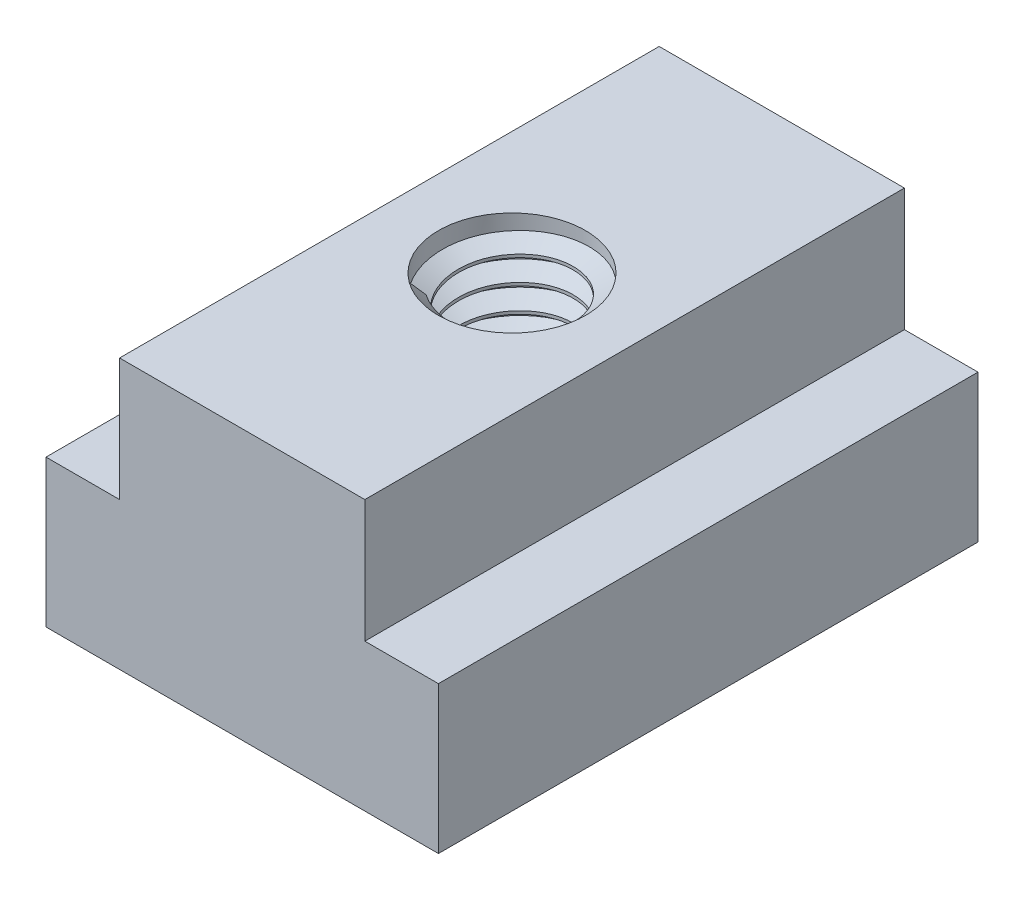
ISO-10303-21;
HEADER;
FILE_DESCRIPTION(('STEP AP214'),'2;1');
FILE_NAME('part.step','',(''),(''),'','','');
FILE_SCHEMA(('AUTOMOTIVE_DESIGN { 1 0 10303 214 1 1 1 1 }'));
ENDSEC;
DATA;
#1=APPLICATION_CONTEXT('core data for automotive mechanical design processes');
#2=APPLICATION_PROTOCOL_DEFINITION('international standard','automotive_design',2000,#1);
#3=PRODUCT_CONTEXT('',#1,'mechanical');
#4=PRODUCT('Part','Part','',(#3));
#5=PRODUCT_RELATED_PRODUCT_CATEGORY('part','',(#4));
#6=PRODUCT_DEFINITION_FORMATION('','',#4);
#7=PRODUCT_DEFINITION_CONTEXT('part definition',#1,'design');
#8=PRODUCT_DEFINITION('design','',#6,#7);
#9=PRODUCT_DEFINITION_SHAPE('','',#8);
#10=(LENGTH_UNIT() NAMED_UNIT(*) SI_UNIT(.MILLI.,.METRE.));
#11=(NAMED_UNIT(*) PLANE_ANGLE_UNIT() SI_UNIT($,.RADIAN.));
#12=(NAMED_UNIT(*) SI_UNIT($,.STERADIAN.) SOLID_ANGLE_UNIT());
#13=UNCERTAINTY_MEASURE_WITH_UNIT(LENGTH_MEASURE(1.E-05),#10,'distance_accuracy_value','');
#14=(GEOMETRIC_REPRESENTATION_CONTEXT(3) GLOBAL_UNCERTAINTY_ASSIGNED_CONTEXT((#13)) GLOBAL_UNIT_ASSIGNED_CONTEXT((#10,
#11,#12)) REPRESENTATION_CONTEXT('',''));
#15=CARTESIAN_POINT('',(0.,0.,0.));
#16=DIRECTION('',(0.,0.,1.));
#17=DIRECTION('',(1.,0.,0.));
#18=AXIS2_PLACEMENT_3D('',#15,#16,#17);
#19=CARTESIAN_POINT('',(0.,-0.374999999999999,2.35048094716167));
#20=CARTESIAN_POINT('',(-1.35705080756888,-0.291666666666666,2.35048094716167));
#21=CARTESIAN_POINT('',(-2.03557621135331,-0.208333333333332,1.17524047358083));
#22=CARTESIAN_POINT('',(-2.71410161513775,-0.124999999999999,0.));
#23=CARTESIAN_POINT('',(-2.03557621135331,-0.041666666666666,-1.17524047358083));
#24=CARTESIAN_POINT('',(-1.35705080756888,0.0416666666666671,-2.35048094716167));
#25=CARTESIAN_POINT('',(0.,0.125,-2.35048094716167));
#26=CARTESIAN_POINT('',(1.35705080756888,0.208333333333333,-2.35048094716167));
#27=CARTESIAN_POINT('',(2.03557621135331,0.291666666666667,-1.17524047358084));
#28=CARTESIAN_POINT('',(2.71410161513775,0.375,0.));
#29=CARTESIAN_POINT('',(2.03557621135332,0.458333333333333,1.17524047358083));
#30=CARTESIAN_POINT('',(1.35705080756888,0.541666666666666,2.35048094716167));
#31=CARTESIAN_POINT('',(0.,0.624999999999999,2.35048094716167));
#32=CARTESIAN_POINT('',(-1.35705080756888,0.708333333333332,2.35048094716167));
#33=CARTESIAN_POINT('',(-2.03557621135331,0.791666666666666,1.17524047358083));
#34=CARTESIAN_POINT('',(-2.71410161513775,0.874999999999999,0.));
#35=CARTESIAN_POINT('',(-2.03557621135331,0.958333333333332,-1.17524047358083));
#36=CARTESIAN_POINT('',(-1.35705080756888,1.04166666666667,-2.35048094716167));
#37=CARTESIAN_POINT('',(0.,1.125,-2.35048094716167));
#38=CARTESIAN_POINT('',(1.35705080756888,1.20833333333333,-2.35048094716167));
#39=CARTESIAN_POINT('',(2.03557621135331,1.29166666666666,-1.17524047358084));
#40=CARTESIAN_POINT('',(2.71410161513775,1.375,0.));
#41=CARTESIAN_POINT('',(2.03557621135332,1.45833333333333,1.17524047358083));
#42=CARTESIAN_POINT('',(1.35705080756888,1.54166666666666,2.35048094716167));
#43=CARTESIAN_POINT('',(0.,1.625,2.35048094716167));
#44=CARTESIAN_POINT('',(-1.35705080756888,1.70833333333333,2.35048094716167));
#45=CARTESIAN_POINT('',(-2.03557621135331,1.79166666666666,1.17524047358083));
#46=CARTESIAN_POINT('',(-2.71410161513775,1.875,0.));
#47=CARTESIAN_POINT('',(-2.03557621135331,1.95833333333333,-1.17524047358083));
#48=CARTESIAN_POINT('',(-1.35705080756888,2.04166666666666,-2.35048094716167));
#49=CARTESIAN_POINT('',(0.,2.125,-2.35048094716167));
#50=CARTESIAN_POINT('',(1.35705080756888,2.20833333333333,-2.35048094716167));
#51=CARTESIAN_POINT('',(2.03557621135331,2.29166666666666,-1.17524047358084));
#52=CARTESIAN_POINT('',(2.71410161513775,2.375,0.));
#53=CARTESIAN_POINT('',(2.03557621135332,2.45833333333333,1.17524047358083));
#54=CARTESIAN_POINT('',(1.35705080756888,2.54166666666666,2.35048094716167));
#55=CARTESIAN_POINT('',(0.,2.625,2.35048094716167));
#56=CARTESIAN_POINT('',(-1.35705080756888,2.70833333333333,2.35048094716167));
#57=CARTESIAN_POINT('',(-2.03557621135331,2.79166666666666,1.17524047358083));
#58=CARTESIAN_POINT('',(-2.71410161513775,2.87499999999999,0.));
#59=CARTESIAN_POINT('',(-2.03557621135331,2.95833333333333,-1.17524047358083));
#60=CARTESIAN_POINT('',(-1.35705080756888,3.04166666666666,-2.35048094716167));
#61=CARTESIAN_POINT('',(0.,3.12499999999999,-2.35048094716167));
#62=CARTESIAN_POINT('',(1.35705080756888,3.20833333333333,-2.35048094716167));
#63=CARTESIAN_POINT('',(2.03557621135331,3.29166666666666,-1.17524047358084));
#64=CARTESIAN_POINT('',(2.71410161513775,3.37499999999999,0.));
#65=CARTESIAN_POINT('',(2.03557621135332,3.45833333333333,1.17524047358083));
#66=CARTESIAN_POINT('',(1.35705080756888,3.54166666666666,2.35048094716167));
#67=CARTESIAN_POINT('',(0.,3.62499999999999,2.35048094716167));
#68=CARTESIAN_POINT('',(-1.35705080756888,3.70833333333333,2.35048094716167));
#69=CARTESIAN_POINT('',(-2.03557621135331,3.79166666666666,1.17524047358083));
#70=CARTESIAN_POINT('',(-2.71410161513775,3.87499999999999,0.));
#71=CARTESIAN_POINT('',(-2.03557621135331,3.95833333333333,-1.17524047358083));
#72=CARTESIAN_POINT('',(-1.35705080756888,4.04166666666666,-2.35048094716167));
#73=CARTESIAN_POINT('',(0.,4.12499999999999,-2.35048094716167));
#74=CARTESIAN_POINT('',(1.35705080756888,4.20833333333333,-2.35048094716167));
#75=CARTESIAN_POINT('',(2.03557621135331,4.29166666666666,-1.17524047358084));
#76=CARTESIAN_POINT('',(2.71410161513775,4.37499999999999,0.));
#77=CARTESIAN_POINT('',(2.03557621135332,4.45833333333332,1.17524047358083));
#78=CARTESIAN_POINT('',(1.35705080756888,4.54166666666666,2.35048094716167));
#79=CARTESIAN_POINT('',(0.,4.62499999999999,2.35048094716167));
#80=CARTESIAN_POINT('',(-1.35705080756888,4.70833333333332,2.35048094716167));
#81=CARTESIAN_POINT('',(-2.03557621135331,4.79166666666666,1.17524047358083));
#82=CARTESIAN_POINT('',(-2.71410161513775,4.87499999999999,0.));
#83=CARTESIAN_POINT('',(-2.03557621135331,4.95833333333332,-1.17524047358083));
#84=CARTESIAN_POINT('',(-1.35705080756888,5.04166666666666,-2.35048094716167));
#85=CARTESIAN_POINT('',(0.,5.12499999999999,-2.35048094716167));
#86=CARTESIAN_POINT('',(1.35705080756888,5.20833333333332,-2.35048094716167));
#87=CARTESIAN_POINT('',(2.03557621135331,5.29166666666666,-1.17524047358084));
#88=CARTESIAN_POINT('',(2.71410161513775,5.37499999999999,0.));
#89=CARTESIAN_POINT('',(2.03557621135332,5.45833333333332,1.17524047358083));
#90=CARTESIAN_POINT('',(1.35705080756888,5.54166666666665,2.35048094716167));
#91=CARTESIAN_POINT('',(0.,5.62499999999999,2.35048094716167));
#92=CARTESIAN_POINT('',(-1.35705080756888,5.70833333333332,2.35048094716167));
#93=CARTESIAN_POINT('',(-2.03557621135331,5.79166666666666,1.17524047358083));
#94=CARTESIAN_POINT('',(-2.71410161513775,5.87499999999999,0.));
#95=CARTESIAN_POINT('',(-2.03557621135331,5.95833333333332,-1.17524047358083));
#96=CARTESIAN_POINT('',(-1.35705080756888,6.04166666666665,-2.35048094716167));
#97=CARTESIAN_POINT('',(0.,6.12499999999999,-2.35048094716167));
#98=CARTESIAN_POINT('',(1.35705080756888,6.20833333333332,-2.35048094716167));
#99=CARTESIAN_POINT('',(2.03557621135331,6.29166666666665,-1.17524047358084));
#100=CARTESIAN_POINT('',(2.71410161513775,6.37499999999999,0.));
#101=CARTESIAN_POINT('',(2.03557621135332,6.45833333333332,1.17524047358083));
#102=CARTESIAN_POINT('',(1.35705080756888,6.54166666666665,2.35048094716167));
#103=CARTESIAN_POINT('',(0.,6.62499999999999,2.35048094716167));
#104=CARTESIAN_POINT('',(-1.35705080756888,6.70833333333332,2.35048094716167));
#105=CARTESIAN_POINT('',(-2.03557621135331,6.79166666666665,1.17524047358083));
#106=CARTESIAN_POINT('',(-2.71410161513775,6.87499999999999,0.));
#107=CARTESIAN_POINT('',(-2.03557621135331,6.95833333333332,-1.17524047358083));
#108=CARTESIAN_POINT('',(-1.35705080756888,7.04166666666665,-2.35048094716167));
#109=CARTESIAN_POINT('',(0.,7.12499999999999,-2.35048094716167));
#110=CARTESIAN_POINT('',(1.35705080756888,7.20833333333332,-2.35048094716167));
#111=CARTESIAN_POINT('',(2.03557621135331,7.29166666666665,-1.17524047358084));
#112=CARTESIAN_POINT('',(2.71410161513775,7.37499999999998,0.));
#113=CARTESIAN_POINT('',(2.03557621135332,7.45833333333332,1.17524047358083));
#114=CARTESIAN_POINT('',(1.35705080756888,7.54166666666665,2.35048094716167));
#115=CARTESIAN_POINT('',(0.,7.62499999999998,2.35048094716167));
#116=CARTESIAN_POINT('',(-1.35705080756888,7.70833333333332,2.35048094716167));
#117=CARTESIAN_POINT('',(-2.03557621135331,7.79166666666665,1.17524047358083));
#118=CARTESIAN_POINT('',(-2.71410161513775,7.87499999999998,0.));
#119=CARTESIAN_POINT('',(-2.03557621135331,7.95833333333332,-1.17524047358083));
#120=CARTESIAN_POINT('',(-1.35705080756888,8.04166666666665,-2.35048094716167));
#121=CARTESIAN_POINT('',(0.,8.12499999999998,-2.35048094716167));
#122=CARTESIAN_POINT('',(1.35705080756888,8.20833333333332,-2.35048094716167));
#123=CARTESIAN_POINT('',(2.03557621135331,8.29166666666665,-1.17524047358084));
#124=CARTESIAN_POINT('',(2.71410161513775,8.37499999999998,0.));
#125=CARTESIAN_POINT('',(2.03557621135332,8.45833333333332,1.17524047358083));
#126=CARTESIAN_POINT('',(1.35705080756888,8.54166666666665,2.35048094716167));
#127=CARTESIAN_POINT('',(0.,8.62499999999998,2.35048094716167));
#128=CARTESIAN_POINT('',(-1.35705080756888,8.70833333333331,2.35048094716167));
#129=CARTESIAN_POINT('',(-2.03557621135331,8.79166666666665,1.17524047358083));
#130=CARTESIAN_POINT('',(-2.71410161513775,8.87499999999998,0.));
#131=CARTESIAN_POINT('',(-2.03557621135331,8.95833333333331,-1.17524047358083));
#132=CARTESIAN_POINT('',(-1.35705080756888,9.04166666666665,-2.35048094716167));
#133=CARTESIAN_POINT('',(0.,9.12499999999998,-2.35048094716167));
#134=CARTESIAN_POINT('',(1.35705080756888,9.20833333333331,-2.35048094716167));
#135=CARTESIAN_POINT('',(2.03557621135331,9.29166666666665,-1.17524047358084));
#136=CARTESIAN_POINT('',(2.71410161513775,9.37499999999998,0.));
#137=CARTESIAN_POINT('',(2.03557621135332,9.45833333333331,1.17524047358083));
#138=CARTESIAN_POINT('',(1.35705080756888,9.54166666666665,2.35048094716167));
#139=CARTESIAN_POINT('',(0.,9.62499999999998,2.35048094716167));
#140=CARTESIAN_POINT('',(-1.35705080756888,9.70833333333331,2.35048094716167));
#141=CARTESIAN_POINT('',(-2.03557621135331,9.79166666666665,1.17524047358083));
#142=CARTESIAN_POINT('',(-2.71410161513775,9.87499999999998,0.));
#143=CARTESIAN_POINT('',(-2.03557621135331,9.95833333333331,-1.17524047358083));
#144=CARTESIAN_POINT('',(-1.35705080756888,10.0416666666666,-2.35048094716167));
#145=CARTESIAN_POINT('',(0.,10.125,-2.35048094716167));
#146=CARTESIAN_POINT('',(1.35705080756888,10.2083333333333,-2.35048094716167));
#147=CARTESIAN_POINT('',(2.03557621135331,10.2916666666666,-1.17524047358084));
#148=CARTESIAN_POINT('',(2.71410161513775,10.375,0.));
#149=CARTESIAN_POINT('',(2.03557621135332,10.4583333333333,1.17524047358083));
#150=CARTESIAN_POINT('',(1.35705080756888,10.5416666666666,2.35048094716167));
#151=CARTESIAN_POINT('',(0.,10.625,2.35048094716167));
#152=CARTESIAN_POINT('',(-1.35705080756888,10.7083333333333,2.35048094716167));
#153=CARTESIAN_POINT('',(-2.03557621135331,10.7916666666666,1.17524047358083));
#154=CARTESIAN_POINT('',(-2.71410161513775,10.875,0.));
#155=CARTESIAN_POINT('',(-2.03557621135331,10.9583333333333,-1.17524047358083));
#156=CARTESIAN_POINT('',(-1.35705080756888,11.0416666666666,-2.35048094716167));
#157=CARTESIAN_POINT('',(0.,11.125,-2.35048094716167));
#158=CARTESIAN_POINT('',(1.35705080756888,11.2083333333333,-2.35048094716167));
#159=CARTESIAN_POINT('',(2.03557621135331,11.2916666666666,-1.17524047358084));
#160=CARTESIAN_POINT('',(2.71410161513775,11.375,0.));
#161=CARTESIAN_POINT('',(2.03557621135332,11.4583333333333,1.17524047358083));
#162=CARTESIAN_POINT('',(1.35705080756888,11.5416666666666,2.35048094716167));
#163=CARTESIAN_POINT('',(0.,11.625,2.35048094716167));
#164=CARTESIAN_POINT('',(0.,0.,3.));
#165=CARTESIAN_POINT('',(-1.73205080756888,0.0833333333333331,3.));
#166=CARTESIAN_POINT('',(-2.59807621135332,0.166666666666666,1.5));
#167=CARTESIAN_POINT('',(-3.46410161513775,0.249999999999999,0.));
#168=CARTESIAN_POINT('',(-2.59807621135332,0.333333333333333,-1.5));
#169=CARTESIAN_POINT('',(-1.73205080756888,0.416666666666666,-3.));
#170=CARTESIAN_POINT('',(0.,0.499999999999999,-3.));
#171=CARTESIAN_POINT('',(1.73205080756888,0.583333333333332,-3.));
#172=CARTESIAN_POINT('',(2.59807621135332,0.666666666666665,-1.5));
#173=CARTESIAN_POINT('',(3.46410161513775,0.749999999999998,0.));
#174=CARTESIAN_POINT('',(2.59807621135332,0.833333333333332,1.5));
#175=CARTESIAN_POINT('',(1.73205080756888,0.916666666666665,3.));
#176=CARTESIAN_POINT('',(0.,0.999999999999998,3.));
#177=CARTESIAN_POINT('',(-1.73205080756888,1.08333333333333,3.));
#178=CARTESIAN_POINT('',(-2.59807621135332,1.16666666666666,1.5));
#179=CARTESIAN_POINT('',(-3.46410161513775,1.25,0.));
#180=CARTESIAN_POINT('',(-2.59807621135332,1.33333333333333,-1.5));
#181=CARTESIAN_POINT('',(-1.73205080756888,1.41666666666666,-3.));
#182=CARTESIAN_POINT('',(0.,1.5,-3.));
#183=CARTESIAN_POINT('',(1.73205080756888,1.58333333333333,-3.));
#184=CARTESIAN_POINT('',(2.59807621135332,1.66666666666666,-1.5));
#185=CARTESIAN_POINT('',(3.46410161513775,1.75,0.));
#186=CARTESIAN_POINT('',(2.59807621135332,1.83333333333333,1.5));
#187=CARTESIAN_POINT('',(1.73205080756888,1.91666666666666,3.));
#188=CARTESIAN_POINT('',(0.,2.,3.));
#189=CARTESIAN_POINT('',(-1.73205080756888,2.08333333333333,3.));
#190=CARTESIAN_POINT('',(-2.59807621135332,2.16666666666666,1.5));
#191=CARTESIAN_POINT('',(-3.46410161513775,2.25,0.));
#192=CARTESIAN_POINT('',(-2.59807621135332,2.33333333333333,-1.5));
#193=CARTESIAN_POINT('',(-1.73205080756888,2.41666666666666,-3.));
#194=CARTESIAN_POINT('',(0.,2.49999999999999,-3.));
#195=CARTESIAN_POINT('',(1.73205080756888,2.58333333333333,-3.));
#196=CARTESIAN_POINT('',(2.59807621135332,2.66666666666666,-1.5));
#197=CARTESIAN_POINT('',(3.46410161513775,2.74999999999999,0.));
#198=CARTESIAN_POINT('',(2.59807621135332,2.83333333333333,1.5));
#199=CARTESIAN_POINT('',(1.73205080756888,2.91666666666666,3.));
#200=CARTESIAN_POINT('',(0.,2.99999999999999,3.));
#201=CARTESIAN_POINT('',(-1.73205080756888,3.08333333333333,3.));
#202=CARTESIAN_POINT('',(-2.59807621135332,3.16666666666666,1.5));
#203=CARTESIAN_POINT('',(-3.46410161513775,3.24999999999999,0.));
#204=CARTESIAN_POINT('',(-2.59807621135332,3.33333333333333,-1.5));
#205=CARTESIAN_POINT('',(-1.73205080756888,3.41666666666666,-3.));
#206=CARTESIAN_POINT('',(0.,3.49999999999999,-3.));
#207=CARTESIAN_POINT('',(1.73205080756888,3.58333333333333,-3.));
#208=CARTESIAN_POINT('',(2.59807621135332,3.66666666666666,-1.5));
#209=CARTESIAN_POINT('',(3.46410161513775,3.74999999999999,0.));
#210=CARTESIAN_POINT('',(2.59807621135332,3.83333333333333,1.5));
#211=CARTESIAN_POINT('',(1.73205080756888,3.91666666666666,3.));
#212=CARTESIAN_POINT('',(0.,3.99999999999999,3.));
#213=CARTESIAN_POINT('',(-1.73205080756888,4.08333333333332,3.));
#214=CARTESIAN_POINT('',(-2.59807621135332,4.16666666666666,1.5));
#215=CARTESIAN_POINT('',(-3.46410161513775,4.24999999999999,0.));
#216=CARTESIAN_POINT('',(-2.59807621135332,4.33333333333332,-1.5));
#217=CARTESIAN_POINT('',(-1.73205080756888,4.41666666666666,-3.));
#218=CARTESIAN_POINT('',(0.,4.49999999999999,-3.));
#219=CARTESIAN_POINT('',(1.73205080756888,4.58333333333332,-3.));
#220=CARTESIAN_POINT('',(2.59807621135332,4.66666666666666,-1.5));
#221=CARTESIAN_POINT('',(3.46410161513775,4.74999999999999,0.));
#222=CARTESIAN_POINT('',(2.59807621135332,4.83333333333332,1.5));
#223=CARTESIAN_POINT('',(1.73205080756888,4.91666666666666,3.));
#224=CARTESIAN_POINT('',(0.,4.99999999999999,3.));
#225=CARTESIAN_POINT('',(-1.73205080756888,5.08333333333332,3.));
#226=CARTESIAN_POINT('',(-2.59807621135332,5.16666666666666,1.5));
#227=CARTESIAN_POINT('',(-3.46410161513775,5.24999999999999,0.));
#228=CARTESIAN_POINT('',(-2.59807621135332,5.33333333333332,-1.5));
#229=CARTESIAN_POINT('',(-1.73205080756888,5.41666666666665,-3.));
#230=CARTESIAN_POINT('',(0.,5.49999999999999,-3.));
#231=CARTESIAN_POINT('',(1.73205080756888,5.58333333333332,-3.));
#232=CARTESIAN_POINT('',(2.59807621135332,5.66666666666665,-1.5));
#233=CARTESIAN_POINT('',(3.46410161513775,5.74999999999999,0.));
#234=CARTESIAN_POINT('',(2.59807621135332,5.83333333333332,1.5));
#235=CARTESIAN_POINT('',(1.73205080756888,5.91666666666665,3.));
#236=CARTESIAN_POINT('',(0.,5.99999999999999,3.));
#237=CARTESIAN_POINT('',(-1.73205080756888,6.08333333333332,3.));
#238=CARTESIAN_POINT('',(-2.59807621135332,6.16666666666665,1.5));
#239=CARTESIAN_POINT('',(-3.46410161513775,6.24999999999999,0.));
#240=CARTESIAN_POINT('',(-2.59807621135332,6.33333333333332,-1.5));
#241=CARTESIAN_POINT('',(-1.73205080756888,6.41666666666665,-3.));
#242=CARTESIAN_POINT('',(0.,6.49999999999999,-3.));
#243=CARTESIAN_POINT('',(1.73205080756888,6.58333333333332,-3.));
#244=CARTESIAN_POINT('',(2.59807621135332,6.66666666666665,-1.5));
#245=CARTESIAN_POINT('',(3.46410161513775,6.74999999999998,0.));
#246=CARTESIAN_POINT('',(2.59807621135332,6.83333333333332,1.5));
#247=CARTESIAN_POINT('',(1.73205080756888,6.91666666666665,3.));
#248=CARTESIAN_POINT('',(0.,6.99999999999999,3.));
#249=CARTESIAN_POINT('',(-1.73205080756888,7.08333333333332,3.));
#250=CARTESIAN_POINT('',(-2.59807621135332,7.16666666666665,1.5));
#251=CARTESIAN_POINT('',(-3.46410161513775,7.24999999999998,0.));
#252=CARTESIAN_POINT('',(-2.59807621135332,7.33333333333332,-1.5));
#253=CARTESIAN_POINT('',(-1.73205080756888,7.41666666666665,-3.));
#254=CARTESIAN_POINT('',(0.,7.49999999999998,-3.));
#255=CARTESIAN_POINT('',(1.73205080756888,7.58333333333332,-3.));
#256=CARTESIAN_POINT('',(2.59807621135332,7.66666666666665,-1.5));
#257=CARTESIAN_POINT('',(3.46410161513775,7.74999999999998,0.));
#258=CARTESIAN_POINT('',(2.59807621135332,7.83333333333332,1.5));
#259=CARTESIAN_POINT('',(1.73205080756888,7.91666666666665,3.));
#260=CARTESIAN_POINT('',(0.,7.99999999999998,3.));
#261=CARTESIAN_POINT('',(-1.73205080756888,8.08333333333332,3.));
#262=CARTESIAN_POINT('',(-2.59807621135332,8.16666666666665,1.5));
#263=CARTESIAN_POINT('',(-3.46410161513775,8.24999999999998,0.));
#264=CARTESIAN_POINT('',(-2.59807621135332,8.33333333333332,-1.5));
#265=CARTESIAN_POINT('',(-1.73205080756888,8.41666666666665,-3.));
#266=CARTESIAN_POINT('',(0.,8.49999999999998,-3.));
#267=CARTESIAN_POINT('',(1.73205080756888,8.58333333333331,-3.));
#268=CARTESIAN_POINT('',(2.59807621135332,8.66666666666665,-1.5));
#269=CARTESIAN_POINT('',(3.46410161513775,8.74999999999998,0.));
#270=CARTESIAN_POINT('',(2.59807621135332,8.83333333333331,1.5));
#271=CARTESIAN_POINT('',(1.73205080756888,8.91666666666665,3.));
#272=CARTESIAN_POINT('',(0.,8.99999999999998,3.));
#273=CARTESIAN_POINT('',(-1.73205080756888,9.08333333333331,3.));
#274=CARTESIAN_POINT('',(-2.59807621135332,9.16666666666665,1.5));
#275=CARTESIAN_POINT('',(-3.46410161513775,9.24999999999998,0.));
#276=CARTESIAN_POINT('',(-2.59807621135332,9.33333333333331,-1.5));
#277=CARTESIAN_POINT('',(-1.73205080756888,9.41666666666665,-3.));
#278=CARTESIAN_POINT('',(0.,9.49999999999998,-3.));
#279=CARTESIAN_POINT('',(1.73205080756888,9.58333333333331,-3.));
#280=CARTESIAN_POINT('',(2.59807621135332,9.66666666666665,-1.5));
#281=CARTESIAN_POINT('',(3.46410161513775,9.74999999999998,0.));
#282=CARTESIAN_POINT('',(2.59807621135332,9.83333333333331,1.5));
#283=CARTESIAN_POINT('',(1.73205080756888,9.91666666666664,3.));
#284=CARTESIAN_POINT('',(0.,9.99999999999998,3.));
#285=CARTESIAN_POINT('',(-1.73205080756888,10.0833333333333,3.));
#286=CARTESIAN_POINT('',(-2.59807621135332,10.1666666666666,1.5));
#287=CARTESIAN_POINT('',(-3.46410161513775,10.25,0.));
#288=CARTESIAN_POINT('',(-2.59807621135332,10.3333333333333,-1.5));
#289=CARTESIAN_POINT('',(-1.73205080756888,10.4166666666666,-3.));
#290=CARTESIAN_POINT('',(0.,10.5,-3.));
#291=CARTESIAN_POINT('',(1.73205080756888,10.5833333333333,-3.));
#292=CARTESIAN_POINT('',(2.59807621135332,10.6666666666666,-1.5));
#293=CARTESIAN_POINT('',(3.46410161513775,10.75,0.));
#294=CARTESIAN_POINT('',(2.59807621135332,10.8333333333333,1.5));
#295=CARTESIAN_POINT('',(1.73205080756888,10.9166666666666,3.));
#296=CARTESIAN_POINT('',(0.,11.,3.));
#297=CARTESIAN_POINT('',(-1.73205080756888,11.0833333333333,3.));
#298=CARTESIAN_POINT('',(-2.59807621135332,11.1666666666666,1.5));
#299=CARTESIAN_POINT('',(-3.46410161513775,11.25,0.));
#300=CARTESIAN_POINT('',(-2.59807621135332,11.3333333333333,-1.5));
#301=CARTESIAN_POINT('',(-1.73205080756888,11.4166666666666,-3.));
#302=CARTESIAN_POINT('',(0.,11.5,-3.));
#303=CARTESIAN_POINT('',(1.73205080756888,11.5833333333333,-3.));
#304=CARTESIAN_POINT('',(2.59807621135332,11.6666666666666,-1.5));
#305=CARTESIAN_POINT('',(3.46410161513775,11.75,0.));
#306=CARTESIAN_POINT('',(2.59807621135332,11.8333333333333,1.5));
#307=CARTESIAN_POINT('',(1.73205080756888,11.9166666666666,3.));
#308=CARTESIAN_POINT('',(0.,12.,3.));
#309=(BOUNDED_SURFACE() B_SPLINE_SURFACE(1,2,((#19,#20,#21,#22,#23,#24,#25,#26,#27,#28,#29,#30,
#31,#32,#33,#34,#35,#36,#37,#38,#39,#40,#41,#42,#43,#44,#45,#46,#47,#48,#49,#50,#51,#52,#53,#54,
#55,#56,#57,#58,#59,#60,#61,#62,#63,#64,#65,#66,#67,#68,#69,#70,#71,#72,#73,#74,#75,#76,#77,#78,
#79,#80,#81,#82,#83,#84,#85,#86,#87,#88,#89,#90,#91,#92,#93,#94,#95,#96,#97,#98,#99,#100,#101,
#102,#103,#104,#105,#106,#107,#108,#109,#110,#111,#112,#113,#114,#115,#116,#117,#118,#119,#120,
#121,#122,#123,#124,#125,#126,#127,#128,#129,#130,#131,#132,#133,#134,#135,#136,#137,#138,#139,
#140,#141,#142,#143,#144,#145,#146,#147,#148,#149,#150,#151,#152,#153,#154,#155,#156,#157,#158,
#159,#160,#161,#162,#163),(#164,#165,#166,#167,#168,#169,#170,#171,#172,#173,#174,#175,#176,
#177,#178,#179,#180,#181,#182,#183,#184,#185,#186,#187,#188,#189,#190,#191,#192,#193,#194,#195,
#196,#197,#198,#199,#200,#201,#202,#203,#204,#205,#206,#207,#208,#209,#210,#211,#212,#213,#214,
#215,#216,#217,#218,#219,#220,#221,#222,#223,#224,#225,#226,#227,#228,#229,#230,#231,#232,#233,
#234,#235,#236,#237,#238,#239,#240,#241,#242,#243,#244,#245,#246,#247,#248,#249,#250,#251,#252,
#253,#254,#255,#256,#257,#258,#259,#260,#261,#262,#263,#264,#265,#266,#267,#268,#269,#270,#271,
#272,#273,#274,#275,#276,#277,#278,#279,#280,#281,#282,#283,#284,#285,#286,#287,#288,#289,#290,
#291,#292,#293,#294,#295,#296,#297,#298,#299,#300,#301,#302,#303,#304,#305,#306,#307,#308)),
.UNSPECIFIED.,.F.,.F.,.F.) B_SPLINE_SURFACE_WITH_KNOTS((2,2),(3,2,2,2,2,2,2,2,2,2,2,2,2,2,2,2,2,
2,2,2,2,2,2,2,2,2,2,2,2,2,2,2,2,2,2,2,2,2,2,2,2,2,2,2,2,2,2,2,2,2,2,2,2,2,2,2,2,2,2,2,2,2,2,2,2,
2,2,2,2,2,2,2,3),(0.,1.),(0.,0.0138888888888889,0.0277777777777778,0.0416666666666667,
0.0555555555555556,0.0694444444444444,0.0833333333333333,0.0972222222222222,0.111111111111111,
0.125,0.138888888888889,0.152777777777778,0.166666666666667,0.180555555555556,0.194444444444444,
0.208333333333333,0.222222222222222,0.236111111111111,0.25,0.263888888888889,0.277777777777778,
0.291666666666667,0.305555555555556,0.319444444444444,0.333333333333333,0.347222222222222,
0.361111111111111,0.375,0.388888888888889,0.402777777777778,0.416666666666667,0.430555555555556,
0.444444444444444,0.458333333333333,0.472222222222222,0.486111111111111,0.5,0.513888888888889,
0.527777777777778,0.541666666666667,0.555555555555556,0.569444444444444,0.583333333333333,
0.597222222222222,0.611111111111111,0.625,0.638888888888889,0.652777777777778,0.666666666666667,
0.680555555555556,0.694444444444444,0.708333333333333,0.722222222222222,0.736111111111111,0.75,
0.763888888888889,0.777777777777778,0.791666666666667,0.805555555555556,0.819444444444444,
0.833333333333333,0.847222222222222,0.861111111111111,0.875,0.888888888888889,0.902777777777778,
0.916666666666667,0.930555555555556,0.944444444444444,0.958333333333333,0.972222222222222,
0.986111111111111,1.),
.UNSPECIFIED.) GEOMETRIC_REPRESENTATION_ITEM() RATIONAL_B_SPLINE_SURFACE(((1.,0.866025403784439,
1.,0.866025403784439,1.,0.866025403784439,1.,0.866025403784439,1.,0.866025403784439,1.,
0.866025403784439,1.,0.866025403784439,1.,0.866025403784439,1.,0.866025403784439,1.,
0.866025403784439,1.,0.866025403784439,1.,0.866025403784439,1.,0.866025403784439,1.,
0.866025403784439,1.,0.866025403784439,1.,0.866025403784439,1.,0.866025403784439,1.,
0.866025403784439,1.,0.866025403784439,1.,0.866025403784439,1.,0.866025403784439,1.,
0.866025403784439,1.,0.866025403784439,1.,0.866025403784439,1.,0.866025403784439,1.,
0.866025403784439,1.,0.866025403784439,1.,0.866025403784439,1.,0.866025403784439,1.,
0.866025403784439,1.,0.866025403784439,1.,0.866025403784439,1.,0.866025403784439,1.,
0.866025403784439,1.,0.866025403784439,1.,0.866025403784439,1.,0.866025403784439,1.,
0.866025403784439,1.,0.866025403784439,1.,0.866025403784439,1.,0.866025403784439,1.,
0.866025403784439,1.,0.866025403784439,1.,0.866025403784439,1.,0.866025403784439,1.,
0.866025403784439,1.,0.866025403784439,1.,0.866025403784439,1.,0.866025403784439,1.,
0.866025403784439,1.,0.866025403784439,1.,0.866025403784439,1.,0.866025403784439,1.,
0.866025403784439,1.,0.866025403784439,1.,0.866025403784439,1.,0.866025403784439,1.,
0.866025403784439,1.,0.866025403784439,1.,0.866025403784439,1.,0.866025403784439,1.,
0.866025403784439,1.,0.866025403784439,1.,0.866025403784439,1.,0.866025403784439,1.,
0.866025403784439,1.,0.866025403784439,1.,0.866025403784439,1.,0.866025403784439,1.,
0.866025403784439,1.,0.866025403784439,1.,0.866025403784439,1.),(1.,0.866025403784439,1.,
0.866025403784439,1.,0.866025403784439,1.,0.866025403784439,1.,0.866025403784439,1.,
0.866025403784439,1.,0.866025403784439,1.,0.866025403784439,1.,0.866025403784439,1.,
0.866025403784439,1.,0.866025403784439,1.,0.866025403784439,1.,0.866025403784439,1.,
0.866025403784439,1.,0.866025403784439,1.,0.866025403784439,1.,0.866025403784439,1.,
0.866025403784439,1.,0.866025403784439,1.,0.866025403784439,1.,0.866025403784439,1.,
0.866025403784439,1.,0.866025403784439,1.,0.866025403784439,1.,0.866025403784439,1.,
0.866025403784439,1.,0.866025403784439,1.,0.866025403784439,1.,0.866025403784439,1.,
0.866025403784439,1.,0.866025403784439,1.,0.866025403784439,1.,0.866025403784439,1.,
0.866025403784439,1.,0.866025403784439,1.,0.866025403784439,1.,0.866025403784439,1.,
0.866025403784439,1.,0.866025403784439,1.,0.866025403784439,1.,0.866025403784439,1.,
0.866025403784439,1.,0.866025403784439,1.,0.866025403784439,1.,0.866025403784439,1.,
0.866025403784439,1.,0.866025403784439,1.,0.866025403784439,1.,0.866025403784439,1.,
0.866025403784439,1.,0.866025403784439,1.,0.866025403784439,1.,0.866025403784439,1.,
0.866025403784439,1.,0.866025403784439,1.,0.866025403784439,1.,0.866025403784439,1.,
0.866025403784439,1.,0.866025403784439,1.,0.866025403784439,1.,0.866025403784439,1.,
0.866025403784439,1.,0.866025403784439,1.,0.866025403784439,1.,0.866025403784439,1.,
0.866025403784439,1.,0.866025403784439,1.,0.866025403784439,1.,0.866025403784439,1.,
0.866025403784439,1.,0.866025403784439,1.,0.866025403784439,1.))) REPRESENTATION_ITEM('') SURFACE());
#310=CARTESIAN_POINT('',(0.,-0.374999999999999,2.35048094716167));
#311=CARTESIAN_POINT('',(-1.35705080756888,-0.291666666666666,2.35048094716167));
#312=CARTESIAN_POINT('',(-2.03557621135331,-0.208333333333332,1.17524047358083));
#313=CARTESIAN_POINT('',(-2.71410161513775,-0.124999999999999,0.));
#314=CARTESIAN_POINT('',(-2.03557621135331,-0.041666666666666,-1.17524047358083));
#315=CARTESIAN_POINT('',(-1.35705080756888,0.0416666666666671,-2.35048094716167));
#316=CARTESIAN_POINT('',(0.,0.125,-2.35048094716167));
#317=CARTESIAN_POINT('',(1.35705080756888,0.208333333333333,-2.35048094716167));
#318=CARTESIAN_POINT('',(2.03557621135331,0.291666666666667,-1.17524047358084));
#319=CARTESIAN_POINT('',(2.71410161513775,0.375,0.));
#320=CARTESIAN_POINT('',(2.03557621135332,0.458333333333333,1.17524047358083));
#321=CARTESIAN_POINT('',(1.35705080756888,0.541666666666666,2.35048094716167));
#322=CARTESIAN_POINT('',(0.,0.624999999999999,2.35048094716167));
#323=CARTESIAN_POINT('',(-1.35705080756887,0.708333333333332,2.35048094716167));
#324=CARTESIAN_POINT('',(-2.03557621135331,0.791666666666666,1.17524047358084));
#325=CARTESIAN_POINT('',(-2.71410161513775,0.874999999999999,0.));
#326=CARTESIAN_POINT('',(-2.03557621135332,0.958333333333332,-1.17524047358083));
#327=CARTESIAN_POINT('',(-1.35705080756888,1.04166666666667,-2.35048094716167));
#328=CARTESIAN_POINT('',(0.,1.125,-2.35048094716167));
#329=CARTESIAN_POINT('',(1.35705080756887,1.20833333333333,-2.35048094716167));
#330=CARTESIAN_POINT('',(2.03557621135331,1.29166666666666,-1.17524047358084));
#331=CARTESIAN_POINT('',(2.71410161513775,1.375,0.));
#332=CARTESIAN_POINT('',(2.03557621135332,1.45833333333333,1.17524047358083));
#333=CARTESIAN_POINT('',(1.35705080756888,1.54166666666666,2.35048094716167));
#334=CARTESIAN_POINT('',(0.,1.625,2.35048094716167));
#335=CARTESIAN_POINT('',(-1.35705080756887,1.70833333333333,2.35048094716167));
#336=CARTESIAN_POINT('',(-2.03557621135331,1.79166666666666,1.17524047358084));
#337=CARTESIAN_POINT('',(-2.71410161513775,1.875,0.));
#338=CARTESIAN_POINT('',(-2.03557621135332,1.95833333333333,-1.17524047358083));
#339=CARTESIAN_POINT('',(-1.35705080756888,2.04166666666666,-2.35048094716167));
#340=CARTESIAN_POINT('',(0.,2.125,-2.35048094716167));
#341=CARTESIAN_POINT('',(1.35705080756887,2.20833333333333,-2.35048094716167));
#342=CARTESIAN_POINT('',(2.03557621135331,2.29166666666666,-1.17524047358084));
#343=CARTESIAN_POINT('',(2.71410161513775,2.375,0.));
#344=CARTESIAN_POINT('',(2.03557621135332,2.45833333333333,1.17524047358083));
#345=CARTESIAN_POINT('',(1.35705080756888,2.54166666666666,2.35048094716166));
#346=CARTESIAN_POINT('',(0.,2.625,2.35048094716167));
#347=CARTESIAN_POINT('',(-1.35705080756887,2.70833333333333,2.35048094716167));
#348=CARTESIAN_POINT('',(-2.03557621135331,2.79166666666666,1.17524047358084));
#349=CARTESIAN_POINT('',(-2.71410161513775,2.87499999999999,0.));
#350=CARTESIAN_POINT('',(-2.03557621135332,2.95833333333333,-1.17524047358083));
#351=CARTESIAN_POINT('',(-1.35705080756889,3.04166666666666,-2.35048094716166));
#352=CARTESIAN_POINT('',(0.,3.12499999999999,-2.35048094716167));
#353=CARTESIAN_POINT('',(1.35705080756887,3.20833333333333,-2.35048094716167));
#354=CARTESIAN_POINT('',(2.03557621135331,3.29166666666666,-1.17524047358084));
#355=CARTESIAN_POINT('',(2.71410161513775,3.37499999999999,0.));
#356=CARTESIAN_POINT('',(2.03557621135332,3.45833333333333,1.17524047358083));
#357=CARTESIAN_POINT('',(1.35705080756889,3.54166666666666,2.35048094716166));
#358=CARTESIAN_POINT('',(0.,3.62499999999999,2.35048094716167));
#359=CARTESIAN_POINT('',(-1.35705080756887,3.70833333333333,2.35048094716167));
#360=CARTESIAN_POINT('',(-2.03557621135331,3.79166666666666,1.17524047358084));
#361=CARTESIAN_POINT('',(-2.71410161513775,3.87499999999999,0.));
#362=CARTESIAN_POINT('',(-2.03557621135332,3.95833333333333,-1.17524047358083));
#363=CARTESIAN_POINT('',(-1.35705080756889,4.04166666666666,-2.35048094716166));
#364=CARTESIAN_POINT('',(0.,4.12499999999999,-2.35048094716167));
#365=CARTESIAN_POINT('',(1.35705080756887,4.20833333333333,-2.35048094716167));
#366=CARTESIAN_POINT('',(2.03557621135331,4.29166666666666,-1.17524047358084));
#367=CARTESIAN_POINT('',(2.71410161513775,4.37499999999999,0.));
#368=CARTESIAN_POINT('',(2.03557621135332,4.45833333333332,1.17524047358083));
#369=CARTESIAN_POINT('',(1.35705080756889,4.54166666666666,2.35048094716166));
#370=CARTESIAN_POINT('',(0.,4.62499999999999,2.35048094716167));
#371=CARTESIAN_POINT('',(-1.35705080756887,4.70833333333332,2.35048094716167));
#372=CARTESIAN_POINT('',(-2.03557621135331,4.79166666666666,1.17524047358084));
#373=CARTESIAN_POINT('',(-2.71410161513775,4.87499999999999,0.));
#374=CARTESIAN_POINT('',(-2.03557621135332,4.95833333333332,-1.17524047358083));
#375=CARTESIAN_POINT('',(-1.35705080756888,5.04166666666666,-2.35048094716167));
#376=CARTESIAN_POINT('',(0.,5.12499999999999,-2.35048094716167));
#377=CARTESIAN_POINT('',(1.35705080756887,5.20833333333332,-2.35048094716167));
#378=CARTESIAN_POINT('',(2.03557621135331,5.29166666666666,-1.17524047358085));
#379=CARTESIAN_POINT('',(2.71410161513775,5.37499999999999,0.));
#380=CARTESIAN_POINT('',(2.03557621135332,5.45833333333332,1.17524047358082));
#381=CARTESIAN_POINT('',(1.35705080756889,5.54166666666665,2.35048094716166));
#382=CARTESIAN_POINT('',(0.,5.62499999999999,2.35048094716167));
#383=CARTESIAN_POINT('',(-1.35705080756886,5.70833333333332,2.35048094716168));
#384=CARTESIAN_POINT('',(-2.03557621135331,5.79166666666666,1.17524047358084));
#385=CARTESIAN_POINT('',(-2.71410161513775,5.87499999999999,0.));
#386=CARTESIAN_POINT('',(-2.03557621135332,5.95833333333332,-1.17524047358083));
#387=CARTESIAN_POINT('',(-1.35705080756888,6.04166666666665,-2.35048094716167));
#388=CARTESIAN_POINT('',(0.,6.12499999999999,-2.35048094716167));
#389=CARTESIAN_POINT('',(1.35705080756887,6.20833333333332,-2.35048094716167));
#390=CARTESIAN_POINT('',(2.03557621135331,6.29166666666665,-1.17524047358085));
#391=CARTESIAN_POINT('',(2.71410161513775,6.37499999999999,0.));
#392=CARTESIAN_POINT('',(2.03557621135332,6.45833333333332,1.17524047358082));
#393=CARTESIAN_POINT('',(1.35705080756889,6.54166666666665,2.35048094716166));
#394=CARTESIAN_POINT('',(0.,6.62499999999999,2.35048094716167));
#395=CARTESIAN_POINT('',(-1.35705080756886,6.70833333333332,2.35048094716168));
#396=CARTESIAN_POINT('',(-2.03557621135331,6.79166666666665,1.17524047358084));
#397=CARTESIAN_POINT('',(-2.71410161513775,6.87499999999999,0.));
#398=CARTESIAN_POINT('',(-2.03557621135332,6.95833333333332,-1.17524047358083));
#399=CARTESIAN_POINT('',(-1.3570508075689,7.04166666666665,-2.35048094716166));
#400=CARTESIAN_POINT('',(0.,7.12499999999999,-2.35048094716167));
#401=CARTESIAN_POINT('',(1.35705080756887,7.20833333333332,-2.35048094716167));
#402=CARTESIAN_POINT('',(2.03557621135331,7.29166666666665,-1.17524047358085));
#403=CARTESIAN_POINT('',(2.71410161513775,7.37499999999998,0.));
#404=CARTESIAN_POINT('',(2.03557621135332,7.45833333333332,1.17524047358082));
#405=CARTESIAN_POINT('',(1.35705080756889,7.54166666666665,2.35048094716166));
#406=CARTESIAN_POINT('',(0.,7.62499999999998,2.35048094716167));
#407=CARTESIAN_POINT('',(-1.35705080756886,7.70833333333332,2.35048094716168));
#408=CARTESIAN_POINT('',(-2.03557621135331,7.79166666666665,1.17524047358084));
#409=CARTESIAN_POINT('',(-2.71410161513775,7.87499999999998,0.));
#410=CARTESIAN_POINT('',(-2.03557621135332,7.95833333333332,-1.17524047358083));
#411=CARTESIAN_POINT('',(-1.3570508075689,8.04166666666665,-2.35048094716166));
#412=CARTESIAN_POINT('',(0.,8.12499999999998,-2.35048094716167));
#413=CARTESIAN_POINT('',(1.35705080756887,8.20833333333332,-2.35048094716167));
#414=CARTESIAN_POINT('',(2.03557621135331,8.29166666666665,-1.17524047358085));
#415=CARTESIAN_POINT('',(2.71410161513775,8.37499999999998,0.));
#416=CARTESIAN_POINT('',(2.03557621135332,8.45833333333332,1.17524047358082));
#417=CARTESIAN_POINT('',(1.35705080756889,8.54166666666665,2.35048094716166));
#418=CARTESIAN_POINT('',(0.,8.62499999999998,2.35048094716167));
#419=CARTESIAN_POINT('',(-1.35705080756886,8.70833333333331,2.35048094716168));
#420=CARTESIAN_POINT('',(-2.03557621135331,8.79166666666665,1.17524047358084));
#421=CARTESIAN_POINT('',(-2.71410161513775,8.87499999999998,0.));
#422=CARTESIAN_POINT('',(-2.03557621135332,8.95833333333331,-1.17524047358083));
#423=CARTESIAN_POINT('',(-1.3570508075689,9.04166666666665,-2.35048094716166));
#424=CARTESIAN_POINT('',(0.,9.12499999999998,-2.35048094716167));
#425=CARTESIAN_POINT('',(1.35705080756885,9.20833333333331,-2.35048094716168));
#426=CARTESIAN_POINT('',(2.03557621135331,9.29166666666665,-1.17524047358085));
#427=CARTESIAN_POINT('',(2.71410161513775,9.37499999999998,0.));
#428=CARTESIAN_POINT('',(2.03557621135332,9.45833333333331,1.17524047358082));
#429=CARTESIAN_POINT('',(1.35705080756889,9.54166666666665,2.35048094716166));
#430=CARTESIAN_POINT('',(0.,9.62499999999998,2.35048094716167));
#431=CARTESIAN_POINT('',(-1.35705080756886,9.70833333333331,2.35048094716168));
#432=CARTESIAN_POINT('',(-2.03557621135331,9.79166666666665,1.17524047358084));
#433=CARTESIAN_POINT('',(-2.71410161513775,9.87499999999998,0.));
#434=CARTESIAN_POINT('',(-2.03557621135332,9.95833333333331,-1.17524047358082));
#435=CARTESIAN_POINT('',(-1.35705080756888,10.0416666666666,-2.35048094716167));
#436=CARTESIAN_POINT('',(0.,10.125,-2.35048094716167));
#437=CARTESIAN_POINT('',(1.35705080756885,10.2083333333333,-2.35048094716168));
#438=CARTESIAN_POINT('',(2.03557621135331,10.2916666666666,-1.17524047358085));
#439=CARTESIAN_POINT('',(2.71410161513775,10.375,0.));
#440=CARTESIAN_POINT('',(2.03557621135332,10.4583333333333,1.17524047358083));
#441=CARTESIAN_POINT('',(1.35705080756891,10.5416666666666,2.35048094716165));
#442=CARTESIAN_POINT('',(0.,10.625,2.35048094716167));
#443=CARTESIAN_POINT('',(-1.35705080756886,10.7083333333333,2.35048094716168));
#444=CARTESIAN_POINT('',(-2.03557621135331,10.7916666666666,1.17524047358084));
#445=CARTESIAN_POINT('',(-2.71410161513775,10.875,0.));
#446=CARTESIAN_POINT('',(-2.03557621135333,10.9583333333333,-1.17524047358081));
#447=CARTESIAN_POINT('',(-1.3570508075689,11.0416666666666,-2.35048094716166));
#448=CARTESIAN_POINT('',(0.,11.125,-2.35048094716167));
#449=CARTESIAN_POINT('',(1.35705080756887,11.2083333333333,-2.35048094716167));
#450=CARTESIAN_POINT('',(2.0355762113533,11.2916666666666,-1.17524047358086));
#451=CARTESIAN_POINT('',(2.71410161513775,11.375,0.));
#452=CARTESIAN_POINT('',(2.03557621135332,11.4583333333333,1.17524047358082));
#453=CARTESIAN_POINT('',(1.35705080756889,11.5416666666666,2.35048094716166));
#454=CARTESIAN_POINT('',(0.,11.625,2.35048094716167));
#455=(BOUNDED_CURVE() B_SPLINE_CURVE(2,(#310,#311,#312,#313,#314,#315,#316,#317,#318,#319,#320,
#321,#322,#323,#324,#325,#326,#327,#328,#329,#330,#331,#332,#333,#334,#335,#336,#337,#338,#339,
#340,#341,#342,#343,#344,#345,#346,#347,#348,#349,#350,#351,#352,#353,#354,#355,#356,#357,#358,
#359,#360,#361,#362,#363,#364,#365,#366,#367,#368,#369,#370,#371,#372,#373,#374,#375,#376,#377,
#378,#379,#380,#381,#382,#383,#384,#385,#386,#387,#388,#389,#390,#391,#392,#393,#394,#395,#396,
#397,#398,#399,#400,#401,#402,#403,#404,#405,#406,#407,#408,#409,#410,#411,#412,#413,#414,#415,
#416,#417,#418,#419,#420,#421,#422,#423,#424,#425,#426,#427,#428,#429,#430,#431,#432,#433,#434,
#435,#436,#437,#438,#439,#440,#441,#442,#443,#444,#445,#446,#447,#448,#449,#450,#451,#452,#453,
#454),.UNSPECIFIED.,.F.,.F.) B_SPLINE_CURVE_WITH_KNOTS((3,2,2,2,2,2,2,2,2,2,2,2,2,2,2,2,2,2,2,2,
2,2,2,2,2,2,2,2,2,2,2,2,2,2,2,2,2,2,2,2,2,2,2,2,2,2,2,2,2,2,2,2,2,2,2,2,2,2,2,2,2,2,2,2,2,2,2,2,
2,2,2,2,3),(0.,0.0138888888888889,0.0277777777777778,0.0416666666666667,0.0555555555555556,
0.0694444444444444,0.0833333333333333,0.0972222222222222,0.111111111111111,0.125,
0.138888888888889,0.152777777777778,0.166666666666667,0.180555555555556,0.194444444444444,
0.208333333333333,0.222222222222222,0.236111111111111,0.25,0.263888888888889,0.277777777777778,
0.291666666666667,0.305555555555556,0.319444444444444,0.333333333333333,0.347222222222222,
0.361111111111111,0.375,0.388888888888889,0.402777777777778,0.416666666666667,0.430555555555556,
0.444444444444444,0.458333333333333,0.472222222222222,0.486111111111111,0.5,0.513888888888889,
0.527777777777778,0.541666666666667,0.555555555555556,0.569444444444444,0.583333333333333,
0.597222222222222,0.611111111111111,0.625,0.638888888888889,0.652777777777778,0.666666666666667,
0.680555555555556,0.694444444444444,0.708333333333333,0.722222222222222,0.736111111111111,0.75,
0.763888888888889,0.777777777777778,0.791666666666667,0.805555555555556,0.819444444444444,
0.833333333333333,0.847222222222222,0.861111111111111,0.875,0.888888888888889,0.902777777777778,
0.916666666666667,0.930555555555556,0.944444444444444,0.958333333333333,0.972222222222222,
0.986111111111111,1.),
.UNSPECIFIED.) CURVE() GEOMETRIC_REPRESENTATION_ITEM() RATIONAL_B_SPLINE_CURVE((1.,
0.866025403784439,1.,0.866025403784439,1.,0.866025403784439,1.,0.866025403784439,1.,
0.866025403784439,1.,0.866025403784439,1.,0.866025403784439,1.,0.866025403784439,1.,
0.866025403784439,1.,0.866025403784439,1.,0.866025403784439,1.,0.866025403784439,1.,
0.866025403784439,1.,0.866025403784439,1.,0.866025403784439,1.,0.866025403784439,1.,
0.866025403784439,1.,0.866025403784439,1.,0.866025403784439,1.,0.866025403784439,1.,
0.866025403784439,1.,0.866025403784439,1.,0.866025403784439,1.,0.866025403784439,1.,
0.866025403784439,1.,0.866025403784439,1.,0.866025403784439,1.,0.866025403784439,1.,
0.866025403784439,1.,0.866025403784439,1.,0.866025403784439,1.,0.866025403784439,1.,
0.866025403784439,1.,0.866025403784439,1.,0.866025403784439,1.,0.866025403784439,1.,
0.866025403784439,1.,0.866025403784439,1.,0.866025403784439,1.,0.866025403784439,1.,
0.866025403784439,1.,0.866025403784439,1.,0.866025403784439,1.,0.866025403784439,1.,
0.866025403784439,1.,0.866025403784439,1.,0.866025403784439,1.,0.866025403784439,1.,
0.866025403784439,1.,0.866025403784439,1.,0.866025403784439,1.,0.866025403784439,1.,
0.866025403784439,1.,0.866025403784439,1.,0.866025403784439,1.,0.866025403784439,1.,
0.866025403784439,1.,0.866025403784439,1.,0.866025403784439,1.,0.866025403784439,1.,
0.866025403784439,1.,0.866025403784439,1.,0.866025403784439,1.,0.866025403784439,1.,
0.866025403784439,1.,0.866025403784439,1.,0.866025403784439,1.,0.866025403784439,1.,
0.866025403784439,1.,0.866025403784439,1.,0.866025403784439,1.,0.866025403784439,1.)) REPRESENTATION_ITEM(''));
#456=CARTESIAN_POINT('',(-0.381307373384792,0.649519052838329,2.31934589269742));
#457=VERTEX_POINT('',#456);
#458=CARTESIAN_POINT('',(2.32490653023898,10.3504809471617,-0.345789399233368));
#459=VERTEX_POINT('',#458);
#460=EDGE_CURVE('E232',#457,#459,#455,.T.);
#461=CARTESIAN_POINT('',(2.32490653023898,10.3504809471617,-0.345789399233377));
#462=CARTESIAN_POINT('',(2.34572485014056,10.3615774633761,-0.28128852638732));
#463=CARTESIAN_POINT('',(2.36376950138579,10.3726640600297,-0.215892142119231));
#464=CARTESIAN_POINT('',(2.39421266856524,10.3947465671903,-0.0837906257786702));
#465=CARTESIAN_POINT('',(2.40661179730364,10.4057424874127,-0.0170856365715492));
#466=CARTESIAN_POINT('',(2.42564674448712,10.4275489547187,0.117003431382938));
#467=CARTESIAN_POINT('',(2.43229636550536,10.4383598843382,0.184385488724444));
#468=CARTESIAN_POINT('',(2.43983780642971,10.4597621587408,0.319507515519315));
#469=CARTESIAN_POINT('',(2.44072948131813,10.4703534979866,0.387247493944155));
#470=CARTESIAN_POINT('',(2.43674428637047,10.4912727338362,0.52268905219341));
#471=CARTESIAN_POINT('',(2.43185985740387,10.5016002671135,0.590390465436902));
#472=CARTESIAN_POINT('',(2.41634580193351,10.5219266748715,0.725179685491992));
#473=CARTESIAN_POINT('',(2.40571641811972,10.5319255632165,0.792267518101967));
#474=CARTESIAN_POINT('',(2.3787833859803,10.5515410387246,0.925345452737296));
#475=CARTESIAN_POINT('',(2.36247989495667,10.5611576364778,0.99133558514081));
#476=CARTESIAN_POINT('',(2.32433103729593,10.5799886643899,1.12176369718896));
#477=CARTESIAN_POINT('',(2.30248581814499,10.5892031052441,1.18620171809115));
#478=CARTESIAN_POINT('',(2.26568700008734,10.6026074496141,1.28115313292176));
#479=CARTESIAN_POINT('',(2.25278341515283,10.6069963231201,1.31244879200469));
#480=CARTESIAN_POINT('',(2.22585469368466,10.6158511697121,1.37454518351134));
#481=CARTESIAN_POINT('',(2.21182949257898,10.6203171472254,1.40534588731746));
#482=CARTESIAN_POINT('',(2.18266583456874,10.6293096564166,1.46641183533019));
#483=CARTESIAN_POINT('',(2.16752724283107,10.6338361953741,1.49667701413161));
#484=CARTESIAN_POINT('',(2.13616211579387,10.6429433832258,1.55662621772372));
#485=CARTESIAN_POINT('',(2.11993562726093,10.647524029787,1.58631026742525));
#486=CARTESIAN_POINT('',(2.06962168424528,10.6613436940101,1.67448876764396));
#487=CARTESIAN_POINT('',(2.03392163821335,10.670653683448,1.73206374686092));
#488=CARTESIAN_POINT('',(1.95843091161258,10.6893986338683,1.84442642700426));
#489=CARTESIAN_POINT('',(1.91864051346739,10.6988335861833,1.89921431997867));
#490=CARTESIAN_POINT('',(1.82883730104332,10.7192108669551,2.01380464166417));
#491=CARTESIAN_POINT('',(1.77818897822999,10.7301650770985,2.07310984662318));
#492=CARTESIAN_POINT('',(1.67209579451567,10.7520862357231,2.18724394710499));
#493=CARTESIAN_POINT('',(1.61665011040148,10.7630531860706,2.24207207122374));
#494=CARTESIAN_POINT('',(1.44368209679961,10.7958579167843,2.39923629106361));
#495=CARTESIAN_POINT('',(1.31943586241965,10.8176206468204,2.49437062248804));
#496=CARTESIAN_POINT('',(1.05522150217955,10.8606005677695,2.66345866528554));
#497=CARTESIAN_POINT('',(0.915086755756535,10.8818084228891,2.73715212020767));
#498=CARTESIAN_POINT('',(0.62425964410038,10.9229469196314,2.85977537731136));
#499=CARTESIAN_POINT('',(0.473579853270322,10.9428790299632,2.90873412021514));
#500=CARTESIAN_POINT('',(0.267185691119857,10.9685091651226,2.95695268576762));
#501=CARTESIAN_POINT('',(0.214067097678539,10.9749614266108,2.96773918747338));
#502=CARTESIAN_POINT('',(0.107369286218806,10.9876448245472,2.98619665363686));
#503=CARTESIAN_POINT('',(0.0537911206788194,10.9938763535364,2.99387343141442));
#504=CARTESIAN_POINT('',(0.,11.,3.));
#505=B_SPLINE_CURVE_WITH_KNOTS('',3,(#461,#462,#463,#464,#465,#466,#467,#468,#469,#470,#471,
#472,#473,#474,#475,#476,#477,#478,#479,#480,#481,#482,#483,#484,#485,#486,#487,#488,#489,#490,
#491,#492,#493,#494,#495,#496,#497,#498,#499,#500,#501,#502,#503,#504),.UNSPECIFIED.,.F.,.F.,(4,
2,2,2,2,2,2,2,2,2,2,2,2,2,2,2,2,2,2,2,2,4),(0.,0.205976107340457,0.411929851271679,
0.617387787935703,0.822850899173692,1.02858319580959,1.23430680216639,1.44002470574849,
1.6457371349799,1.74812006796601,1.85050889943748,1.95291015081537,2.05530700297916,
2.2602540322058,2.46518692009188,2.70115688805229,2.93716742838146,3.40873816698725,
3.8858146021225,4.36233153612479,4.52602087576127,4.68940278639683),.UNSPECIFIED.);
#506=CARTESIAN_POINT('',(0.,11.,3.));
#507=VERTEX_POINT('',#506);
#508=EDGE_CURVE('E248',#459,#507,#505,.T.);
#509=CARTESIAN_POINT('',(0.,0.,3.));
#510=CARTESIAN_POINT('',(-1.73205080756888,0.0833333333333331,3.));
#511=CARTESIAN_POINT('',(-2.59807621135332,0.166666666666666,1.5));
#512=CARTESIAN_POINT('',(-3.46410161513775,0.249999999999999,0.));
#513=CARTESIAN_POINT('',(-2.59807621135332,0.333333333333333,-1.5));
#514=CARTESIAN_POINT('',(-1.73205080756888,0.416666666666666,-3.));
#515=CARTESIAN_POINT('',(0.,0.499999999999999,-3.));
#516=CARTESIAN_POINT('',(1.73205080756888,0.583333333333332,-3.));
#517=CARTESIAN_POINT('',(2.59807621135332,0.666666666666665,-1.5));
#518=CARTESIAN_POINT('',(3.46410161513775,0.749999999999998,0.));
#519=CARTESIAN_POINT('',(2.59807621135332,0.833333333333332,1.5));
#520=CARTESIAN_POINT('',(1.73205080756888,0.916666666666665,3.));
#521=CARTESIAN_POINT('',(0.,0.999999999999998,3.));
#522=CARTESIAN_POINT('',(-1.73205080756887,1.08333333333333,3.));
#523=CARTESIAN_POINT('',(-2.59807621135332,1.16666666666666,1.5));
#524=CARTESIAN_POINT('',(-3.46410161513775,1.25,0.));
#525=CARTESIAN_POINT('',(-2.59807621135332,1.33333333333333,-1.5));
#526=CARTESIAN_POINT('',(-1.73205080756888,1.41666666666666,-3.));
#527=CARTESIAN_POINT('',(0.,1.5,-3.));
#528=CARTESIAN_POINT('',(1.73205080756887,1.58333333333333,-3.));
#529=CARTESIAN_POINT('',(2.59807621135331,1.66666666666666,-1.5));
#530=CARTESIAN_POINT('',(3.46410161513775,1.75,0.));
#531=CARTESIAN_POINT('',(2.59807621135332,1.83333333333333,1.5));
#532=CARTESIAN_POINT('',(1.73205080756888,1.91666666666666,3.));
#533=CARTESIAN_POINT('',(0.,2.,3.));
#534=CARTESIAN_POINT('',(-1.73205080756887,2.08333333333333,3.));
#535=CARTESIAN_POINT('',(-2.59807621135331,2.16666666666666,1.5));
#536=CARTESIAN_POINT('',(-3.46410161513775,2.25,0.));
#537=CARTESIAN_POINT('',(-2.59807621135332,2.33333333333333,-1.5));
#538=CARTESIAN_POINT('',(-1.73205080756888,2.41666666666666,-3.));
#539=CARTESIAN_POINT('',(0.,2.49999999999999,-3.));
#540=CARTESIAN_POINT('',(1.73205080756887,2.58333333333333,-3.));
#541=CARTESIAN_POINT('',(2.59807621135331,2.66666666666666,-1.50000000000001));
#542=CARTESIAN_POINT('',(3.46410161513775,2.74999999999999,0.));
#543=CARTESIAN_POINT('',(2.59807621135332,2.83333333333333,1.49999999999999));
#544=CARTESIAN_POINT('',(1.73205080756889,2.91666666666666,2.99999999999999));
#545=CARTESIAN_POINT('',(0.,2.99999999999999,3.));
#546=CARTESIAN_POINT('',(-1.73205080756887,3.08333333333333,3.));
#547=CARTESIAN_POINT('',(-2.59807621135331,3.16666666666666,1.50000000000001));
#548=CARTESIAN_POINT('',(-3.46410161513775,3.24999999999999,0.));
#549=CARTESIAN_POINT('',(-2.59807621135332,3.33333333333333,-1.49999999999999));
#550=CARTESIAN_POINT('',(-1.73205080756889,3.41666666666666,-2.99999999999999));
#551=CARTESIAN_POINT('',(0.,3.49999999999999,-3.));
#552=CARTESIAN_POINT('',(1.73205080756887,3.58333333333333,-3.));
#553=CARTESIAN_POINT('',(2.59807621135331,3.66666666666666,-1.50000000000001));
#554=CARTESIAN_POINT('',(3.46410161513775,3.74999999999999,0.));
#555=CARTESIAN_POINT('',(2.59807621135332,3.83333333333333,1.49999999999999));
#556=CARTESIAN_POINT('',(1.73205080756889,3.91666666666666,2.99999999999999));
#557=CARTESIAN_POINT('',(0.,3.99999999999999,3.));
#558=CARTESIAN_POINT('',(-1.73205080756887,4.08333333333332,3.));
#559=CARTESIAN_POINT('',(-2.59807621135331,4.16666666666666,1.50000000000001));
#560=CARTESIAN_POINT('',(-3.46410161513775,4.24999999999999,0.));
#561=CARTESIAN_POINT('',(-2.59807621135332,4.33333333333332,-1.49999999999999));
#562=CARTESIAN_POINT('',(-1.73205080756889,4.41666666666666,-2.99999999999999));
#563=CARTESIAN_POINT('',(0.,4.49999999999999,-3.));
#564=CARTESIAN_POINT('',(1.73205080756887,4.58333333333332,-3.));
#565=CARTESIAN_POINT('',(2.59807621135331,4.66666666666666,-1.50000000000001));
#566=CARTESIAN_POINT('',(3.46410161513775,4.74999999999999,0.));
#567=CARTESIAN_POINT('',(2.59807621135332,4.83333333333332,1.49999999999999));
#568=CARTESIAN_POINT('',(1.73205080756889,4.91666666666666,2.99999999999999));
#569=CARTESIAN_POINT('',(0.,4.99999999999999,3.));
#570=CARTESIAN_POINT('',(-1.73205080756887,5.08333333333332,3.));
#571=CARTESIAN_POINT('',(-2.59807621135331,5.16666666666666,1.50000000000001));
#572=CARTESIAN_POINT('',(-3.46410161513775,5.24999999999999,0.));
#573=CARTESIAN_POINT('',(-2.59807621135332,5.33333333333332,-1.49999999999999));
#574=CARTESIAN_POINT('',(-1.73205080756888,5.41666666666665,-3.));
#575=CARTESIAN_POINT('',(0.,5.49999999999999,-3.));
#576=CARTESIAN_POINT('',(1.73205080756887,5.58333333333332,-3.));
#577=CARTESIAN_POINT('',(2.59807621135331,5.66666666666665,-1.50000000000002));
#578=CARTESIAN_POINT('',(3.46410161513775,5.74999999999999,0.));
#579=CARTESIAN_POINT('',(2.59807621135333,5.83333333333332,1.49999999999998));
#580=CARTESIAN_POINT('',(1.73205080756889,5.91666666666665,2.99999999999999));
#581=CARTESIAN_POINT('',(0.,5.99999999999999,3.));
#582=CARTESIAN_POINT('',(-1.73205080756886,6.08333333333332,3.00000000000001));
#583=CARTESIAN_POINT('',(-2.59807621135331,6.16666666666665,1.50000000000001));
#584=CARTESIAN_POINT('',(-3.46410161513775,6.24999999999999,0.));
#585=CARTESIAN_POINT('',(-2.59807621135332,6.33333333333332,-1.49999999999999));
#586=CARTESIAN_POINT('',(-1.73205080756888,6.41666666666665,-3.));
#587=CARTESIAN_POINT('',(0.,6.49999999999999,-3.));
#588=CARTESIAN_POINT('',(1.73205080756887,6.58333333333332,-3.));
#589=CARTESIAN_POINT('',(2.59807621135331,6.66666666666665,-1.50000000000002));
#590=CARTESIAN_POINT('',(3.46410161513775,6.74999999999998,0.));
#591=CARTESIAN_POINT('',(2.59807621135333,6.83333333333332,1.49999999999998));
#592=CARTESIAN_POINT('',(1.73205080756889,6.91666666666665,2.99999999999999));
#593=CARTESIAN_POINT('',(0.,6.99999999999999,3.));
#594=CARTESIAN_POINT('',(-1.73205080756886,7.08333333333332,3.00000000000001));
#595=CARTESIAN_POINT('',(-2.59807621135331,7.16666666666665,1.50000000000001));
#596=CARTESIAN_POINT('',(-3.46410161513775,7.24999999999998,0.));
#597=CARTESIAN_POINT('',(-2.59807621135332,7.33333333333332,-1.49999999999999));
#598=CARTESIAN_POINT('',(-1.7320508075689,7.41666666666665,-2.99999999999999));
#599=CARTESIAN_POINT('',(0.,7.49999999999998,-3.));
#600=CARTESIAN_POINT('',(1.73205080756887,7.58333333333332,-3.));
#601=CARTESIAN_POINT('',(2.59807621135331,7.66666666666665,-1.50000000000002));
#602=CARTESIAN_POINT('',(3.46410161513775,7.74999999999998,0.));
#603=CARTESIAN_POINT('',(2.59807621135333,7.83333333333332,1.49999999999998));
#604=CARTESIAN_POINT('',(1.73205080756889,7.91666666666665,2.99999999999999));
#605=CARTESIAN_POINT('',(0.,7.99999999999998,3.));
#606=CARTESIAN_POINT('',(-1.73205080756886,8.08333333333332,3.00000000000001));
#607=CARTESIAN_POINT('',(-2.59807621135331,8.16666666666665,1.50000000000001));
#608=CARTESIAN_POINT('',(-3.46410161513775,8.24999999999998,0.));
#609=CARTESIAN_POINT('',(-2.59807621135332,8.33333333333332,-1.49999999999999));
#610=CARTESIAN_POINT('',(-1.7320508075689,8.41666666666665,-2.99999999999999));
#611=CARTESIAN_POINT('',(0.,8.49999999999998,-3.));
#612=CARTESIAN_POINT('',(1.73205080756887,8.58333333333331,-3.00000000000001));
#613=CARTESIAN_POINT('',(2.59807621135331,8.66666666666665,-1.50000000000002));
#614=CARTESIAN_POINT('',(3.46410161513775,8.74999999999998,0.));
#615=CARTESIAN_POINT('',(2.59807621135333,8.83333333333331,1.49999999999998));
#616=CARTESIAN_POINT('',(1.73205080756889,8.91666666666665,2.99999999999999));
#617=CARTESIAN_POINT('',(0.,8.99999999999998,3.));
#618=CARTESIAN_POINT('',(-1.73205080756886,9.08333333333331,3.00000000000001));
#619=CARTESIAN_POINT('',(-2.59807621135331,9.16666666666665,1.50000000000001));
#620=CARTESIAN_POINT('',(-3.46410161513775,9.24999999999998,0.));
#621=CARTESIAN_POINT('',(-2.59807621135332,9.33333333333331,-1.49999999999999));
#622=CARTESIAN_POINT('',(-1.7320508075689,9.41666666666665,-2.99999999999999));
#623=CARTESIAN_POINT('',(0.,9.49999999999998,-3.));
#624=CARTESIAN_POINT('',(1.73205080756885,9.58333333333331,-3.00000000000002));
#625=CARTESIAN_POINT('',(2.59807621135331,9.66666666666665,-1.50000000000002));
#626=CARTESIAN_POINT('',(3.46410161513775,9.74999999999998,0.));
#627=CARTESIAN_POINT('',(2.59807621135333,9.83333333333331,1.49999999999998));
#628=CARTESIAN_POINT('',(1.73205080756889,9.91666666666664,2.99999999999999));
#629=CARTESIAN_POINT('',(0.,9.99999999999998,3.));
#630=CARTESIAN_POINT('',(-1.73205080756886,10.0833333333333,3.00000000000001));
#631=CARTESIAN_POINT('',(-2.59807621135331,10.1666666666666,1.50000000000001));
#632=CARTESIAN_POINT('',(-3.46410161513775,10.25,0.));
#633=CARTESIAN_POINT('',(-2.59807621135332,10.3333333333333,-1.49999999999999));
#634=CARTESIAN_POINT('',(-1.73205080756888,10.4166666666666,-3.));
#635=CARTESIAN_POINT('',(0.,10.5,-3.));
#636=CARTESIAN_POINT('',(1.73205080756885,10.5833333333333,-3.00000000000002));
#637=CARTESIAN_POINT('',(2.5980762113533,10.6666666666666,-1.50000000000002));
#638=CARTESIAN_POINT('',(3.46410161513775,10.75,0.));
#639=CARTESIAN_POINT('',(2.59807621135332,10.8333333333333,1.5));
#640=CARTESIAN_POINT('',(1.73205080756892,10.9166666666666,2.99999999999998));
#641=CARTESIAN_POINT('',(0.,11.,3.));
#642=CARTESIAN_POINT('',(-1.73205080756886,11.0833333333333,3.00000000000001));
#643=CARTESIAN_POINT('',(-2.59807621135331,11.1666666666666,1.50000000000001));
#644=CARTESIAN_POINT('',(-3.46410161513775,11.25,0.));
#645=CARTESIAN_POINT('',(-2.59807621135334,11.3333333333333,-1.49999999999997));
#646=CARTESIAN_POINT('',(-1.73205080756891,11.4166666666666,-2.99999999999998));
#647=CARTESIAN_POINT('',(0.,11.5,-3.));
#648=CARTESIAN_POINT('',(1.73205080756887,11.5833333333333,-3.00000000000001));
#649=CARTESIAN_POINT('',(2.59807621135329,11.6666666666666,-1.50000000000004));
#650=CARTESIAN_POINT('',(3.46410161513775,11.75,0.));
#651=CARTESIAN_POINT('',(2.59807621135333,11.8333333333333,1.49999999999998));
#652=CARTESIAN_POINT('',(1.7320508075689,11.9166666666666,2.99999999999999));
#653=CARTESIAN_POINT('',(0.,12.,3.));
#654=(BOUNDED_CURVE() B_SPLINE_CURVE(2,(#509,#510,#511,#512,#513,#514,#515,#516,#517,#518,#519,
#520,#521,#522,#523,#524,#525,#526,#527,#528,#529,#530,#531,#532,#533,#534,#535,#536,#537,#538,
#539,#540,#541,#542,#543,#544,#545,#546,#547,#548,#549,#550,#551,#552,#553,#554,#555,#556,#557,
#558,#559,#560,#561,#562,#563,#564,#565,#566,#567,#568,#569,#570,#571,#572,#573,#574,#575,#576,
#577,#578,#579,#580,#581,#582,#583,#584,#585,#586,#587,#588,#589,#590,#591,#592,#593,#594,#595,
#596,#597,#598,#599,#600,#601,#602,#603,#604,#605,#606,#607,#608,#609,#610,#611,#612,#613,#614,
#615,#616,#617,#618,#619,#620,#621,#622,#623,#624,#625,#626,#627,#628,#629,#630,#631,#632,#633,
#634,#635,#636,#637,#638,#639,#640,#641,#642,#643,#644,#645,#646,#647,#648,#649,#650,#651,#652,
#653),.UNSPECIFIED.,.F.,.F.) B_SPLINE_CURVE_WITH_KNOTS((3,2,2,2,2,2,2,2,2,2,2,2,2,2,2,2,2,2,2,2,
2,2,2,2,2,2,2,2,2,2,2,2,2,2,2,2,2,2,2,2,2,2,2,2,2,2,2,2,2,2,2,2,2,2,2,2,2,2,2,2,2,2,2,2,2,2,2,2,
2,2,2,2,3),(0.,0.0138888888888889,0.0277777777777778,0.0416666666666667,0.0555555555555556,
0.0694444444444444,0.0833333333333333,0.0972222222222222,0.111111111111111,0.125,
0.138888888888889,0.152777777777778,0.166666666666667,0.180555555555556,0.194444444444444,
0.208333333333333,0.222222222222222,0.236111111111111,0.25,0.263888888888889,0.277777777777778,
0.291666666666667,0.305555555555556,0.319444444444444,0.333333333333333,0.347222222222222,
0.361111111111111,0.375,0.388888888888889,0.402777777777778,0.416666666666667,0.430555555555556,
0.444444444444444,0.458333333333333,0.472222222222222,0.486111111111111,0.5,0.513888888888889,
0.527777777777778,0.541666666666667,0.555555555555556,0.569444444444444,0.583333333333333,
0.597222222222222,0.611111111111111,0.625,0.638888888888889,0.652777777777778,0.666666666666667,
0.680555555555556,0.694444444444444,0.708333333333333,0.722222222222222,0.736111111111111,0.75,
0.763888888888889,0.777777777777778,0.791666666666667,0.805555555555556,0.819444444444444,
0.833333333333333,0.847222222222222,0.861111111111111,0.875,0.888888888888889,0.902777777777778,
0.916666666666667,0.930555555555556,0.944444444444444,0.958333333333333,0.972222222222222,
0.986111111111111,1.),
.UNSPECIFIED.) CURVE() GEOMETRIC_REPRESENTATION_ITEM() RATIONAL_B_SPLINE_CURVE((1.,
0.866025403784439,1.,0.866025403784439,1.,0.866025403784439,1.,0.866025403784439,1.,
0.866025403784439,1.,0.866025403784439,1.,0.866025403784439,1.,0.866025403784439,1.,
0.866025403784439,1.,0.866025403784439,1.,0.866025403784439,1.,0.866025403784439,1.,
0.866025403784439,1.,0.866025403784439,1.,0.866025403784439,1.,0.866025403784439,1.,
0.866025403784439,1.,0.866025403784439,1.,0.866025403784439,1.,0.866025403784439,1.,
0.866025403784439,1.,0.866025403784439,1.,0.866025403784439,1.,0.866025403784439,1.,
0.866025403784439,1.,0.866025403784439,1.,0.866025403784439,1.,0.866025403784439,1.,
0.866025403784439,1.,0.866025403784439,1.,0.866025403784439,1.,0.866025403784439,1.,
0.866025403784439,1.,0.866025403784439,1.,0.866025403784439,1.,0.866025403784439,1.,
0.866025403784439,1.,0.866025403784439,1.,0.866025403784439,1.,0.866025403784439,1.,
0.866025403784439,1.,0.866025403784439,1.,0.866025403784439,1.,0.866025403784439,1.,
0.866025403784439,1.,0.866025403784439,1.,0.866025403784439,1.,0.866025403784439,1.,
0.866025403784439,1.,0.866025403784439,1.,0.866025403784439,1.,0.866025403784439,1.,
0.866025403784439,1.,0.866025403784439,1.,0.866025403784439,1.,0.866025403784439,1.,
0.866025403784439,1.,0.866025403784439,1.,0.866025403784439,1.,0.866025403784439,1.,
0.866025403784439,1.,0.866025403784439,1.,0.866025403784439,1.,0.866025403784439,1.,
0.866025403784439,1.,0.866025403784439,1.,0.866025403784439,1.,0.866025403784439,1.,
0.866025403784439,1.,0.866025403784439,1.,0.866025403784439,1.,0.866025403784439,1.)) REPRESENTATION_ITEM(''));
#655=CARTESIAN_POINT('',(0.,0.,3.));
#656=VERTEX_POINT('',#655);
#657=EDGE_CURVE('E228',#656,#507,#654,.T.);
#658=CARTESIAN_POINT('',(0.,0.,3.));
#659=CARTESIAN_POINT('',(-0.0707932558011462,0.00215931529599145,2.99784140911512));
#660=CARTESIAN_POINT('',(-0.141485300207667,0.00436440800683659,2.993128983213));
#661=CARTESIAN_POINT('',(-0.28233471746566,0.00885664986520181,2.9786294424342));
#662=CARTESIAN_POINT('',(-0.352492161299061,0.0111437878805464,2.96884301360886));
#663=CARTESIAN_POINT('',(-0.561670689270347,0.0181141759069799,2.9319242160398));
#664=CARTESIAN_POINT('',(-0.69942090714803,0.022907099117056,2.89723162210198));
#665=CARTESIAN_POINT('',(-0.991317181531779,0.0335178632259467,2.80084375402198));
#666=CARTESIAN_POINT('',(-1.144285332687,0.0393717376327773,2.7355685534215));
#667=CARTESIAN_POINT('',(-1.43706910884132,0.0511854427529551,2.58026851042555));
#668=CARTESIAN_POINT('',(-1.57688376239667,0.0571452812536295,2.49024184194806));
#669=CARTESIAN_POINT('',(-1.83943490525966,0.0690075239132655,2.28792178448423));
#670=CARTESIAN_POINT('',(-1.96217392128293,0.0749099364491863,2.17563169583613));
#671=CARTESIAN_POINT('',(-2.13075657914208,0.0835781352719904,1.99305755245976));
#672=CARTESIAN_POINT('',(-2.18438795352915,0.0864381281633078,1.92980495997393));
#673=CARTESIAN_POINT('',(-2.28613274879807,0.0920867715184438,1.79900409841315));
#674=CARTESIAN_POINT('',(-2.33424585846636,0.0948754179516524,1.73145558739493));
#675=CARTESIAN_POINT('',(-2.46988842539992,0.10304446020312,1.52296314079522));
#676=CARTESIAN_POINT('',(-2.54871528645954,0.108227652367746,1.37617862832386));
#677=CARTESIAN_POINT('',(-2.67941293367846,0.119165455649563,1.07120070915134));
#678=CARTESIAN_POINT('',(-2.73129502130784,0.124919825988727,0.913012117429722));
#679=CARTESIAN_POINT('',(-2.80570161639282,0.136555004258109,0.594422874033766));
#680=CARTESIAN_POINT('',(-2.82898525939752,0.142428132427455,0.434199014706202));
#681=CARTESIAN_POINT('',(-2.84804371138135,0.154316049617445,0.112124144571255));
#682=CARTESIAN_POINT('',(-2.84381509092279,0.160330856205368,-0.0497270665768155));
#683=CARTESIAN_POINT('',(-2.80810748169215,0.172265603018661,-0.368886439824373));
#684=CARTESIAN_POINT('',(-2.77689317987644,0.178185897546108,-0.526223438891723));
#685=CARTESIAN_POINT('',(-2.7106559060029,0.186904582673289,-0.756474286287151));
#686=CARTESIAN_POINT('',(-2.68532454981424,0.189785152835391,-0.83229936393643));
#687=CARTESIAN_POINT('',(-2.62835676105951,0.195471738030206,-0.981572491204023));
#688=CARTESIAN_POINT('',(-2.59671991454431,0.198277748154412,-1.05502038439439));
#689=CARTESIAN_POINT('',(-2.52732541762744,0.203802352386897,-1.19905739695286));
#690=CARTESIAN_POINT('',(-2.48956202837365,0.20652086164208,-1.26964375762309));
#691=CARTESIAN_POINT('',(-2.42857438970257,0.210495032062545,-1.37293891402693));
#692=CARTESIAN_POINT('',(-2.4075206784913,0.211802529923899,-1.40694094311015));
#693=CARTESIAN_POINT('',(-2.36394202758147,0.214453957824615,-1.47398952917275));
#694=CARTESIAN_POINT('',(-2.34141681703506,0.215797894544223,-1.50703590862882));
#695=CARTESIAN_POINT('',(-2.22530756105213,0.22258887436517,-1.66957086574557));
#696=CARTESIAN_POINT('',(-2.1208735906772,0.228274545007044,-1.79160478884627));
#697=CARTESIAN_POINT('',(-1.89533018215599,0.239831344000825,-2.01259995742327));
#698=CARTESIAN_POINT('',(-1.77471289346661,0.245694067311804,-2.11206945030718));
#699=CARTESIAN_POINT('',(-1.51830226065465,0.257579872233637,-2.28907228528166));
#700=CARTESIAN_POINT('',(-1.38250754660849,0.263602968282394,-2.36660364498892));
#701=CARTESIAN_POINT('',(-1.1014326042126,0.275562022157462,-2.4966015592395));
#702=CARTESIAN_POINT('',(-0.956294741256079,0.281498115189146,-2.54937392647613));
#703=CARTESIAN_POINT('',(-0.73363984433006,0.290258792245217,-2.60967513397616));
#704=CARTESIAN_POINT('',(-0.658559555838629,0.293156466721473,-2.62663626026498));
#705=CARTESIAN_POINT('',(-0.507209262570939,0.298882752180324,-2.65418023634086));
#706=CARTESIAN_POINT('',(-0.430939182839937,0.301711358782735,-2.66476268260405));
#707=CARTESIAN_POINT('',(-0.277719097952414,0.307288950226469,-2.67945672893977));
#708=CARTESIAN_POINT('',(-0.200768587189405,0.310037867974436,-2.68356302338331));
#709=CARTESIAN_POINT('',(-0.0467901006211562,0.315394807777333,-2.68529985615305));
#710=CARTESIAN_POINT('',(0.0302378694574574,0.318002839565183,-2.68293084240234));
#711=CARTESIAN_POINT('',(0.183769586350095,0.323365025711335,-2.67142618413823));
#712=CARTESIAN_POINT('',(0.260273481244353,0.326119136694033,-2.66229253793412));
#713=CARTESIAN_POINT('',(0.412161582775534,0.331732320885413,-2.63736614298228));
#714=CARTESIAN_POINT('',(0.487545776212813,0.334591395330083,-2.62157331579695));
#715=CARTESIAN_POINT('',(0.70762345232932,0.343167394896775,-2.56524871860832));
#716=CARTESIAN_POINT('',(0.850066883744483,0.349016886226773,-2.51547223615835));
#717=CARTESIAN_POINT('',(1.12428029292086,0.360895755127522,-2.39237632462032));
#718=CARTESIAN_POINT('',(1.25604943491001,0.36692514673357,-2.31905505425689));
#719=CARTESIAN_POINT('',(1.50322638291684,0.378903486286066,-2.15226698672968));
#720=CARTESIAN_POINT('',(1.61886072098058,0.384852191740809,-2.05913848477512));
#721=CARTESIAN_POINT('',(1.77925705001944,0.393648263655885,-1.90599057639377));
#722=CARTESIAN_POINT('',(1.83056876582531,0.396560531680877,-1.85266905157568));
#723=CARTESIAN_POINT('',(1.92853367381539,0.402324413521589,-1.74187496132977));
#724=CARTESIAN_POINT('',(1.97518662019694,0.405176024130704,-1.68440217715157));
#725=CARTESIAN_POINT('',(2.06351558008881,0.410795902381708,-1.56567960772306));
#726=CARTESIAN_POINT('',(2.10518808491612,0.413564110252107,-1.50442720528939));
#727=CARTESIAN_POINT('',(2.16369914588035,0.417641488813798,-1.41008864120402));
#728=CARTESIAN_POINT('',(2.18253805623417,0.418988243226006,-1.37822950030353));
#729=CARTESIAN_POINT('',(2.21886322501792,0.421644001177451,-1.31374791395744));
#730=CARTESIAN_POINT('',(2.23634948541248,0.422953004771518,-1.28112546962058));
#731=CARTESIAN_POINT('',(2.2866170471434,0.426931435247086,-1.18216999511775));
#732=CARTESIAN_POINT('',(2.31722762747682,0.429653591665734,-1.11471597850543));
#733=CARTESIAN_POINT('',(2.37239818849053,0.435211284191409,-0.977417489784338));
#734=CARTESIAN_POINT('',(2.39695826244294,0.438046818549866,-0.907573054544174));
#735=CARTESIAN_POINT('',(2.46032626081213,0.446572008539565,-0.698305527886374));
#736=CARTESIAN_POINT('',(2.49035514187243,0.452402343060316,-0.556108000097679));
#737=CARTESIAN_POINT('',(2.52560173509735,0.464267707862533,-0.268767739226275));
#738=CARTESIAN_POINT('',(2.53081785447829,0.470302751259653,-0.123624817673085));
#739=CARTESIAN_POINT('',(2.51643324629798,0.482295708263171,0.16271354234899));
#740=CARTESIAN_POINT('',(2.49730776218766,0.488252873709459,0.303931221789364));
#741=CARTESIAN_POINT('',(2.45108475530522,0.497079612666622,0.511710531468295));
#742=CARTESIAN_POINT('',(2.4327409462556,0.500005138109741,0.580329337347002));
#743=CARTESIAN_POINT('',(2.39033108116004,0.505801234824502,0.715798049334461));
#744=CARTESIAN_POINT('',(2.36626483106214,0.50867180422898,0.782647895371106));
#745=CARTESIAN_POINT('',(2.31256159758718,0.514335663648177,0.914124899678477));
#746=CARTESIAN_POINT('',(2.28292140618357,0.5171289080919,0.97875075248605));
#747=CARTESIAN_POINT('',(2.23445833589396,0.521246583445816,1.07362704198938));
#748=CARTESIAN_POINT('',(2.21763487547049,0.522607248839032,1.10491189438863));
#749=CARTESIAN_POINT('',(2.18268603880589,0.525295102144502,1.16674982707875));
#750=CARTESIAN_POINT('',(2.16456066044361,0.526622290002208,1.19730290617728));
#751=CARTESIAN_POINT('',(2.12702132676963,0.529268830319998,1.25759763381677));
#752=CARTESIAN_POINT('',(2.10760769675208,0.530588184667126,1.28733948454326));
#753=CARTESIAN_POINT('',(2.06748362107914,0.533270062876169,1.34592994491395));
#754=CARTESIAN_POINT('',(2.04677319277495,0.534632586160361,1.37477856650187));
#755=CARTESIAN_POINT('',(1.98277232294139,0.538762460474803,1.45990915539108));
#756=CARTESIAN_POINT('',(1.93760148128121,0.541572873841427,1.51479322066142));
#757=CARTESIAN_POINT('',(1.84355187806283,0.547240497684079,1.61931516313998));
#758=CARTESIAN_POINT('',(1.79476444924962,0.550095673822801,1.66903551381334));
#759=CARTESIAN_POINT('',(1.69309877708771,0.555883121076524,1.76407585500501));
#760=CARTESIAN_POINT('',(1.64022040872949,0.558815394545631,1.80939571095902));
#761=CARTESIAN_POINT('',(1.47602646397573,0.567698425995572,1.93822466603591));
#762=CARTESIAN_POINT('',(1.35906466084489,0.573740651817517,2.01470006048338));
#763=CARTESIAN_POINT('',(1.11652460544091,0.58574602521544,2.14487164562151));
#764=CARTESIAN_POINT('',(0.991202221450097,0.59170785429,2.19904552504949));
#765=CARTESIAN_POINT('',(0.797854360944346,0.600559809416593,2.26392887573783));
#766=CARTESIAN_POINT('',(0.732481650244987,0.603496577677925,2.28283169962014));
#767=CARTESIAN_POINT('',(0.600353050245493,0.60932083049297,2.31506660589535));
#768=CARTESIAN_POINT('',(0.533597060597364,0.612208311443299,2.32839828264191));
#769=CARTESIAN_POINT('',(0.3962700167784,0.618035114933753,2.3498421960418));
#770=CARTESIAN_POINT('',(0.325659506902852,0.620971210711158,2.3577015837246));
#771=CARTESIAN_POINT('',(0.184009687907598,0.626740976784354,2.36717690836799));
#772=CARTESIAN_POINT('',(0.112970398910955,0.629574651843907,2.36879313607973));
#773=CARTESIAN_POINT('',(0.0064696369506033,0.633729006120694,2.36652907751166));
#774=CARTESIAN_POINT('',(-0.0290537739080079,0.635098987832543,2.36498938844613));
#775=CARTESIAN_POINT('',(-0.0999915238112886,0.637885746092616,2.36026411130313));
#776=CARTESIAN_POINT('',(-0.135405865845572,0.639302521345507,2.35707856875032));
#777=CARTESIAN_POINT('',(-0.206057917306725,0.642167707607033,2.34907970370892));
#778=CARTESIAN_POINT('',(-0.241295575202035,0.643616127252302,2.34426593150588));
#779=CARTESIAN_POINT('',(-0.311513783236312,0.646544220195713,2.33301868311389));
#780=CARTESIAN_POINT('',(-0.34649430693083,0.648023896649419,2.32658504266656));
#781=CARTESIAN_POINT('',(-0.381307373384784,0.649519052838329,2.31934589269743));
#782=B_SPLINE_CURVE_WITH_KNOTS('',3,(#658,#659,#660,#661,#662,#663,#664,#665,#666,#667,#668,
#669,#670,#671,#672,#673,#674,#675,#676,#677,#678,#679,#680,#681,#682,#683,#684,#685,#686,#687,
#688,#689,#690,#691,#692,#693,#694,#695,#696,#697,#698,#699,#700,#701,#702,#703,#704,#705,#706,
#707,#708,#709,#710,#711,#712,#713,#714,#715,#716,#717,#718,#719,#720,#721,#722,#723,#724,#725,
#726,#727,#728,#729,#730,#731,#732,#733,#734,#735,#736,#737,#738,#739,#740,#741,#742,#743,#744,
#745,#746,#747,#748,#749,#750,#751,#752,#753,#754,#755,#756,#757,#758,#759,#760,#761,#762,#763,
#764,#765,#766,#767,#768,#769,#770,#771,#772,#773,#774,#775,#776,#777,#778,#779,#780,#781),
.UNSPECIFIED.,.F.,.F.,(4,2,2,2,2,2,2,2,2,2,2,2,2,2,2,2,2,2,2,2,2,2,2,2,2,2,2,2,2,2,2,2,2,2,2,2,
2,2,2,2,2,2,2,2,2,2,2,2,2,2,2,2,2,2,2,2,2,2,2,2,2,4),(0.,0.212487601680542,0.424946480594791,
0.849796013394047,1.346649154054,1.84353896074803,2.34035516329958,2.58903241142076,
2.83772367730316,3.3351317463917,3.83233101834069,4.31602532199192,4.79977991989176,
5.27884279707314,5.518597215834,5.75836737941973,5.99836345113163,6.11836912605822,
6.23839695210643,6.71775692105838,7.18491463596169,7.65211455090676,8.11338113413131,
8.34423661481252,8.57510669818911,8.80616582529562,9.03720896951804,9.26818388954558,
9.49916153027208,9.94975413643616,10.400381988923,10.8438559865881,11.0658125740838,
11.2877808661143,11.5099046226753,11.6209863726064,11.7320679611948,11.9541153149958,
12.176159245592,12.6101622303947,13.0441930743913,13.4698784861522,13.6829361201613,
13.8960009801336,14.1091888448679,14.2158051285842,14.3224215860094,14.4290112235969,
14.5355994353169,14.748714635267,14.9576021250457,15.1664960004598,15.5838971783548,
15.9918231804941,16.1959624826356,16.4001166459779,16.6131699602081,16.8262133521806,
16.9329327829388,17.0396492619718,17.1463952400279,17.2531520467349),.UNSPECIFIED.);
#783=EDGE_CURVE('E236',#656,#457,#782,.T.);
#784=ORIENTED_EDGE('',*,*,#460,.T.);
#785=ORIENTED_EDGE('',*,*,#508,.T.);
#786=ORIENTED_EDGE('',*,*,#657,.F.);
#787=ORIENTED_EDGE('',*,*,#783,.T.);
#788=EDGE_LOOP('',(#784,#785,#786,#787));
#789=FACE_BOUND('',#788,.T.);
#790=ADVANCED_FACE('F43',(#789),#309,.F.);
#791=CARTESIAN_POINT('',(0.,-0.874999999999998,3.));
#792=CARTESIAN_POINT('',(-1.73205080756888,-0.791666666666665,3.));
#793=CARTESIAN_POINT('',(-2.59807621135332,-0.708333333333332,1.5));
#794=CARTESIAN_POINT('',(-3.46410161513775,-0.624999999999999,0.));
#795=CARTESIAN_POINT('',(-2.59807621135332,-0.541666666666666,-1.5));
#796=CARTESIAN_POINT('',(-1.73205080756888,-0.458333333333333,-3.));
#797=CARTESIAN_POINT('',(0.,-0.375,-3.));
#798=CARTESIAN_POINT('',(1.73205080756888,-0.291666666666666,-3.));
#799=CARTESIAN_POINT('',(2.59807621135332,-0.208333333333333,-1.5));
#800=CARTESIAN_POINT('',(3.46410161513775,-0.125,0.));
#801=CARTESIAN_POINT('',(2.59807621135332,-0.041666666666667,1.5));
#802=CARTESIAN_POINT('',(1.73205080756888,0.0416666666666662,3.));
#803=CARTESIAN_POINT('',(0.,0.124999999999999,3.));
#804=CARTESIAN_POINT('',(-1.73205080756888,0.208333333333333,3.));
#805=CARTESIAN_POINT('',(-2.59807621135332,0.291666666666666,1.5));
#806=CARTESIAN_POINT('',(-3.46410161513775,0.374999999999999,0.));
#807=CARTESIAN_POINT('',(-2.59807621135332,0.458333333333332,-1.5));
#808=CARTESIAN_POINT('',(-1.73205080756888,0.541666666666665,-3.));
#809=CARTESIAN_POINT('',(0.,0.624999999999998,-3.));
#810=CARTESIAN_POINT('',(1.73205080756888,0.708333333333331,-3.));
#811=CARTESIAN_POINT('',(2.59807621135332,0.791666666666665,-1.5));
#812=CARTESIAN_POINT('',(3.46410161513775,0.874999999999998,0.));
#813=CARTESIAN_POINT('',(2.59807621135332,0.958333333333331,1.5));
#814=CARTESIAN_POINT('',(1.73205080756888,1.04166666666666,3.));
#815=CARTESIAN_POINT('',(0.,1.125,3.));
#816=CARTESIAN_POINT('',(-1.73205080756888,1.20833333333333,3.));
#817=CARTESIAN_POINT('',(-2.59807621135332,1.29166666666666,1.5));
#818=CARTESIAN_POINT('',(-3.46410161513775,1.375,0.));
#819=CARTESIAN_POINT('',(-2.59807621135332,1.45833333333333,-1.5));
#820=CARTESIAN_POINT('',(-1.73205080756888,1.54166666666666,-3.));
#821=CARTESIAN_POINT('',(0.,1.625,-3.));
#822=CARTESIAN_POINT('',(1.73205080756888,1.70833333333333,-3.));
#823=CARTESIAN_POINT('',(2.59807621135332,1.79166666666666,-1.5));
#824=CARTESIAN_POINT('',(3.46410161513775,1.875,0.));
#825=CARTESIAN_POINT('',(2.59807621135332,1.95833333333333,1.5));
#826=CARTESIAN_POINT('',(1.73205080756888,2.04166666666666,3.));
#827=CARTESIAN_POINT('',(0.,2.125,3.));
#828=CARTESIAN_POINT('',(-1.73205080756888,2.20833333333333,3.));
#829=CARTESIAN_POINT('',(-2.59807621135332,2.29166666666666,1.5));
#830=CARTESIAN_POINT('',(-3.46410161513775,2.37499999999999,0.));
#831=CARTESIAN_POINT('',(-2.59807621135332,2.45833333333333,-1.5));
#832=CARTESIAN_POINT('',(-1.73205080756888,2.54166666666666,-3.));
#833=CARTESIAN_POINT('',(0.,2.62499999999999,-3.));
#834=CARTESIAN_POINT('',(1.73205080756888,2.70833333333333,-3.));
#835=CARTESIAN_POINT('',(2.59807621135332,2.79166666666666,-1.5));
#836=CARTESIAN_POINT('',(3.46410161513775,2.87499999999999,0.));
#837=CARTESIAN_POINT('',(2.59807621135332,2.95833333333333,1.5));
#838=CARTESIAN_POINT('',(1.73205080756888,3.04166666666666,3.));
#839=CARTESIAN_POINT('',(0.,3.12499999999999,3.));
#840=CARTESIAN_POINT('',(-1.73205080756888,3.20833333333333,3.));
#841=CARTESIAN_POINT('',(-2.59807621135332,3.29166666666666,1.5));
#842=CARTESIAN_POINT('',(-3.46410161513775,3.37499999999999,0.));
#843=CARTESIAN_POINT('',(-2.59807621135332,3.45833333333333,-1.5));
#844=CARTESIAN_POINT('',(-1.73205080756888,3.54166666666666,-3.));
#845=CARTESIAN_POINT('',(0.,3.62499999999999,-3.));
#846=CARTESIAN_POINT('',(1.73205080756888,3.70833333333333,-3.));
#847=CARTESIAN_POINT('',(2.59807621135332,3.79166666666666,-1.5));
#848=CARTESIAN_POINT('',(3.46410161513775,3.87499999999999,0.));
#849=CARTESIAN_POINT('',(2.59807621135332,3.95833333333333,1.5));
#850=CARTESIAN_POINT('',(1.73205080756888,4.04166666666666,3.));
#851=CARTESIAN_POINT('',(0.,4.12499999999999,3.));
#852=CARTESIAN_POINT('',(-1.73205080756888,4.20833333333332,3.));
#853=CARTESIAN_POINT('',(-2.59807621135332,4.29166666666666,1.5));
#854=CARTESIAN_POINT('',(-3.46410161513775,4.37499999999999,0.));
#855=CARTESIAN_POINT('',(-2.59807621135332,4.45833333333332,-1.5));
#856=CARTESIAN_POINT('',(-1.73205080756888,4.54166666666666,-3.));
#857=CARTESIAN_POINT('',(0.,4.62499999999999,-3.));
#858=CARTESIAN_POINT('',(1.73205080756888,4.70833333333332,-3.));
#859=CARTESIAN_POINT('',(2.59807621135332,4.79166666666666,-1.5));
#860=CARTESIAN_POINT('',(3.46410161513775,4.87499999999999,0.));
#861=CARTESIAN_POINT('',(2.59807621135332,4.95833333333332,1.5));
#862=CARTESIAN_POINT('',(1.73205080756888,5.04166666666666,3.));
#863=CARTESIAN_POINT('',(0.,5.12499999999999,3.));
#864=CARTESIAN_POINT('',(-1.73205080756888,5.20833333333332,3.));
#865=CARTESIAN_POINT('',(-2.59807621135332,5.29166666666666,1.5));
#866=CARTESIAN_POINT('',(-3.46410161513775,5.37499999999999,0.));
#867=CARTESIAN_POINT('',(-2.59807621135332,5.45833333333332,-1.5));
#868=CARTESIAN_POINT('',(-1.73205080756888,5.54166666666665,-3.));
#869=CARTESIAN_POINT('',(0.,5.62499999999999,-3.));
#870=CARTESIAN_POINT('',(1.73205080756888,5.70833333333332,-3.));
#871=CARTESIAN_POINT('',(2.59807621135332,5.79166666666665,-1.5));
#872=CARTESIAN_POINT('',(3.46410161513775,5.87499999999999,0.));
#873=CARTESIAN_POINT('',(2.59807621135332,5.95833333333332,1.5));
#874=CARTESIAN_POINT('',(1.73205080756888,6.04166666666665,3.));
#875=CARTESIAN_POINT('',(0.,6.12499999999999,3.));
#876=CARTESIAN_POINT('',(-1.73205080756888,6.20833333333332,3.));
#877=CARTESIAN_POINT('',(-2.59807621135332,6.29166666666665,1.5));
#878=CARTESIAN_POINT('',(-3.46410161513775,6.37499999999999,0.));
#879=CARTESIAN_POINT('',(-2.59807621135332,6.45833333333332,-1.5));
#880=CARTESIAN_POINT('',(-1.73205080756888,6.54166666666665,-3.));
#881=CARTESIAN_POINT('',(0.,6.62499999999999,-3.));
#882=CARTESIAN_POINT('',(1.73205080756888,6.70833333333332,-3.));
#883=CARTESIAN_POINT('',(2.59807621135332,6.79166666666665,-1.5));
#884=CARTESIAN_POINT('',(3.46410161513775,6.87499999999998,0.));
#885=CARTESIAN_POINT('',(2.59807621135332,6.95833333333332,1.5));
#886=CARTESIAN_POINT('',(1.73205080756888,7.04166666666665,3.));
#887=CARTESIAN_POINT('',(0.,7.12499999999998,3.));
#888=CARTESIAN_POINT('',(-1.73205080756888,7.20833333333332,3.));
#889=CARTESIAN_POINT('',(-2.59807621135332,7.29166666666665,1.5));
#890=CARTESIAN_POINT('',(-3.46410161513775,7.37499999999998,0.));
#891=CARTESIAN_POINT('',(-2.59807621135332,7.45833333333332,-1.5));
#892=CARTESIAN_POINT('',(-1.73205080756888,7.54166666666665,-3.));
#893=CARTESIAN_POINT('',(0.,7.62499999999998,-3.));
#894=CARTESIAN_POINT('',(1.73205080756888,7.70833333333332,-3.));
#895=CARTESIAN_POINT('',(2.59807621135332,7.79166666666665,-1.5));
#896=CARTESIAN_POINT('',(3.46410161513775,7.87499999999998,0.));
#897=CARTESIAN_POINT('',(2.59807621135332,7.95833333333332,1.5));
#898=CARTESIAN_POINT('',(1.73205080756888,8.04166666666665,3.));
#899=CARTESIAN_POINT('',(0.,8.12499999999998,3.));
#900=CARTESIAN_POINT('',(-1.73205080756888,8.20833333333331,3.));
#901=CARTESIAN_POINT('',(-2.59807621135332,8.29166666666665,1.5));
#902=CARTESIAN_POINT('',(-3.46410161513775,8.37499999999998,0.));
#903=CARTESIAN_POINT('',(-2.59807621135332,8.45833333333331,-1.5));
#904=CARTESIAN_POINT('',(-1.73205080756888,8.54166666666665,-3.));
#905=CARTESIAN_POINT('',(0.,8.62499999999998,-3.));
#906=CARTESIAN_POINT('',(1.73205080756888,8.70833333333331,-3.));
#907=CARTESIAN_POINT('',(2.59807621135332,8.79166666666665,-1.5));
#908=CARTESIAN_POINT('',(3.46410161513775,8.87499999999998,0.));
#909=CARTESIAN_POINT('',(2.59807621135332,8.95833333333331,1.5));
#910=CARTESIAN_POINT('',(1.73205080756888,9.04166666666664,3.));
#911=CARTESIAN_POINT('',(0.,9.12499999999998,3.));
#912=CARTESIAN_POINT('',(-1.73205080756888,9.20833333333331,3.));
#913=CARTESIAN_POINT('',(-2.59807621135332,9.29166666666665,1.5));
#914=CARTESIAN_POINT('',(-3.46410161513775,9.37499999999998,0.));
#915=CARTESIAN_POINT('',(-2.59807621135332,9.45833333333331,-1.5));
#916=CARTESIAN_POINT('',(-1.73205080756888,9.54166666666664,-3.));
#917=CARTESIAN_POINT('',(0.,9.62499999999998,-3.));
#918=CARTESIAN_POINT('',(1.73205080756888,9.70833333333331,-3.));
#919=CARTESIAN_POINT('',(2.59807621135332,9.79166666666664,-1.5));
#920=CARTESIAN_POINT('',(3.46410161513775,9.87499999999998,0.));
#921=CARTESIAN_POINT('',(2.59807621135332,9.95833333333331,1.5));
#922=CARTESIAN_POINT('',(1.73205080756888,10.0416666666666,3.));
#923=CARTESIAN_POINT('',(0.,10.125,3.));
#924=CARTESIAN_POINT('',(-1.73205080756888,10.2083333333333,3.));
#925=CARTESIAN_POINT('',(-2.59807621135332,10.2916666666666,1.5));
#926=CARTESIAN_POINT('',(-3.46410161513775,10.375,0.));
#927=CARTESIAN_POINT('',(-2.59807621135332,10.4583333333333,-1.5));
#928=CARTESIAN_POINT('',(-1.73205080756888,10.5416666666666,-3.));
#929=CARTESIAN_POINT('',(0.,10.625,-3.));
#930=CARTESIAN_POINT('',(1.73205080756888,10.7083333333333,-3.));
#931=CARTESIAN_POINT('',(2.59807621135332,10.7916666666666,-1.5));
#932=CARTESIAN_POINT('',(3.46410161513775,10.875,0.));
#933=CARTESIAN_POINT('',(2.59807621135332,10.9583333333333,1.5));
#934=CARTESIAN_POINT('',(1.73205080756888,11.0416666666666,3.));
#935=CARTESIAN_POINT('',(0.,11.125,3.));
#936=CARTESIAN_POINT('',(0.,-0.499999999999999,2.35048094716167));
#937=CARTESIAN_POINT('',(-1.35705080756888,-0.416666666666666,2.35048094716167));
#938=CARTESIAN_POINT('',(-2.03557621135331,-0.333333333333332,1.17524047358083));
#939=CARTESIAN_POINT('',(-2.71410161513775,-0.249999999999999,0.));
#940=CARTESIAN_POINT('',(-2.03557621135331,-0.166666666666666,-1.17524047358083));
#941=CARTESIAN_POINT('',(-1.35705080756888,-0.0833333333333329,-2.35048094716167));
#942=CARTESIAN_POINT('',(0.,0.,-2.35048094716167));
#943=CARTESIAN_POINT('',(1.35705080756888,0.0833333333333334,-2.35048094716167));
#944=CARTESIAN_POINT('',(2.03557621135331,0.166666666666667,-1.17524047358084));
#945=CARTESIAN_POINT('',(2.71410161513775,0.25,0.));
#946=CARTESIAN_POINT('',(2.03557621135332,0.333333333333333,1.17524047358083));
#947=CARTESIAN_POINT('',(1.35705080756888,0.416666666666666,2.35048094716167));
#948=CARTESIAN_POINT('',(0.,0.499999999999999,2.35048094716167));
#949=CARTESIAN_POINT('',(-1.35705080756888,0.583333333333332,2.35048094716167));
#950=CARTESIAN_POINT('',(-2.03557621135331,0.666666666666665,1.17524047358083));
#951=CARTESIAN_POINT('',(-2.71410161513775,0.749999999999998,0.));
#952=CARTESIAN_POINT('',(-2.03557621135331,0.833333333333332,-1.17524047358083));
#953=CARTESIAN_POINT('',(-1.35705080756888,0.916666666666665,-2.35048094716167));
#954=CARTESIAN_POINT('',(0.,0.999999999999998,-2.35048094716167));
#955=CARTESIAN_POINT('',(1.35705080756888,1.08333333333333,-2.35048094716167));
#956=CARTESIAN_POINT('',(2.03557621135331,1.16666666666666,-1.17524047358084));
#957=CARTESIAN_POINT('',(2.71410161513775,1.25,0.));
#958=CARTESIAN_POINT('',(2.03557621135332,1.33333333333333,1.17524047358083));
#959=CARTESIAN_POINT('',(1.35705080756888,1.41666666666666,2.35048094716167));
#960=CARTESIAN_POINT('',(0.,1.5,2.35048094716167));
#961=CARTESIAN_POINT('',(-1.35705080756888,1.58333333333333,2.35048094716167));
#962=CARTESIAN_POINT('',(-2.03557621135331,1.66666666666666,1.17524047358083));
#963=CARTESIAN_POINT('',(-2.71410161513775,1.75,0.));
#964=CARTESIAN_POINT('',(-2.03557621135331,1.83333333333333,-1.17524047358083));
#965=CARTESIAN_POINT('',(-1.35705080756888,1.91666666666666,-2.35048094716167));
#966=CARTESIAN_POINT('',(0.,2.,-2.35048094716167));
#967=CARTESIAN_POINT('',(1.35705080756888,2.08333333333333,-2.35048094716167));
#968=CARTESIAN_POINT('',(2.03557621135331,2.16666666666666,-1.17524047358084));
#969=CARTESIAN_POINT('',(2.71410161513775,2.25,0.));
#970=CARTESIAN_POINT('',(2.03557621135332,2.33333333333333,1.17524047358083));
#971=CARTESIAN_POINT('',(1.35705080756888,2.41666666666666,2.35048094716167));
#972=CARTESIAN_POINT('',(0.,2.49999999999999,2.35048094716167));
#973=CARTESIAN_POINT('',(-1.35705080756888,2.58333333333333,2.35048094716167));
#974=CARTESIAN_POINT('',(-2.03557621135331,2.66666666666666,1.17524047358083));
#975=CARTESIAN_POINT('',(-2.71410161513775,2.74999999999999,0.));
#976=CARTESIAN_POINT('',(-2.03557621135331,2.83333333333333,-1.17524047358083));
#977=CARTESIAN_POINT('',(-1.35705080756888,2.91666666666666,-2.35048094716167));
#978=CARTESIAN_POINT('',(0.,2.99999999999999,-2.35048094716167));
#979=CARTESIAN_POINT('',(1.35705080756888,3.08333333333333,-2.35048094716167));
#980=CARTESIAN_POINT('',(2.03557621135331,3.16666666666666,-1.17524047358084));
#981=CARTESIAN_POINT('',(2.71410161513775,3.24999999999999,0.));
#982=CARTESIAN_POINT('',(2.03557621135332,3.33333333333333,1.17524047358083));
#983=CARTESIAN_POINT('',(1.35705080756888,3.41666666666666,2.35048094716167));
#984=CARTESIAN_POINT('',(0.,3.49999999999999,2.35048094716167));
#985=CARTESIAN_POINT('',(-1.35705080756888,3.58333333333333,2.35048094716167));
#986=CARTESIAN_POINT('',(-2.03557621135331,3.66666666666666,1.17524047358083));
#987=CARTESIAN_POINT('',(-2.71410161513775,3.74999999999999,0.));
#988=CARTESIAN_POINT('',(-2.03557621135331,3.83333333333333,-1.17524047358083));
#989=CARTESIAN_POINT('',(-1.35705080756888,3.91666666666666,-2.35048094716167));
#990=CARTESIAN_POINT('',(0.,3.99999999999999,-2.35048094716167));
#991=CARTESIAN_POINT('',(1.35705080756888,4.08333333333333,-2.35048094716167));
#992=CARTESIAN_POINT('',(2.03557621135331,4.16666666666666,-1.17524047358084));
#993=CARTESIAN_POINT('',(2.71410161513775,4.24999999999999,0.));
#994=CARTESIAN_POINT('',(2.03557621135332,4.33333333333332,1.17524047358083));
#995=CARTESIAN_POINT('',(1.35705080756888,4.41666666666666,2.35048094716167));
#996=CARTESIAN_POINT('',(0.,4.49999999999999,2.35048094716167));
#997=CARTESIAN_POINT('',(-1.35705080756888,4.58333333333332,2.35048094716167));
#998=CARTESIAN_POINT('',(-2.03557621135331,4.66666666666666,1.17524047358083));
#999=CARTESIAN_POINT('',(-2.71410161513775,4.74999999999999,0.));
#1000=CARTESIAN_POINT('',(-2.03557621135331,4.83333333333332,-1.17524047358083));
#1001=CARTESIAN_POINT('',(-1.35705080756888,4.91666666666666,-2.35048094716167));
#1002=CARTESIAN_POINT('',(0.,4.99999999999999,-2.35048094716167));
#1003=CARTESIAN_POINT('',(1.35705080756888,5.08333333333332,-2.35048094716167));
#1004=CARTESIAN_POINT('',(2.03557621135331,5.16666666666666,-1.17524047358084));
#1005=CARTESIAN_POINT('',(2.71410161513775,5.24999999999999,0.));
#1006=CARTESIAN_POINT('',(2.03557621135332,5.33333333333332,1.17524047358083));
#1007=CARTESIAN_POINT('',(1.35705080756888,5.41666666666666,2.35048094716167));
#1008=CARTESIAN_POINT('',(0.,5.49999999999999,2.35048094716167));
#1009=CARTESIAN_POINT('',(-1.35705080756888,5.58333333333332,2.35048094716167));
#1010=CARTESIAN_POINT('',(-2.03557621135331,5.66666666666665,1.17524047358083));
#1011=CARTESIAN_POINT('',(-2.71410161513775,5.74999999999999,0.));
#1012=CARTESIAN_POINT('',(-2.03557621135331,5.83333333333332,-1.17524047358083));
#1013=CARTESIAN_POINT('',(-1.35705080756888,5.91666666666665,-2.35048094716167));
#1014=CARTESIAN_POINT('',(0.,5.99999999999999,-2.35048094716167));
#1015=CARTESIAN_POINT('',(1.35705080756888,6.08333333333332,-2.35048094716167));
#1016=CARTESIAN_POINT('',(2.03557621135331,6.16666666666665,-1.17524047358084));
#1017=CARTESIAN_POINT('',(2.71410161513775,6.24999999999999,0.));
#1018=CARTESIAN_POINT('',(2.03557621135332,6.33333333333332,1.17524047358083));
#1019=CARTESIAN_POINT('',(1.35705080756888,6.41666666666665,2.35048094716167));
#1020=CARTESIAN_POINT('',(0.,6.49999999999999,2.35048094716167));
#1021=CARTESIAN_POINT('',(-1.35705080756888,6.58333333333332,2.35048094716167));
#1022=CARTESIAN_POINT('',(-2.03557621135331,6.66666666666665,1.17524047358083));
#1023=CARTESIAN_POINT('',(-2.71410161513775,6.74999999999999,0.));
#1024=CARTESIAN_POINT('',(-2.03557621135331,6.83333333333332,-1.17524047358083));
#1025=CARTESIAN_POINT('',(-1.35705080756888,6.91666666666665,-2.35048094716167));
#1026=CARTESIAN_POINT('',(0.,6.99999999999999,-2.35048094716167));
#1027=CARTESIAN_POINT('',(1.35705080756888,7.08333333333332,-2.35048094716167));
#1028=CARTESIAN_POINT('',(2.03557621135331,7.16666666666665,-1.17524047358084));
#1029=CARTESIAN_POINT('',(2.71410161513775,7.24999999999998,0.));
#1030=CARTESIAN_POINT('',(2.03557621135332,7.33333333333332,1.17524047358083));
#1031=CARTESIAN_POINT('',(1.35705080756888,7.41666666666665,2.35048094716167));
#1032=CARTESIAN_POINT('',(0.,7.49999999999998,2.35048094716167));
#1033=CARTESIAN_POINT('',(-1.35705080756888,7.58333333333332,2.35048094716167));
#1034=CARTESIAN_POINT('',(-2.03557621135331,7.66666666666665,1.17524047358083));
#1035=CARTESIAN_POINT('',(-2.71410161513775,7.74999999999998,0.));
#1036=CARTESIAN_POINT('',(-2.03557621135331,7.83333333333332,-1.17524047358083));
#1037=CARTESIAN_POINT('',(-1.35705080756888,7.91666666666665,-2.35048094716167));
#1038=CARTESIAN_POINT('',(0.,7.99999999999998,-2.35048094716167));
#1039=CARTESIAN_POINT('',(1.35705080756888,8.08333333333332,-2.35048094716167));
#1040=CARTESIAN_POINT('',(2.03557621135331,8.16666666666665,-1.17524047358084));
#1041=CARTESIAN_POINT('',(2.71410161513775,8.24999999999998,0.));
#1042=CARTESIAN_POINT('',(2.03557621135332,8.33333333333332,1.17524047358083));
#1043=CARTESIAN_POINT('',(1.35705080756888,8.41666666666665,2.35048094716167));
#1044=CARTESIAN_POINT('',(0.,8.49999999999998,2.35048094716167));
#1045=CARTESIAN_POINT('',(-1.35705080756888,8.58333333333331,2.35048094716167));
#1046=CARTESIAN_POINT('',(-2.03557621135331,8.66666666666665,1.17524047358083));
#1047=CARTESIAN_POINT('',(-2.71410161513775,8.74999999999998,0.));
#1048=CARTESIAN_POINT('',(-2.03557621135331,8.83333333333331,-1.17524047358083));
#1049=CARTESIAN_POINT('',(-1.35705080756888,8.91666666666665,-2.35048094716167));
#1050=CARTESIAN_POINT('',(0.,8.99999999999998,-2.35048094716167));
#1051=CARTESIAN_POINT('',(1.35705080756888,9.08333333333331,-2.35048094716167));
#1052=CARTESIAN_POINT('',(2.03557621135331,9.16666666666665,-1.17524047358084));
#1053=CARTESIAN_POINT('',(2.71410161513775,9.24999999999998,0.));
#1054=CARTESIAN_POINT('',(2.03557621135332,9.33333333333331,1.17524047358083));
#1055=CARTESIAN_POINT('',(1.35705080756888,9.41666666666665,2.35048094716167));
#1056=CARTESIAN_POINT('',(0.,9.49999999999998,2.35048094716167));
#1057=CARTESIAN_POINT('',(-1.35705080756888,9.58333333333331,2.35048094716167));
#1058=CARTESIAN_POINT('',(-2.03557621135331,9.66666666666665,1.17524047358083));
#1059=CARTESIAN_POINT('',(-2.71410161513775,9.74999999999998,0.));
#1060=CARTESIAN_POINT('',(-2.03557621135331,9.83333333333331,-1.17524047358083));
#1061=CARTESIAN_POINT('',(-1.35705080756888,9.91666666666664,-2.35048094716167));
#1062=CARTESIAN_POINT('',(0.,9.99999999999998,-2.35048094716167));
#1063=CARTESIAN_POINT('',(1.35705080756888,10.0833333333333,-2.35048094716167));
#1064=CARTESIAN_POINT('',(2.03557621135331,10.1666666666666,-1.17524047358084));
#1065=CARTESIAN_POINT('',(2.71410161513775,10.25,0.));
#1066=CARTESIAN_POINT('',(2.03557621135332,10.3333333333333,1.17524047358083));
#1067=CARTESIAN_POINT('',(1.35705080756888,10.4166666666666,2.35048094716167));
#1068=CARTESIAN_POINT('',(0.,10.5,2.35048094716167));
#1069=CARTESIAN_POINT('',(-1.35705080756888,10.5833333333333,2.35048094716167));
#1070=CARTESIAN_POINT('',(-2.03557621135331,10.6666666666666,1.17524047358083));
#1071=CARTESIAN_POINT('',(-2.71410161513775,10.75,0.));
#1072=CARTESIAN_POINT('',(-2.03557621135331,10.8333333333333,-1.17524047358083));
#1073=CARTESIAN_POINT('',(-1.35705080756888,10.9166666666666,-2.35048094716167));
#1074=CARTESIAN_POINT('',(0.,11.,-2.35048094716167));
#1075=CARTESIAN_POINT('',(1.35705080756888,11.0833333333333,-2.35048094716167));
#1076=CARTESIAN_POINT('',(2.03557621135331,11.1666666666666,-1.17524047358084));
#1077=CARTESIAN_POINT('',(2.71410161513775,11.25,0.));
#1078=CARTESIAN_POINT('',(2.03557621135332,11.3333333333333,1.17524047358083));
#1079=CARTESIAN_POINT('',(1.35705080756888,11.4166666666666,2.35048094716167));
#1080=CARTESIAN_POINT('',(0.,11.5,2.35048094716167));
#1081=(BOUNDED_SURFACE() B_SPLINE_SURFACE(1,2,((#791,#792,#793,#794,#795,#796,#797,#798,#799,
#800,#801,#802,#803,#804,#805,#806,#807,#808,#809,#810,#811,#812,#813,#814,#815,#816,#817,#818,
#819,#820,#821,#822,#823,#824,#825,#826,#827,#828,#829,#830,#831,#832,#833,#834,#835,#836,#837,
#838,#839,#840,#841,#842,#843,#844,#845,#846,#847,#848,#849,#850,#851,#852,#853,#854,#855,#856,
#857,#858,#859,#860,#861,#862,#863,#864,#865,#866,#867,#868,#869,#870,#871,#872,#873,#874,#875,
#876,#877,#878,#879,#880,#881,#882,#883,#884,#885,#886,#887,#888,#889,#890,#891,#892,#893,#894,
#895,#896,#897,#898,#899,#900,#901,#902,#903,#904,#905,#906,#907,#908,#909,#910,#911,#912,#913,
#914,#915,#916,#917,#918,#919,#920,#921,#922,#923,#924,#925,#926,#927,#928,#929,#930,#931,#932,
#933,#934,#935),(#936,#937,#938,#939,#940,#941,#942,#943,#944,#945,#946,#947,#948,#949,#950,
#951,#952,#953,#954,#955,#956,#957,#958,#959,#960,#961,#962,#963,#964,#965,#966,#967,#968,#969,
#970,#971,#972,#973,#974,#975,#976,#977,#978,#979,#980,#981,#982,#983,#984,#985,#986,#987,#988,
#989,#990,#991,#992,#993,#994,#995,#996,#997,#998,#999,#1000,#1001,#1002,#1003,#1004,#1005,
#1006,#1007,#1008,#1009,#1010,#1011,#1012,#1013,#1014,#1015,#1016,#1017,#1018,#1019,#1020,#1021,
#1022,#1023,#1024,#1025,#1026,#1027,#1028,#1029,#1030,#1031,#1032,#1033,#1034,#1035,#1036,#1037,
#1038,#1039,#1040,#1041,#1042,#1043,#1044,#1045,#1046,#1047,#1048,#1049,#1050,#1051,#1052,#1053,
#1054,#1055,#1056,#1057,#1058,#1059,#1060,#1061,#1062,#1063,#1064,#1065,#1066,#1067,#1068,#1069,
#1070,#1071,#1072,#1073,#1074,#1075,#1076,#1077,#1078,#1079,#1080)),.UNSPECIFIED.,.F.,.F.,
.F.) B_SPLINE_SURFACE_WITH_KNOTS((2,2),(3,2,2,2,2,2,2,2,2,2,2,2,2,2,2,2,2,2,2,2,2,2,2,2,2,2,2,2,
2,2,2,2,2,2,2,2,2,2,2,2,2,2,2,2,2,2,2,2,2,2,2,2,2,2,2,2,2,2,2,2,2,2,2,2,2,2,2,2,2,2,2,2,3),(0.,
1.),(0.,0.0138888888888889,0.0277777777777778,0.0416666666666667,0.0555555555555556,
0.0694444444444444,0.0833333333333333,0.0972222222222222,0.111111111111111,0.125,
0.138888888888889,0.152777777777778,0.166666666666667,0.180555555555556,0.194444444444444,
0.208333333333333,0.222222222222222,0.236111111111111,0.25,0.263888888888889,0.277777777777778,
0.291666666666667,0.305555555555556,0.319444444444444,0.333333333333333,0.347222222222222,
0.361111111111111,0.375,0.388888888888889,0.402777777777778,0.416666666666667,0.430555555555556,
0.444444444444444,0.458333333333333,0.472222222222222,0.486111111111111,0.5,0.513888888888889,
0.527777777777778,0.541666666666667,0.555555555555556,0.569444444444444,0.583333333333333,
0.597222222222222,0.611111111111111,0.625,0.638888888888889,0.652777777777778,0.666666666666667,
0.680555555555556,0.694444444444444,0.708333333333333,0.722222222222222,0.736111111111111,0.75,
0.763888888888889,0.777777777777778,0.791666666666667,0.805555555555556,0.819444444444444,
0.833333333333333,0.847222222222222,0.861111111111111,0.875,0.888888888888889,0.902777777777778,
0.916666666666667,0.930555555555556,0.944444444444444,0.958333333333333,0.972222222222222,
0.986111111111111,1.),
.UNSPECIFIED.) GEOMETRIC_REPRESENTATION_ITEM() RATIONAL_B_SPLINE_SURFACE(((1.,0.866025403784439,
1.,0.866025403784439,1.,0.866025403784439,1.,0.866025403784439,1.,0.866025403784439,1.,
0.866025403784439,1.,0.866025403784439,1.,0.866025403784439,1.,0.866025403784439,1.,
0.866025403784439,1.,0.866025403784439,1.,0.866025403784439,1.,0.866025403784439,1.,
0.866025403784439,1.,0.866025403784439,1.,0.866025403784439,1.,0.866025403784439,1.,
0.866025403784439,1.,0.866025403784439,1.,0.866025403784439,1.,0.866025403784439,1.,
0.866025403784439,1.,0.866025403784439,1.,0.866025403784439,1.,0.866025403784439,1.,
0.866025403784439,1.,0.866025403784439,1.,0.866025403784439,1.,0.866025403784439,1.,
0.866025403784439,1.,0.866025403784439,1.,0.866025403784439,1.,0.866025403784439,1.,
0.866025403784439,1.,0.866025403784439,1.,0.866025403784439,1.,0.866025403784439,1.,
0.866025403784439,1.,0.866025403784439,1.,0.866025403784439,1.,0.866025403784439,1.,
0.866025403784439,1.,0.866025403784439,1.,0.866025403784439,1.,0.866025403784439,1.,
0.866025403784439,1.,0.866025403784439,1.,0.866025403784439,1.,0.866025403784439,1.,
0.866025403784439,1.,0.866025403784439,1.,0.866025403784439,1.,0.866025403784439,1.,
0.866025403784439,1.,0.866025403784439,1.,0.866025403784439,1.,0.866025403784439,1.,
0.866025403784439,1.,0.866025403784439,1.,0.866025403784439,1.,0.866025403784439,1.,
0.866025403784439,1.,0.866025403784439,1.,0.866025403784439,1.,0.866025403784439,1.,
0.866025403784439,1.,0.866025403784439,1.,0.866025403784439,1.,0.866025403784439,1.,
0.866025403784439,1.,0.866025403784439,1.,0.866025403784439,1.),(1.,0.866025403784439,1.,
0.866025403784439,1.,0.866025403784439,1.,0.866025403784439,1.,0.866025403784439,1.,
0.866025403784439,1.,0.866025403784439,1.,0.866025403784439,1.,0.866025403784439,1.,
0.866025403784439,1.,0.866025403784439,1.,0.866025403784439,1.,0.866025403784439,1.,
0.866025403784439,1.,0.866025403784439,1.,0.866025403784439,1.,0.866025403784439,1.,
0.866025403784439,1.,0.866025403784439,1.,0.866025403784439,1.,0.866025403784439,1.,
0.866025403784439,1.,0.866025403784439,1.,0.866025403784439,1.,0.866025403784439,1.,
0.866025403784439,1.,0.866025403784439,1.,0.866025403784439,1.,0.866025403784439,1.,
0.866025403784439,1.,0.866025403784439,1.,0.866025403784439,1.,0.866025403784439,1.,
0.866025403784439,1.,0.866025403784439,1.,0.866025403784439,1.,0.866025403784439,1.,
0.866025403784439,1.,0.866025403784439,1.,0.866025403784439,1.,0.866025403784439,1.,
0.866025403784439,1.,0.866025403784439,1.,0.866025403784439,1.,0.866025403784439,1.,
0.866025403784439,1.,0.866025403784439,1.,0.866025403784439,1.,0.866025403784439,1.,
0.866025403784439,1.,0.866025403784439,1.,0.866025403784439,1.,0.866025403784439,1.,
0.866025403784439,1.,0.866025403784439,1.,0.866025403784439,1.,0.866025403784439,1.,
0.866025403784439,1.,0.866025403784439,1.,0.866025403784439,1.,0.866025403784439,1.,
0.866025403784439,1.,0.866025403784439,1.,0.866025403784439,1.,0.866025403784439,1.,
0.866025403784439,1.,0.866025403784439,1.,0.866025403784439,1.,0.866025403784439,1.,
0.866025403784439,1.,0.866025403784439,1.,0.866025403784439,1.))) REPRESENTATION_ITEM('') SURFACE());
#1082=DIRECTION('',(0.509036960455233,0.499999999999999,-0.700629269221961));
#1083=VECTOR('',#1082,1.);
#1084=CARTESIAN_POINT('',(-1.76335575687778,10.225,2.42705098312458));
#1085=LINE('',#1084,#1083);
#1086=CARTESIAN_POINT('',(-1.76331177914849,10.2255724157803,2.42702800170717));
#1087=VERTEX_POINT('',#1086);
#1088=CARTESIAN_POINT('',(-1.47468517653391,10.5089082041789,2.02975959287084));
#1089=VERTEX_POINT('',#1088);
#1090=EDGE_CURVE('E47',#1087,#1089,#1085,.T.);
#1091=CARTESIAN_POINT('',(-2.161359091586,10.5477598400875,1.34892812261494));
#1092=CARTESIAN_POINT('',(-2.12199414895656,10.545188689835,1.40715811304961));
#1093=CARTESIAN_POINT('',(-2.0801628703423,10.5425569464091,1.46371411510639));
#1094=CARTESIAN_POINT('',(-1.9918893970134,10.537189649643,1.57309602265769));
#1095=CARTESIAN_POINT('',(-1.94544741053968,10.5344541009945,1.62592209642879));
#1096=CARTESIAN_POINT('',(-1.84831938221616,10.5288991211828,1.72741644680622));
#1097=CARTESIAN_POINT('',(-1.79763764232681,10.5260797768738,1.77608883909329));
#1098=CARTESIAN_POINT('',(-1.69237237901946,10.5203741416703,1.8689800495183));
#1099=CARTESIAN_POINT('',(-1.63778891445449,10.517487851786,1.91319893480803));
#1100=CARTESIAN_POINT('',(-1.46869244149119,10.5087540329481,2.03873281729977));
#1101=CARTESIAN_POINT('',(-1.34879884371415,10.5028295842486,2.11296103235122));
#1102=CARTESIAN_POINT('',(-1.09823596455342,10.4909492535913,2.24018124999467));
#1103=CARTESIAN_POINT('',(-0.967566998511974,10.4849933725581,2.29317387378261));
#1104=CARTESIAN_POINT('',(-0.766413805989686,10.4761703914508,2.35562544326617));
#1105=CARTESIAN_POINT('',(-0.698475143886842,10.4732466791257,2.37360699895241));
#1106=CARTESIAN_POINT('',(-0.561304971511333,10.4674548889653,2.40378622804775));
#1107=CARTESIAN_POINT('',(-0.492073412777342,10.4645868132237,2.41598368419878));
#1108=CARTESIAN_POINT('',(-0.352813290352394,10.4589304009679,2.43449961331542));
#1109=CARTESIAN_POINT('',(-0.282784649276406,10.4561420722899,2.44081751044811));
#1110=CARTESIAN_POINT('',(-0.177545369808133,10.4520311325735,2.44584692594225));
#1111=CARTESIAN_POINT('',(-0.142429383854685,10.4506726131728,2.44678203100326));
#1112=CARTESIAN_POINT('',(-0.0721855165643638,10.4479912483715,2.4471783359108));
#1113=CARTESIAN_POINT('',(-0.0370576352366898,10.4466684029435,2.44663953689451));
#1114=CARTESIAN_POINT('',(0.0332106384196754,10.4440200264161,2.44404737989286));
#1115=CARTESIAN_POINT('',(0.0683509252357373,10.4426944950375,2.44199111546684));
#1116=CARTESIAN_POINT('',(0.138501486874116,10.4400018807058,2.43632170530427));
#1117=CARTESIAN_POINT('',(0.173511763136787,10.4386347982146,2.43270857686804));
#1118=CARTESIAN_POINT('',(0.278246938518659,10.4344908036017,2.41955896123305));
#1119=CARTESIAN_POINT('',(0.347694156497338,10.4316704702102,2.40771158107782));
#1120=CARTESIAN_POINT('',(0.485241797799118,10.4259277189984,2.37794175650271));
#1121=CARTESIAN_POINT('',(0.553342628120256,10.42300533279,2.36002117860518));
#1122=CARTESIAN_POINT('',(0.68768290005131,10.4170812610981,2.31825776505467));
#1123=CARTESIAN_POINT('',(0.753922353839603,10.4140795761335,2.29441496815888));
#1124=CARTESIAN_POINT('',(0.943407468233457,10.4052507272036,2.21658148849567));
#1125=CARTESIAN_POINT('',(1.06359554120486,10.3993414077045,2.15491721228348));
#1126=CARTESIAN_POINT('',(1.29182484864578,10.3874719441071,2.01228530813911));
#1127=CARTESIAN_POINT('',(1.39986943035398,10.3815118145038,1.93132301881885));
#1128=CARTESIAN_POINT('',(1.5735074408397,10.371313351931,1.77673606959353));
#1129=CARTESIAN_POINT('',(1.64266725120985,10.3670464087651,1.70707561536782));
#1130=CARTESIAN_POINT('',(1.7718572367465,10.3586478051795,1.55991202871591));
#1131=CARTESIAN_POINT('',(1.83189975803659,10.354515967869,1.48241974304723));
#1132=CARTESIAN_POINT('',(1.88695591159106,10.3504809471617,1.40148423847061));
#1133=B_SPLINE_CURVE_WITH_KNOTS('',3,(#1091,#1092,#1093,#1094,#1095,#1096,#1097,#1098,#1099,
#1100,#1101,#1102,#1103,#1104,#1105,#1106,#1107,#1108,#1109,#1110,#1111,#1112,#1113,#1114,#1115,
#1116,#1117,#1118,#1119,#1120,#1121,#1122,#1123,#1124,#1125,#1126,#1127,#1128,#1129,#1130,#1131,
#1132),.UNSPECIFIED.,.F.,.F.,(4,2,2,2,2,2,2,2,2,2,2,2,2,2,2,2,2,2,2,2,4),(0.,0.210935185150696,
0.421860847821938,0.632575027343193,0.843286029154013,1.26456023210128,1.6858221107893,
1.89662834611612,2.10744249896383,2.31827729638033,2.42371569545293,2.52915401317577,
2.63479480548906,2.74043442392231,2.95165985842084,3.16282043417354,3.37397962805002,
3.77756030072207,4.1810294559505,4.47508395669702,4.76873664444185),.UNSPECIFIED.);
#1134=CARTESIAN_POINT('',(1.88695591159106,10.3504809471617,1.40148423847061));
#1135=VERTEX_POINT('',#1134);
#1136=EDGE_CURVE('E256',#1089,#1135,#1133,.T.);
#1137=CARTESIAN_POINT('',(0.,-0.499999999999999,2.35048094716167));
#1138=CARTESIAN_POINT('',(-1.35705080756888,-0.416666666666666,2.35048094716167));
#1139=CARTESIAN_POINT('',(-2.03557621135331,-0.333333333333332,1.17524047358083));
#1140=CARTESIAN_POINT('',(-2.71410161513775,-0.249999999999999,0.));
#1141=CARTESIAN_POINT('',(-2.03557621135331,-0.166666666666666,-1.17524047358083));
#1142=CARTESIAN_POINT('',(-1.35705080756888,-0.0833333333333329,-2.35048094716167));
#1143=CARTESIAN_POINT('',(0.,0.,-2.35048094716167));
#1144=CARTESIAN_POINT('',(1.35705080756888,0.0833333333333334,-2.35048094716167));
#1145=CARTESIAN_POINT('',(2.03557621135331,0.166666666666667,-1.17524047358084));
#1146=CARTESIAN_POINT('',(2.71410161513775,0.25,0.));
#1147=CARTESIAN_POINT('',(2.03557621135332,0.333333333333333,1.17524047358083));
#1148=CARTESIAN_POINT('',(1.35705080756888,0.416666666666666,2.35048094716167));
#1149=CARTESIAN_POINT('',(0.,0.499999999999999,2.35048094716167));
#1150=CARTESIAN_POINT('',(-1.35705080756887,0.583333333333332,2.35048094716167));
#1151=CARTESIAN_POINT('',(-2.03557621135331,0.666666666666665,1.17524047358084));
#1152=CARTESIAN_POINT('',(-2.71410161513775,0.749999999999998,0.));
#1153=CARTESIAN_POINT('',(-2.03557621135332,0.833333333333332,-1.17524047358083));
#1154=CARTESIAN_POINT('',(-1.35705080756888,0.916666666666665,-2.35048094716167));
#1155=CARTESIAN_POINT('',(0.,0.999999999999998,-2.35048094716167));
#1156=CARTESIAN_POINT('',(1.35705080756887,1.08333333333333,-2.35048094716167));
#1157=CARTESIAN_POINT('',(2.03557621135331,1.16666666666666,-1.17524047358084));
#1158=CARTESIAN_POINT('',(2.71410161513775,1.25,0.));
#1159=CARTESIAN_POINT('',(2.03557621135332,1.33333333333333,1.17524047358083));
#1160=CARTESIAN_POINT('',(1.35705080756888,1.41666666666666,2.35048094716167));
#1161=CARTESIAN_POINT('',(0.,1.5,2.35048094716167));
#1162=CARTESIAN_POINT('',(-1.35705080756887,1.58333333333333,2.35048094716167));
#1163=CARTESIAN_POINT('',(-2.03557621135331,1.66666666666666,1.17524047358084));
#1164=CARTESIAN_POINT('',(-2.71410161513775,1.75,0.));
#1165=CARTESIAN_POINT('',(-2.03557621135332,1.83333333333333,-1.17524047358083));
#1166=CARTESIAN_POINT('',(-1.35705080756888,1.91666666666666,-2.35048094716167));
#1167=CARTESIAN_POINT('',(0.,2.,-2.35048094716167));
#1168=CARTESIAN_POINT('',(1.35705080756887,2.08333333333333,-2.35048094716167));
#1169=CARTESIAN_POINT('',(2.03557621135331,2.16666666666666,-1.17524047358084));
#1170=CARTESIAN_POINT('',(2.71410161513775,2.25,0.));
#1171=CARTESIAN_POINT('',(2.03557621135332,2.33333333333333,1.17524047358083));
#1172=CARTESIAN_POINT('',(1.35705080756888,2.41666666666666,2.35048094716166));
#1173=CARTESIAN_POINT('',(0.,2.49999999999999,2.35048094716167));
#1174=CARTESIAN_POINT('',(-1.35705080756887,2.58333333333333,2.35048094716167));
#1175=CARTESIAN_POINT('',(-2.03557621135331,2.66666666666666,1.17524047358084));
#1176=CARTESIAN_POINT('',(-2.71410161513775,2.74999999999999,0.));
#1177=CARTESIAN_POINT('',(-2.03557621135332,2.83333333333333,-1.17524047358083));
#1178=CARTESIAN_POINT('',(-1.35705080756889,2.91666666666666,-2.35048094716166));
#1179=CARTESIAN_POINT('',(0.,2.99999999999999,-2.35048094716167));
#1180=CARTESIAN_POINT('',(1.35705080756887,3.08333333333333,-2.35048094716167));
#1181=CARTESIAN_POINT('',(2.03557621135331,3.16666666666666,-1.17524047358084));
#1182=CARTESIAN_POINT('',(2.71410161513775,3.24999999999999,0.));
#1183=CARTESIAN_POINT('',(2.03557621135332,3.33333333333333,1.17524047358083));
#1184=CARTESIAN_POINT('',(1.35705080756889,3.41666666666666,2.35048094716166));
#1185=CARTESIAN_POINT('',(0.,3.49999999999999,2.35048094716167));
#1186=CARTESIAN_POINT('',(-1.35705080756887,3.58333333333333,2.35048094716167));
#1187=CARTESIAN_POINT('',(-2.03557621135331,3.66666666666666,1.17524047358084));
#1188=CARTESIAN_POINT('',(-2.71410161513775,3.74999999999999,0.));
#1189=CARTESIAN_POINT('',(-2.03557621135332,3.83333333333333,-1.17524047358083));
#1190=CARTESIAN_POINT('',(-1.35705080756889,3.91666666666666,-2.35048094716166));
#1191=CARTESIAN_POINT('',(0.,3.99999999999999,-2.35048094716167));
#1192=CARTESIAN_POINT('',(1.35705080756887,4.08333333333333,-2.35048094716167));
#1193=CARTESIAN_POINT('',(2.03557621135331,4.16666666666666,-1.17524047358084));
#1194=CARTESIAN_POINT('',(2.71410161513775,4.24999999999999,0.));
#1195=CARTESIAN_POINT('',(2.03557621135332,4.33333333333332,1.17524047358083));
#1196=CARTESIAN_POINT('',(1.35705080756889,4.41666666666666,2.35048094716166));
#1197=CARTESIAN_POINT('',(0.,4.49999999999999,2.35048094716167));
#1198=CARTESIAN_POINT('',(-1.35705080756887,4.58333333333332,2.35048094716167));
#1199=CARTESIAN_POINT('',(-2.03557621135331,4.66666666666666,1.17524047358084));
#1200=CARTESIAN_POINT('',(-2.71410161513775,4.74999999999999,0.));
#1201=CARTESIAN_POINT('',(-2.03557621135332,4.83333333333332,-1.17524047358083));
#1202=CARTESIAN_POINT('',(-1.35705080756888,4.91666666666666,-2.35048094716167));
#1203=CARTESIAN_POINT('',(0.,4.99999999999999,-2.35048094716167));
#1204=CARTESIAN_POINT('',(1.35705080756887,5.08333333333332,-2.35048094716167));
#1205=CARTESIAN_POINT('',(2.03557621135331,5.16666666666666,-1.17524047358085));
#1206=CARTESIAN_POINT('',(2.71410161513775,5.24999999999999,0.));
#1207=CARTESIAN_POINT('',(2.03557621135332,5.33333333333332,1.17524047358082));
#1208=CARTESIAN_POINT('',(1.35705080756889,5.41666666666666,2.35048094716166));
#1209=CARTESIAN_POINT('',(0.,5.49999999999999,2.35048094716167));
#1210=CARTESIAN_POINT('',(-1.35705080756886,5.58333333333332,2.35048094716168));
#1211=CARTESIAN_POINT('',(-2.03557621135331,5.66666666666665,1.17524047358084));
#1212=CARTESIAN_POINT('',(-2.71410161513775,5.74999999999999,0.));
#1213=CARTESIAN_POINT('',(-2.03557621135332,5.83333333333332,-1.17524047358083));
#1214=CARTESIAN_POINT('',(-1.35705080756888,5.91666666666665,-2.35048094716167));
#1215=CARTESIAN_POINT('',(0.,5.99999999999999,-2.35048094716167));
#1216=CARTESIAN_POINT('',(1.35705080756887,6.08333333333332,-2.35048094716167));
#1217=CARTESIAN_POINT('',(2.03557621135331,6.16666666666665,-1.17524047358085));
#1218=CARTESIAN_POINT('',(2.71410161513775,6.24999999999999,0.));
#1219=CARTESIAN_POINT('',(2.03557621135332,6.33333333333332,1.17524047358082));
#1220=CARTESIAN_POINT('',(1.35705080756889,6.41666666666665,2.35048094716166));
#1221=CARTESIAN_POINT('',(0.,6.49999999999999,2.35048094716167));
#1222=CARTESIAN_POINT('',(-1.35705080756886,6.58333333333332,2.35048094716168));
#1223=CARTESIAN_POINT('',(-2.03557621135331,6.66666666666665,1.17524047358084));
#1224=CARTESIAN_POINT('',(-2.71410161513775,6.74999999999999,0.));
#1225=CARTESIAN_POINT('',(-2.03557621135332,6.83333333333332,-1.17524047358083));
#1226=CARTESIAN_POINT('',(-1.3570508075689,6.91666666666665,-2.35048094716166));
#1227=CARTESIAN_POINT('',(0.,6.99999999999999,-2.35048094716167));
#1228=CARTESIAN_POINT('',(1.35705080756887,7.08333333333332,-2.35048094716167));
#1229=CARTESIAN_POINT('',(2.03557621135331,7.16666666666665,-1.17524047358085));
#1230=CARTESIAN_POINT('',(2.71410161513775,7.24999999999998,0.));
#1231=CARTESIAN_POINT('',(2.03557621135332,7.33333333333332,1.17524047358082));
#1232=CARTESIAN_POINT('',(1.35705080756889,7.41666666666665,2.35048094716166));
#1233=CARTESIAN_POINT('',(0.,7.49999999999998,2.35048094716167));
#1234=CARTESIAN_POINT('',(-1.35705080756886,7.58333333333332,2.35048094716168));
#1235=CARTESIAN_POINT('',(-2.03557621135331,7.66666666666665,1.17524047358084));
#1236=CARTESIAN_POINT('',(-2.71410161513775,7.74999999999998,0.));
#1237=CARTESIAN_POINT('',(-2.03557621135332,7.83333333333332,-1.17524047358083));
#1238=CARTESIAN_POINT('',(-1.3570508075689,7.91666666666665,-2.35048094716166));
#1239=CARTESIAN_POINT('',(0.,7.99999999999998,-2.35048094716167));
#1240=CARTESIAN_POINT('',(1.35705080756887,8.08333333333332,-2.35048094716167));
#1241=CARTESIAN_POINT('',(2.03557621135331,8.16666666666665,-1.17524047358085));
#1242=CARTESIAN_POINT('',(2.71410161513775,8.24999999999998,0.));
#1243=CARTESIAN_POINT('',(2.03557621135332,8.33333333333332,1.17524047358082));
#1244=CARTESIAN_POINT('',(1.35705080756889,8.41666666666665,2.35048094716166));
#1245=CARTESIAN_POINT('',(0.,8.49999999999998,2.35048094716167));
#1246=CARTESIAN_POINT('',(-1.35705080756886,8.58333333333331,2.35048094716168));
#1247=CARTESIAN_POINT('',(-2.03557621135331,8.66666666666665,1.17524047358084));
#1248=CARTESIAN_POINT('',(-2.71410161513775,8.74999999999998,0.));
#1249=CARTESIAN_POINT('',(-2.03557621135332,8.83333333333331,-1.17524047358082));
#1250=CARTESIAN_POINT('',(-1.3570508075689,8.91666666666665,-2.35048094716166));
#1251=CARTESIAN_POINT('',(0.,8.99999999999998,-2.35048094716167));
#1252=CARTESIAN_POINT('',(1.35705080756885,9.08333333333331,-2.35048094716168));
#1253=CARTESIAN_POINT('',(2.03557621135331,9.16666666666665,-1.17524047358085));
#1254=CARTESIAN_POINT('',(2.71410161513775,9.24999999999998,0.));
#1255=CARTESIAN_POINT('',(2.03557621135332,9.33333333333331,1.17524047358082));
#1256=CARTESIAN_POINT('',(1.35705080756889,9.41666666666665,2.35048094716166));
#1257=CARTESIAN_POINT('',(0.,9.49999999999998,2.35048094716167));
#1258=CARTESIAN_POINT('',(-1.35705080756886,9.58333333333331,2.35048094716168));
#1259=CARTESIAN_POINT('',(-2.03557621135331,9.66666666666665,1.17524047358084));
#1260=CARTESIAN_POINT('',(-2.71410161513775,9.74999999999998,0.));
#1261=CARTESIAN_POINT('',(-2.03557621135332,9.83333333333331,-1.17524047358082));
#1262=CARTESIAN_POINT('',(-1.35705080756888,9.91666666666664,-2.35048094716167));
#1263=CARTESIAN_POINT('',(0.,9.99999999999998,-2.35048094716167));
#1264=CARTESIAN_POINT('',(1.35705080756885,10.0833333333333,-2.35048094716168));
#1265=CARTESIAN_POINT('',(2.03557621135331,10.1666666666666,-1.17524047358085));
#1266=CARTESIAN_POINT('',(2.71410161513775,10.25,0.));
#1267=CARTESIAN_POINT('',(2.03557621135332,10.3333333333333,1.17524047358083));
#1268=CARTESIAN_POINT('',(1.35705080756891,10.4166666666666,2.35048094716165));
#1269=CARTESIAN_POINT('',(0.,10.5,2.35048094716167));
#1270=CARTESIAN_POINT('',(-1.35705080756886,10.5833333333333,2.35048094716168));
#1271=CARTESIAN_POINT('',(-2.03557621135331,10.6666666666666,1.17524047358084));
#1272=CARTESIAN_POINT('',(-2.71410161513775,10.75,0.));
#1273=CARTESIAN_POINT('',(-2.03557621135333,10.8333333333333,-1.17524047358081));
#1274=CARTESIAN_POINT('',(-1.3570508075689,10.9166666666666,-2.35048094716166));
#1275=CARTESIAN_POINT('',(0.,11.,-2.35048094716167));
#1276=CARTESIAN_POINT('',(1.35705080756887,11.0833333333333,-2.35048094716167));
#1277=CARTESIAN_POINT('',(2.0355762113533,11.1666666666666,-1.17524047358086));
#1278=CARTESIAN_POINT('',(2.71410161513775,11.25,0.));
#1279=CARTESIAN_POINT('',(2.03557621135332,11.3333333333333,1.17524047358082));
#1280=CARTESIAN_POINT('',(1.35705080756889,11.4166666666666,2.35048094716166));
#1281=CARTESIAN_POINT('',(0.,11.5,2.35048094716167));
#1282=(BOUNDED_CURVE() B_SPLINE_CURVE(2,(#1137,#1138,#1139,#1140,#1141,#1142,#1143,#1144,#1145,
#1146,#1147,#1148,#1149,#1150,#1151,#1152,#1153,#1154,#1155,#1156,#1157,#1158,#1159,#1160,#1161,
#1162,#1163,#1164,#1165,#1166,#1167,#1168,#1169,#1170,#1171,#1172,#1173,#1174,#1175,#1176,#1177,
#1178,#1179,#1180,#1181,#1182,#1183,#1184,#1185,#1186,#1187,#1188,#1189,#1190,#1191,#1192,#1193,
#1194,#1195,#1196,#1197,#1198,#1199,#1200,#1201,#1202,#1203,#1204,#1205,#1206,#1207,#1208,#1209,
#1210,#1211,#1212,#1213,#1214,#1215,#1216,#1217,#1218,#1219,#1220,#1221,#1222,#1223,#1224,#1225,
#1226,#1227,#1228,#1229,#1230,#1231,#1232,#1233,#1234,#1235,#1236,#1237,#1238,#1239,#1240,#1241,
#1242,#1243,#1244,#1245,#1246,#1247,#1248,#1249,#1250,#1251,#1252,#1253,#1254,#1255,#1256,#1257,
#1258,#1259,#1260,#1261,#1262,#1263,#1264,#1265,#1266,#1267,#1268,#1269,#1270,#1271,#1272,#1273,
#1274,#1275,#1276,#1277,#1278,#1279,#1280,#1281),.UNSPECIFIED.,.F.,
.F.) B_SPLINE_CURVE_WITH_KNOTS((3,2,2,2,2,2,2,2,2,2,2,2,2,2,2,2,2,2,2,2,2,2,2,2,2,2,2,2,2,2,2,2,
2,2,2,2,2,2,2,2,2,2,2,2,2,2,2,2,2,2,2,2,2,2,2,2,2,2,2,2,2,2,2,2,2,2,2,2,2,2,2,2,3),(0.,
0.0138888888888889,0.0277777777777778,0.0416666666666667,0.0555555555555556,0.0694444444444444,
0.0833333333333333,0.0972222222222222,0.111111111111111,0.125,0.138888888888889,
0.152777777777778,0.166666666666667,0.180555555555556,0.194444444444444,0.208333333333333,
0.222222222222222,0.236111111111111,0.25,0.263888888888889,0.277777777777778,0.291666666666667,
0.305555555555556,0.319444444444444,0.333333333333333,0.347222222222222,0.361111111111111,0.375,
0.388888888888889,0.402777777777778,0.416666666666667,0.430555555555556,0.444444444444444,
0.458333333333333,0.472222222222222,0.486111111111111,0.5,0.513888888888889,0.527777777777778,
0.541666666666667,0.555555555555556,0.569444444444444,0.583333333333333,0.597222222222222,
0.611111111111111,0.625,0.638888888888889,0.652777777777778,0.666666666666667,0.680555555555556,
0.694444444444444,0.708333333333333,0.722222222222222,0.736111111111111,0.75,0.763888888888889,
0.777777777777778,0.791666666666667,0.805555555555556,0.819444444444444,0.833333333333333,
0.847222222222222,0.861111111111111,0.875,0.888888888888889,0.902777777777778,0.916666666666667,
0.930555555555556,0.944444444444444,0.958333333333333,0.972222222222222,0.986111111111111,1.),
.UNSPECIFIED.) CURVE() GEOMETRIC_REPRESENTATION_ITEM() RATIONAL_B_SPLINE_CURVE((1.,
0.866025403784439,1.,0.866025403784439,1.,0.866025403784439,1.,0.866025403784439,1.,
0.866025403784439,1.,0.866025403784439,1.,0.866025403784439,1.,0.866025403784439,1.,
0.866025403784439,1.,0.866025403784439,1.,0.866025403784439,1.,0.866025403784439,1.,
0.866025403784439,1.,0.866025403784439,1.,0.866025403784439,1.,0.866025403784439,1.,
0.866025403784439,1.,0.866025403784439,1.,0.866025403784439,1.,0.866025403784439,1.,
0.866025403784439,1.,0.866025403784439,1.,0.866025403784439,1.,0.866025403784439,1.,
0.866025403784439,1.,0.866025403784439,1.,0.866025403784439,1.,0.866025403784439,1.,
0.866025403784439,1.,0.866025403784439,1.,0.866025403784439,1.,0.866025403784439,1.,
0.866025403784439,1.,0.866025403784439,1.,0.866025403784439,1.,0.866025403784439,1.,
0.866025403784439,1.,0.866025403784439,1.,0.866025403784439,1.,0.866025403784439,1.,
0.866025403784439,1.,0.866025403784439,1.,0.866025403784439,1.,0.866025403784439,1.,
0.866025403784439,1.,0.866025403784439,1.,0.866025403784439,1.,0.866025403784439,1.,
0.866025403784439,1.,0.866025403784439,1.,0.866025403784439,1.,0.866025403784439,1.,
0.866025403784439,1.,0.866025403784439,1.,0.866025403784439,1.,0.866025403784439,1.,
0.866025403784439,1.,0.866025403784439,1.,0.866025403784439,1.,0.866025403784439,1.,
0.866025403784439,1.,0.866025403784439,1.,0.866025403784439,1.,0.866025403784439,1.,
0.866025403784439,1.,0.866025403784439,1.,0.866025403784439,1.,0.866025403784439,1.,
0.866025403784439,1.,0.866025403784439,1.,0.866025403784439,1.,0.866025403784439,1.)) REPRESENTATION_ITEM(''));
#1283=CARTESIAN_POINT('',(-1.88695591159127,0.649519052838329,1.40148423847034));
#1284=VERTEX_POINT('',#1283);
#1285=EDGE_CURVE('E225',#1284,#1135,#1282,.T.);
#1286=CARTESIAN_POINT('',(-1.88695591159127,0.649519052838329,1.40148423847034));
#1287=CARTESIAN_POINT('',(-1.85408447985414,0.638807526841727,1.46371577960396));
#1288=CARTESIAN_POINT('',(-1.81856558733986,0.627972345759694,1.52452267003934));
#1289=CARTESIAN_POINT('',(-1.7425074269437,0.606143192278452,1.64287589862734));
#1290=CARTESIAN_POINT('',(-1.70196846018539,0.595149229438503,1.70042243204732));
#1291=CARTESIAN_POINT('',(-1.61610249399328,0.5730799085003,1.81190084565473));
#1292=CARTESIAN_POINT('',(-1.5707712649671,0.562004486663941,1.86582946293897));
#1293=CARTESIAN_POINT('',(-1.47570291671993,0.539867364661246,1.9696176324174));
#1294=CARTESIAN_POINT('',(-1.42596578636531,0.528805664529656,2.01947717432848));
#1295=CARTESIAN_POINT('',(-1.27041596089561,0.495706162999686,2.16260441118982));
#1296=CARTESIAN_POINT('',(-1.15834243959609,0.473773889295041,2.24932006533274));
#1297=CARTESIAN_POINT('',(-0.980606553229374,0.441580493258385,2.36406529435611));
#1298=CARTESIAN_POINT('',(-0.919768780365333,0.430968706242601,2.39975396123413));
#1299=CARTESIAN_POINT('',(-0.795216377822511,0.410014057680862,2.46586878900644));
#1300=CARTESIAN_POINT('',(-0.731501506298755,0.399671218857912,2.49629450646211));
#1301=CARTESIAN_POINT('',(-0.601680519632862,0.379314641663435,2.55163718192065));
#1302=CARTESIAN_POINT('',(-0.535574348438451,0.369300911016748,2.5765540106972));
#1303=CARTESIAN_POINT('',(-0.401440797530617,0.34964894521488,2.6207042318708));
#1304=CARTESIAN_POINT('',(-0.333413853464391,0.34001062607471,2.63993890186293));
#1305=CARTESIAN_POINT('',(-0.230279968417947,0.325869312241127,2.66442779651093));
#1306=CARTESIAN_POINT('',(-0.195699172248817,0.321205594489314,2.67186665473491));
#1307=CARTESIAN_POINT('',(-0.126240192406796,0.311982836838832,2.68528011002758));
#1308=CARTESIAN_POINT('',(-0.091362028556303,0.307423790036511,2.69125480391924));
#1309=CARTESIAN_POINT('',(-0.0213593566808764,0.298441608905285,2.70170189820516));
#1310=CARTESIAN_POINT('',(0.0137651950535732,0.294018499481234,2.70617402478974));
#1311=CARTESIAN_POINT('',(0.0841467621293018,0.285086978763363,2.71383618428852));
#1312=CARTESIAN_POINT('',(0.119403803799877,0.28057854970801,2.71702594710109));
#1313=CARTESIAN_POINT('',(0.226766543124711,0.266773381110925,2.72474475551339));
#1314=CARTESIAN_POINT('',(0.299021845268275,0.257378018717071,2.72721095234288));
#1315=CARTESIAN_POINT('',(0.443479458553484,0.238388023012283,2.72671270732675));
#1316=CARTESIAN_POINT('',(0.515681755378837,0.228793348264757,2.72374712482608));
#1317=CARTESIAN_POINT('',(0.731639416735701,0.199807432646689,2.70670058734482));
#1318=CARTESIAN_POINT('',(0.874810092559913,0.180205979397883,2.68447444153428));
#1319=CARTESIAN_POINT('',(1.17444650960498,0.138396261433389,2.61450477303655));
#1320=CARTESIAN_POINT('',(1.33022053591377,0.116180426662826,2.56381920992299));
#1321=CARTESIAN_POINT('',(1.63085255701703,0.0722934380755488,2.43676899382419));
#1322=CARTESIAN_POINT('',(1.77572747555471,0.0506214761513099,2.36044520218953));
#1323=CARTESIAN_POINT('',(1.94534282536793,0.0245166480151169,2.25180047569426));
#1324=CARTESIAN_POINT('',(1.97729255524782,0.0195646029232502,2.23041881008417));
#1325=CARTESIAN_POINT('',(2.04027256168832,0.00973090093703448,2.1864219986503));
#1326=CARTESIAN_POINT('',(2.07130409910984,0.00484915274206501,2.16380867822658));
#1327=CARTESIAN_POINT('',(2.1018878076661,0.,2.14057647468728));
#1328=B_SPLINE_CURVE_WITH_KNOTS('',3,(#1286,#1287,#1288,#1289,#1290,#1291,#1292,#1293,#1294,
#1295,#1296,#1297,#1298,#1299,#1300,#1301,#1302,#1303,#1304,#1305,#1306,#1307,#1308,#1309,#1310,
#1311,#1312,#1313,#1314,#1315,#1316,#1317,#1318,#1319,#1320,#1321,#1322,#1323,#1324,#1325,#1326,
#1327),.UNSPECIFIED.,.F.,.F.,(4,2,2,2,2,2,2,2,2,2,2,2,2,2,2,2,2,2,2,2,4),(0.,0.213499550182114,
0.426986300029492,0.64066306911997,0.854340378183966,1.28207632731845,1.49586752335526,
1.70967672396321,1.92349093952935,2.13725704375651,2.24426560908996,2.35126709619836,
2.45828807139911,2.56533157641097,2.78381457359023,3.00234345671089,3.439207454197,
3.93287269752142,4.42575485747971,4.54202374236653,4.65812476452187),.UNSPECIFIED.);
#1329=CARTESIAN_POINT('',(2.10188780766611,0.,2.14057647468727));
#1330=VERTEX_POINT('',#1329);
#1331=EDGE_CURVE('E240',#1284,#1330,#1328,.T.);
#1332=CARTESIAN_POINT('',(0.,-0.874999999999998,3.));
#1333=CARTESIAN_POINT('',(-1.73205080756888,-0.791666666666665,3.));
#1334=CARTESIAN_POINT('',(-2.59807621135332,-0.708333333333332,1.5));
#1335=CARTESIAN_POINT('',(-3.46410161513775,-0.624999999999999,0.));
#1336=CARTESIAN_POINT('',(-2.59807621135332,-0.541666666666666,-1.5));
#1337=CARTESIAN_POINT('',(-1.73205080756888,-0.458333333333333,-3.));
#1338=CARTESIAN_POINT('',(0.,-0.375,-3.));
#1339=CARTESIAN_POINT('',(1.73205080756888,-0.291666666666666,-3.));
#1340=CARTESIAN_POINT('',(2.59807621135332,-0.208333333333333,-1.5));
#1341=CARTESIAN_POINT('',(3.46410161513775,-0.125,0.));
#1342=CARTESIAN_POINT('',(2.59807621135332,-0.041666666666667,1.5));
#1343=CARTESIAN_POINT('',(1.73205080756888,0.0416666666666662,3.));
#1344=CARTESIAN_POINT('',(0.,0.124999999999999,3.));
#1345=CARTESIAN_POINT('',(-1.73205080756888,0.208333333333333,3.));
#1346=CARTESIAN_POINT('',(-2.59807621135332,0.291666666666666,1.5));
#1347=CARTESIAN_POINT('',(-3.46410161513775,0.374999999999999,0.));
#1348=CARTESIAN_POINT('',(-2.59807621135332,0.458333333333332,-1.5));
#1349=CARTESIAN_POINT('',(-1.73205080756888,0.541666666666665,-3.));
#1350=CARTESIAN_POINT('',(0.,0.624999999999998,-3.));
#1351=CARTESIAN_POINT('',(1.73205080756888,0.708333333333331,-3.));
#1352=CARTESIAN_POINT('',(2.59807621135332,0.791666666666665,-1.5));
#1353=CARTESIAN_POINT('',(3.46410161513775,0.874999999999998,0.));
#1354=CARTESIAN_POINT('',(2.59807621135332,0.958333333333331,1.5));
#1355=CARTESIAN_POINT('',(1.73205080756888,1.04166666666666,3.));
#1356=CARTESIAN_POINT('',(0.,1.125,3.));
#1357=CARTESIAN_POINT('',(-1.73205080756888,1.20833333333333,3.));
#1358=CARTESIAN_POINT('',(-2.59807621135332,1.29166666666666,1.5));
#1359=CARTESIAN_POINT('',(-3.46410161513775,1.375,0.));
#1360=CARTESIAN_POINT('',(-2.59807621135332,1.45833333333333,-1.5));
#1361=CARTESIAN_POINT('',(-1.73205080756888,1.54166666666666,-3.));
#1362=CARTESIAN_POINT('',(0.,1.625,-3.));
#1363=CARTESIAN_POINT('',(1.73205080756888,1.70833333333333,-3.));
#1364=CARTESIAN_POINT('',(2.59807621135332,1.79166666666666,-1.5));
#1365=CARTESIAN_POINT('',(3.46410161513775,1.875,0.));
#1366=CARTESIAN_POINT('',(2.59807621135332,1.95833333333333,1.5));
#1367=CARTESIAN_POINT('',(1.73205080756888,2.04166666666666,3.));
#1368=CARTESIAN_POINT('',(0.,2.125,3.));
#1369=CARTESIAN_POINT('',(-1.73205080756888,2.20833333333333,3.));
#1370=CARTESIAN_POINT('',(-2.59807621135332,2.29166666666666,1.5));
#1371=CARTESIAN_POINT('',(-3.46410161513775,2.37499999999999,0.));
#1372=CARTESIAN_POINT('',(-2.59807621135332,2.45833333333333,-1.5));
#1373=CARTESIAN_POINT('',(-1.73205080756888,2.54166666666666,-3.));
#1374=CARTESIAN_POINT('',(0.,2.62499999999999,-3.));
#1375=CARTESIAN_POINT('',(1.73205080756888,2.70833333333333,-3.));
#1376=CARTESIAN_POINT('',(2.59807621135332,2.79166666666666,-1.5));
#1377=CARTESIAN_POINT('',(3.46410161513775,2.87499999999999,0.));
#1378=CARTESIAN_POINT('',(2.59807621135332,2.95833333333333,1.5));
#1379=CARTESIAN_POINT('',(1.73205080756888,3.04166666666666,3.));
#1380=CARTESIAN_POINT('',(0.,3.12499999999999,3.));
#1381=CARTESIAN_POINT('',(-1.73205080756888,3.20833333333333,3.));
#1382=CARTESIAN_POINT('',(-2.59807621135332,3.29166666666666,1.5));
#1383=CARTESIAN_POINT('',(-3.46410161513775,3.37499999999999,0.));
#1384=CARTESIAN_POINT('',(-2.59807621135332,3.45833333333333,-1.5));
#1385=CARTESIAN_POINT('',(-1.73205080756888,3.54166666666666,-3.));
#1386=CARTESIAN_POINT('',(0.,3.62499999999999,-3.));
#1387=CARTESIAN_POINT('',(1.73205080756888,3.70833333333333,-3.));
#1388=CARTESIAN_POINT('',(2.59807621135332,3.79166666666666,-1.5));
#1389=CARTESIAN_POINT('',(3.46410161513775,3.87499999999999,0.));
#1390=CARTESIAN_POINT('',(2.59807621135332,3.95833333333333,1.5));
#1391=CARTESIAN_POINT('',(1.73205080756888,4.04166666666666,3.));
#1392=CARTESIAN_POINT('',(0.,4.12499999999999,3.));
#1393=CARTESIAN_POINT('',(-1.73205080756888,4.20833333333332,3.));
#1394=CARTESIAN_POINT('',(-2.59807621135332,4.29166666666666,1.5));
#1395=CARTESIAN_POINT('',(-3.46410161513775,4.37499999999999,0.));
#1396=CARTESIAN_POINT('',(-2.59807621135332,4.45833333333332,-1.5));
#1397=CARTESIAN_POINT('',(-1.73205080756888,4.54166666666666,-3.));
#1398=CARTESIAN_POINT('',(0.,4.62499999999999,-3.));
#1399=CARTESIAN_POINT('',(1.73205080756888,4.70833333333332,-3.));
#1400=CARTESIAN_POINT('',(2.59807621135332,4.79166666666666,-1.5));
#1401=CARTESIAN_POINT('',(3.46410161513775,4.87499999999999,0.));
#1402=CARTESIAN_POINT('',(2.59807621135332,4.95833333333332,1.5));
#1403=CARTESIAN_POINT('',(1.73205080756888,5.04166666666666,3.));
#1404=CARTESIAN_POINT('',(0.,5.12499999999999,3.));
#1405=CARTESIAN_POINT('',(-1.73205080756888,5.20833333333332,3.));
#1406=CARTESIAN_POINT('',(-2.59807621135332,5.29166666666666,1.5));
#1407=CARTESIAN_POINT('',(-3.46410161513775,5.37499999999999,0.));
#1408=CARTESIAN_POINT('',(-2.59807621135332,5.45833333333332,-1.5));
#1409=CARTESIAN_POINT('',(-1.73205080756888,5.54166666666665,-3.));
#1410=CARTESIAN_POINT('',(0.,5.62499999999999,-3.));
#1411=CARTESIAN_POINT('',(1.73205080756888,5.70833333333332,-3.));
#1412=CARTESIAN_POINT('',(2.59807621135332,5.79166666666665,-1.5));
#1413=CARTESIAN_POINT('',(3.46410161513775,5.87499999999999,0.));
#1414=CARTESIAN_POINT('',(2.59807621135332,5.95833333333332,1.5));
#1415=CARTESIAN_POINT('',(1.73205080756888,6.04166666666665,3.));
#1416=CARTESIAN_POINT('',(0.,6.12499999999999,3.));
#1417=CARTESIAN_POINT('',(-1.73205080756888,6.20833333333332,3.));
#1418=CARTESIAN_POINT('',(-2.59807621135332,6.29166666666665,1.5));
#1419=CARTESIAN_POINT('',(-3.46410161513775,6.37499999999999,0.));
#1420=CARTESIAN_POINT('',(-2.59807621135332,6.45833333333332,-1.5));
#1421=CARTESIAN_POINT('',(-1.73205080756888,6.54166666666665,-3.));
#1422=CARTESIAN_POINT('',(0.,6.62499999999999,-3.));
#1423=CARTESIAN_POINT('',(1.73205080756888,6.70833333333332,-3.));
#1424=CARTESIAN_POINT('',(2.59807621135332,6.79166666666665,-1.5));
#1425=CARTESIAN_POINT('',(3.46410161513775,6.87499999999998,0.));
#1426=CARTESIAN_POINT('',(2.59807621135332,6.95833333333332,1.5));
#1427=CARTESIAN_POINT('',(1.73205080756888,7.04166666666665,3.));
#1428=CARTESIAN_POINT('',(0.,7.12499999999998,3.));
#1429=CARTESIAN_POINT('',(-1.73205080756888,7.20833333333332,3.));
#1430=CARTESIAN_POINT('',(-2.59807621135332,7.29166666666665,1.5));
#1431=CARTESIAN_POINT('',(-3.46410161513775,7.37499999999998,0.));
#1432=CARTESIAN_POINT('',(-2.59807621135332,7.45833333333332,-1.5));
#1433=CARTESIAN_POINT('',(-1.73205080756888,7.54166666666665,-3.));
#1434=CARTESIAN_POINT('',(0.,7.62499999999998,-3.));
#1435=CARTESIAN_POINT('',(1.73205080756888,7.70833333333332,-3.));
#1436=CARTESIAN_POINT('',(2.59807621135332,7.79166666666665,-1.5));
#1437=CARTESIAN_POINT('',(3.46410161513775,7.87499999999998,0.));
#1438=CARTESIAN_POINT('',(2.59807621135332,7.95833333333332,1.5));
#1439=CARTESIAN_POINT('',(1.73205080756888,8.04166666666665,3.));
#1440=CARTESIAN_POINT('',(0.,8.12499999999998,3.));
#1441=CARTESIAN_POINT('',(-1.73205080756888,8.20833333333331,3.));
#1442=CARTESIAN_POINT('',(-2.59807621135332,8.29166666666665,1.5));
#1443=CARTESIAN_POINT('',(-3.46410161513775,8.37499999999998,0.));
#1444=CARTESIAN_POINT('',(-2.59807621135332,8.45833333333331,-1.5));
#1445=CARTESIAN_POINT('',(-1.73205080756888,8.54166666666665,-3.));
#1446=CARTESIAN_POINT('',(0.,8.62499999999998,-3.));
#1447=CARTESIAN_POINT('',(1.73205080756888,8.70833333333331,-3.));
#1448=CARTESIAN_POINT('',(2.59807621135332,8.79166666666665,-1.5));
#1449=CARTESIAN_POINT('',(3.46410161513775,8.87499999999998,0.));
#1450=CARTESIAN_POINT('',(2.59807621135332,8.95833333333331,1.5));
#1451=CARTESIAN_POINT('',(1.73205080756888,9.04166666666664,3.));
#1452=CARTESIAN_POINT('',(0.,9.12499999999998,3.));
#1453=CARTESIAN_POINT('',(-1.73205080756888,9.20833333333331,3.));
#1454=CARTESIAN_POINT('',(-2.59807621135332,9.29166666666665,1.5));
#1455=CARTESIAN_POINT('',(-3.46410161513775,9.37499999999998,0.));
#1456=CARTESIAN_POINT('',(-2.59807621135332,9.45833333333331,-1.5));
#1457=CARTESIAN_POINT('',(-1.73205080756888,9.54166666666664,-3.));
#1458=CARTESIAN_POINT('',(0.,9.62499999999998,-3.));
#1459=CARTESIAN_POINT('',(1.73205080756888,9.70833333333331,-3.));
#1460=CARTESIAN_POINT('',(2.59807621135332,9.79166666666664,-1.5));
#1461=CARTESIAN_POINT('',(3.46410161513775,9.87499999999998,0.));
#1462=CARTESIAN_POINT('',(2.59807621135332,9.95833333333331,1.5));
#1463=CARTESIAN_POINT('',(1.73205080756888,10.0416666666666,3.));
#1464=CARTESIAN_POINT('',(0.,10.125,3.));
#1465=CARTESIAN_POINT('',(-1.73205080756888,10.2083333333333,3.));
#1466=CARTESIAN_POINT('',(-2.59807621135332,10.2916666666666,1.5));
#1467=CARTESIAN_POINT('',(-3.46410161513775,10.375,0.));
#1468=CARTESIAN_POINT('',(-2.59807621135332,10.4583333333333,-1.5));
#1469=CARTESIAN_POINT('',(-1.73205080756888,10.5416666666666,-3.));
#1470=CARTESIAN_POINT('',(0.,10.625,-3.));
#1471=CARTESIAN_POINT('',(1.73205080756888,10.7083333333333,-3.));
#1472=CARTESIAN_POINT('',(2.59807621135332,10.7916666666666,-1.5));
#1473=CARTESIAN_POINT('',(3.46410161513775,10.875,0.));
#1474=CARTESIAN_POINT('',(2.59807621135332,10.9583333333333,1.5));
#1475=CARTESIAN_POINT('',(1.73205080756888,11.0416666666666,3.));
#1476=CARTESIAN_POINT('',(0.,11.125,3.));
#1477=(BOUNDED_CURVE() B_SPLINE_CURVE(2,(#1332,#1333,#1334,#1335,#1336,#1337,#1338,#1339,#1340,
#1341,#1342,#1343,#1344,#1345,#1346,#1347,#1348,#1349,#1350,#1351,#1352,#1353,#1354,#1355,#1356,
#1357,#1358,#1359,#1360,#1361,#1362,#1363,#1364,#1365,#1366,#1367,#1368,#1369,#1370,#1371,#1372,
#1373,#1374,#1375,#1376,#1377,#1378,#1379,#1380,#1381,#1382,#1383,#1384,#1385,#1386,#1387,#1388,
#1389,#1390,#1391,#1392,#1393,#1394,#1395,#1396,#1397,#1398,#1399,#1400,#1401,#1402,#1403,#1404,
#1405,#1406,#1407,#1408,#1409,#1410,#1411,#1412,#1413,#1414,#1415,#1416,#1417,#1418,#1419,#1420,
#1421,#1422,#1423,#1424,#1425,#1426,#1427,#1428,#1429,#1430,#1431,#1432,#1433,#1434,#1435,#1436,
#1437,#1438,#1439,#1440,#1441,#1442,#1443,#1444,#1445,#1446,#1447,#1448,#1449,#1450,#1451,#1452,
#1453,#1454,#1455,#1456,#1457,#1458,#1459,#1460,#1461,#1462,#1463,#1464,#1465,#1466,#1467,#1468,
#1469,#1470,#1471,#1472,#1473,#1474,#1475,#1476),.UNSPECIFIED.,.F.,
.F.) B_SPLINE_CURVE_WITH_KNOTS((3,2,2,2,2,2,2,2,2,2,2,2,2,2,2,2,2,2,2,2,2,2,2,2,2,2,2,2,2,2,2,2,
2,2,2,2,2,2,2,2,2,2,2,2,2,2,2,2,2,2,2,2,2,2,2,2,2,2,2,2,2,2,2,2,2,2,2,2,2,2,2,2,3),(0.,
0.0138888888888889,0.0277777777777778,0.0416666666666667,0.0555555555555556,0.0694444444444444,
0.0833333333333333,0.0972222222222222,0.111111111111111,0.125,0.138888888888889,
0.152777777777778,0.166666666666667,0.180555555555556,0.194444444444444,0.208333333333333,
0.222222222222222,0.236111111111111,0.25,0.263888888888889,0.277777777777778,0.291666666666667,
0.305555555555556,0.319444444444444,0.333333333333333,0.347222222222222,0.361111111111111,0.375,
0.388888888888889,0.402777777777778,0.416666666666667,0.430555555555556,0.444444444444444,
0.458333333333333,0.472222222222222,0.486111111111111,0.5,0.513888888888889,0.527777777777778,
0.541666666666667,0.555555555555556,0.569444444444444,0.583333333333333,0.597222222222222,
0.611111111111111,0.625,0.638888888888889,0.652777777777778,0.666666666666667,0.680555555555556,
0.694444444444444,0.708333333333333,0.722222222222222,0.736111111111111,0.75,0.763888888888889,
0.777777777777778,0.791666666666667,0.805555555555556,0.819444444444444,0.833333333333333,
0.847222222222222,0.861111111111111,0.875,0.888888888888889,0.902777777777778,0.916666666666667,
0.930555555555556,0.944444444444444,0.958333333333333,0.972222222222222,0.986111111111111,1.),
.UNSPECIFIED.) CURVE() GEOMETRIC_REPRESENTATION_ITEM() RATIONAL_B_SPLINE_CURVE((1.,
0.866025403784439,1.,0.866025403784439,1.,0.866025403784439,1.,0.866025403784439,1.,
0.866025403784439,1.,0.866025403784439,1.,0.866025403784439,1.,0.866025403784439,1.,
0.866025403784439,1.,0.866025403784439,1.,0.866025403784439,1.,0.866025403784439,1.,
0.866025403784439,1.,0.866025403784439,1.,0.866025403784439,1.,0.866025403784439,1.,
0.866025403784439,1.,0.866025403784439,1.,0.866025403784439,1.,0.866025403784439,1.,
0.866025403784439,1.,0.866025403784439,1.,0.866025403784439,1.,0.866025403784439,1.,
0.866025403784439,1.,0.866025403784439,1.,0.866025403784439,1.,0.866025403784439,1.,
0.866025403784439,1.,0.866025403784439,1.,0.866025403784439,1.,0.866025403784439,1.,
0.866025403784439,1.,0.866025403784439,1.,0.866025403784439,1.,0.866025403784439,1.,
0.866025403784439,1.,0.866025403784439,1.,0.866025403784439,1.,0.866025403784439,1.,
0.866025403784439,1.,0.866025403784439,1.,0.866025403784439,1.,0.866025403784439,1.,
0.866025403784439,1.,0.866025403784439,1.,0.866025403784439,1.,0.866025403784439,1.,
0.866025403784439,1.,0.866025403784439,1.,0.866025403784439,1.,0.866025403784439,1.,
0.866025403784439,1.,0.866025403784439,1.,0.866025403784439,1.,0.866025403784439,1.,
0.866025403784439,1.,0.866025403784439,1.,0.866025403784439,1.,0.866025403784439,1.,
0.866025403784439,1.,0.866025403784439,1.,0.866025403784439,1.,0.866025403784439,1.,
0.866025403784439,1.,0.866025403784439,1.,0.866025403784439,1.,0.866025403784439,1.,
0.866025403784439,1.,0.866025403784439,1.,0.866025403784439,1.,0.866025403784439,1.)) REPRESENTATION_ITEM(''));
#1478=EDGE_CURVE('E197',#1087,#1330,#1477,.F.);
#1479=ORIENTED_EDGE('',*,*,#1090,.T.);
#1480=ORIENTED_EDGE('',*,*,#1136,.T.);
#1481=ORIENTED_EDGE('',*,*,#1285,.F.);
#1482=ORIENTED_EDGE('',*,*,#1331,.T.);
#1483=ORIENTED_EDGE('',*,*,#1478,.F.);
#1484=EDGE_LOOP('',(#1479,#1480,#1481,#1482,#1483));
#1485=FACE_BOUND('',#1484,.T.);
#1486=ADVANCED_FACE('F278',(#1485),#1081,.F.);
#1487=CARTESIAN_POINT('',(0.,0.,0.));
#1488=DIRECTION('',(0.,1.,0.));
#1489=DIRECTION('',(0.,0.,1.));
#1490=AXIS2_PLACEMENT_3D('',#1487,#1488,#1489);
#1491=CYLINDRICAL_SURFACE('',#1490,2.35048094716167);
#1492=ORIENTED_EDGE('',*,*,#1285,.T.);
#1493=CARTESIAN_POINT('',(0.,10.3504809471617,0.));
#1494=DIRECTION('',(0.,1.,0.));
#1495=DIRECTION('',(0.,0.,1.));
#1496=AXIS2_PLACEMENT_3D('',#1493,#1494,#1495);
#1497=CIRCLE('',#1496,2.35048094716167);
#1498=EDGE_CURVE('E252',#1135,#459,#1497,.T.);
#1499=ORIENTED_EDGE('',*,*,#1498,.T.);
#1500=ORIENTED_EDGE('',*,*,#460,.F.);
#1501=CARTESIAN_POINT('',(0.,0.649519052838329,0.));
#1502=DIRECTION('',(0.,-1.,0.));
#1503=DIRECTION('',(0.,0.,-1.));
#1504=AXIS2_PLACEMENT_3D('',#1501,#1502,#1503);
#1505=CIRCLE('',#1504,2.35048094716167);
#1506=EDGE_CURVE('E244',#457,#1284,#1505,.T.);
#1507=ORIENTED_EDGE('',*,*,#1506,.T.);
#1508=EDGE_LOOP('',(#1492,#1499,#1500,#1507));
#1509=FACE_BOUND('',#1508,.T.);
#1510=ADVANCED_FACE('F368',(#1509),#1491,.F.);
#1511=CARTESIAN_POINT('',(-1.76335575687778,11.1,2.42705098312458));
#1512=DIRECTION('',(0.809016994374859,0.,0.587785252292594));
#1513=DIRECTION('',(0.587785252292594,0.,-0.809016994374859));
#1514=AXIS2_PLACEMENT_3D('',#1511,#1512,#1513);
#1515=PLANE('',#1514);
#1516=CARTESIAN_POINT('',(-1.76335575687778,11.,2.42705098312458));
#1517=DIRECTION('',(0.,-1.,0.));
#1518=VECTOR('',#1517,1.);
#1519=LINE('',#1516,#1518);
#1520=CARTESIAN_POINT('',(-1.76335575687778,11.,2.42705098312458));
#1521=VERTEX_POINT('',#1520);
#1522=EDGE_CURVE('E385',#1521,#1087,#1519,.T.);
#1523=ORIENTED_EDGE('',*,*,#1522,.F.);
#1524=DIRECTION('',(0.41562693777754,-0.707106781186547,-0.572061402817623));
#1525=VECTOR('',#1524,1.);
#1526=CARTESIAN_POINT('',(0.,8.00000000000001,0.));
#1527=LINE('',#1526,#1525);
#1528=EDGE_CURVE('E260',#1521,#1089,#1527,.T.);
#1529=ORIENTED_EDGE('',*,*,#1528,.T.);
#1530=ORIENTED_EDGE('',*,*,#1090,.F.);
#1531=EDGE_LOOP('',(#1523,#1529,#1530));
#1532=FACE_BOUND('',#1531,.T.);
#1533=ADVANCED_FACE('F358',(#1532),#1515,.F.);
#1534=CARTESIAN_POINT('',(0.,11.,0.));
#1535=DIRECTION('',(0.,-1.,0.));
#1536=DIRECTION('',(0.,0.,-1.));
#1537=AXIS2_PLACEMENT_3D('',#1534,#1535,#1536);
#1538=CYLINDRICAL_SURFACE('',#1537,3.);
#1539=CARTESIAN_POINT('',(0.,0.,0.));
#1540=DIRECTION('',(0.,1.,0.));
#1541=DIRECTION('',(0.,0.,1.));
#1542=AXIS2_PLACEMENT_3D('',#1539,#1540,#1541);
#1543=CIRCLE('',#1542,3.);
#1544=EDGE_CURVE('E202',#656,#1330,#1543,.T.);
#1545=ORIENTED_EDGE('',*,*,#1544,.F.);
#1546=ORIENTED_EDGE('',*,*,#657,.T.);
#1547=CARTESIAN_POINT('',(0.,11.,0.));
#1548=DIRECTION('',(0.,1.,0.));
#1549=DIRECTION('',(0.,0.,1.));
#1550=AXIS2_PLACEMENT_3D('',#1547,#1548,#1549);
#1551=CIRCLE('',#1550,3.);
#1552=EDGE_CURVE('E157',#507,#1521,#1551,.T.);
#1553=ORIENTED_EDGE('',*,*,#1552,.T.);
#1554=ORIENTED_EDGE('',*,*,#1522,.T.);
#1555=ORIENTED_EDGE('',*,*,#1478,.T.);
#1556=EDGE_LOOP('',(#1545,#1546,#1553,#1554,#1555));
#1557=FACE_BOUND('',#1556,.T.);
#1558=ADVANCED_FACE('F367',(#1557),#1538,.F.);
#1559=CARTESIAN_POINT('',(5.,11.,11.));
#1560=DIRECTION('',(0.,-1.,0.));
#1561=DIRECTION('',(0.,0.,-1.));
#1562=AXIS2_PLACEMENT_3D('',#1559,#1560,#1561);
#1563=PLANE('',#1562);
#1564=DIRECTION('',(-1.,0.,0.));
#1565=VECTOR('',#1564,1.);
#1566=CARTESIAN_POINT('',(5.,11.,-11.));
#1567=LINE('',#1566,#1565);
#1568=CARTESIAN_POINT('',(5.,11.,-11.));
#1569=VERTEX_POINT('',#1568);
#1570=CARTESIAN_POINT('',(-5.,11.,-11.));
#1571=VERTEX_POINT('',#1570);
#1572=EDGE_CURVE('E163',#1569,#1571,#1567,.T.);
#1573=ORIENTED_EDGE('',*,*,#1572,.T.);
#1574=DIRECTION('',(0.,0.,-1.));
#1575=VECTOR('',#1574,1.);
#1576=CARTESIAN_POINT('',(-5.,11.,11.));
#1577=LINE('',#1576,#1575);
#1578=CARTESIAN_POINT('',(-5.,11.,11.));
#1579=VERTEX_POINT('',#1578);
#1580=EDGE_CURVE('E182',#1579,#1571,#1577,.T.);
#1581=ORIENTED_EDGE('',*,*,#1580,.F.);
#1582=DIRECTION('',(-1.,0.,0.));
#1583=VECTOR('',#1582,1.);
#1584=CARTESIAN_POINT('',(5.,11.,11.));
#1585=LINE('',#1584,#1583);
#1586=CARTESIAN_POINT('',(5.,11.,11.));
#1587=VERTEX_POINT('',#1586);
#1588=EDGE_CURVE('E219',#1587,#1579,#1585,.T.);
#1589=ORIENTED_EDGE('',*,*,#1588,.F.);
#1590=DIRECTION('',(0.,0.,-1.));
#1591=VECTOR('',#1590,1.);
#1592=CARTESIAN_POINT('',(5.,11.,11.));
#1593=LINE('',#1592,#1591);
#1594=EDGE_CURVE('E186',#1587,#1569,#1593,.T.);
#1595=ORIENTED_EDGE('',*,*,#1594,.T.);
#1596=EDGE_LOOP('',(#1573,#1581,#1589,#1595));
#1597=FACE_BOUND('',#1596,.T.);
#1598=ORIENTED_EDGE('',*,*,#1552,.F.);
#1599=CARTESIAN_POINT('',(0.,11.,0.));
#1600=DIRECTION('',(0.,-1.,0.));
#1601=DIRECTION('',(0.,0.,-1.));
#1602=AXIS2_PLACEMENT_3D('',#1599,#1600,#1601);
#1603=CIRCLE('',#1602,3.);
#1604=EDGE_CURVE('E11',#507,#1521,#1603,.T.);
#1605=ORIENTED_EDGE('',*,*,#1604,.T.);
#1606=EDGE_LOOP('',(#1598,#1605));
#1607=FACE_BOUND('',#1606,.T.);
#1608=ADVANCED_FACE('F373',(#1597,#1607),#1563,.F.);
#1609=CARTESIAN_POINT('',(-8.,0.,11.));
#1610=DIRECTION('',(0.,1.,0.));
#1611=DIRECTION('',(0.,0.,1.));
#1612=AXIS2_PLACEMENT_3D('',#1609,#1610,#1611);
#1613=PLANE('',#1612);
#1614=DIRECTION('',(1.,0.,0.));
#1615=VECTOR('',#1614,1.);
#1616=CARTESIAN_POINT('',(-8.,0.,-11.));
#1617=LINE('',#1616,#1615);
#1618=CARTESIAN_POINT('',(-8.,0.,-11.));
#1619=VERTEX_POINT('',#1618);
#1620=CARTESIAN_POINT('',(8.,0.,-11.));
#1621=VERTEX_POINT('',#1620);
#1622=EDGE_CURVE('E100',#1619,#1621,#1617,.T.);
#1623=ORIENTED_EDGE('',*,*,#1622,.T.);
#1624=DIRECTION('',(0.,0.,-1.));
#1625=VECTOR('',#1624,1.);
#1626=CARTESIAN_POINT('',(8.,0.,11.));
#1627=LINE('',#1626,#1625);
#1628=CARTESIAN_POINT('',(8.,0.,11.));
#1629=VERTEX_POINT('',#1628);
#1630=EDGE_CURVE('E148',#1629,#1621,#1627,.T.);
#1631=ORIENTED_EDGE('',*,*,#1630,.F.);
#1632=DIRECTION('',(1.,0.,0.));
#1633=VECTOR('',#1632,1.);
#1634=CARTESIAN_POINT('',(-8.,0.,11.));
#1635=LINE('',#1634,#1633);
#1636=CARTESIAN_POINT('',(-8.,0.,11.));
#1637=VERTEX_POINT('',#1636);
#1638=EDGE_CURVE('E64',#1637,#1629,#1635,.T.);
#1639=ORIENTED_EDGE('',*,*,#1638,.F.);
#1640=DIRECTION('',(0.,0.,-1.));
#1641=VECTOR('',#1640,1.);
#1642=CARTESIAN_POINT('',(-8.,0.,11.));
#1643=LINE('',#1642,#1641);
#1644=EDGE_CURVE('E142',#1637,#1619,#1643,.T.);
#1645=ORIENTED_EDGE('',*,*,#1644,.T.);
#1646=EDGE_LOOP('',(#1623,#1631,#1639,#1645));
#1647=FACE_BOUND('',#1646,.T.);
#1648=ORIENTED_EDGE('',*,*,#1544,.T.);
#1649=CARTESIAN_POINT('',(0.,0.,0.));
#1650=DIRECTION('',(0.,1.,0.));
#1651=DIRECTION('',(0.,0.,1.));
#1652=AXIS2_PLACEMENT_3D('',#1649,#1650,#1651);
#1653=CIRCLE('',#1652,3.);
#1654=EDGE_CURVE('E55',#1330,#656,#1653,.T.);
#1655=ORIENTED_EDGE('',*,*,#1654,.T.);
#1656=EDGE_LOOP('',(#1648,#1655));
#1657=FACE_BOUND('',#1656,.T.);
#1658=ADVANCED_FACE('F405',(#1647,#1657),#1613,.F.);
#1659=CARTESIAN_POINT('',(8.,6.,11.));
#1660=DIRECTION('',(-1.,0.,0.));
#1661=DIRECTION('',(0.,-1.,0.));
#1662=AXIS2_PLACEMENT_3D('',#1659,#1660,#1661);
#1663=PLANE('',#1662);
#1664=DIRECTION('',(0.,1.,0.));
#1665=VECTOR('',#1664,1.);
#1666=CARTESIAN_POINT('',(8.,6.,-11.));
#1667=LINE('',#1666,#1665);
#1668=CARTESIAN_POINT('',(8.,6.,-11.));
#1669=VERTEX_POINT('',#1668);
#1670=EDGE_CURVE('E152',#1621,#1669,#1667,.T.);
#1671=ORIENTED_EDGE('',*,*,#1670,.T.);
#1672=DIRECTION('',(0.,0.,-1.));
#1673=VECTOR('',#1672,1.);
#1674=CARTESIAN_POINT('',(8.,6.,11.));
#1675=LINE('',#1674,#1673);
#1676=CARTESIAN_POINT('',(8.,6.,11.));
#1677=VERTEX_POINT('',#1676);
#1678=EDGE_CURVE('E194',#1677,#1669,#1675,.T.);
#1679=ORIENTED_EDGE('',*,*,#1678,.F.);
#1680=DIRECTION('',(0.,1.,0.));
#1681=VECTOR('',#1680,1.);
#1682=CARTESIAN_POINT('',(8.,6.,11.));
#1683=LINE('',#1682,#1681);
#1684=EDGE_CURVE('E175',#1629,#1677,#1683,.T.);
#1685=ORIENTED_EDGE('',*,*,#1684,.F.);
#1686=ORIENTED_EDGE('',*,*,#1630,.T.);
#1687=EDGE_LOOP('',(#1671,#1679,#1685,#1686));
#1688=FACE_BOUND('',#1687,.T.);
#1689=ADVANCED_FACE('F45',(#1688),#1663,.F.);
#1690=CARTESIAN_POINT('',(5.,6.,11.));
#1691=DIRECTION('',(0.,-1.,0.));
#1692=DIRECTION('',(0.,0.,-1.));
#1693=AXIS2_PLACEMENT_3D('',#1690,#1691,#1692);
#1694=PLANE('',#1693);
#1695=DIRECTION('',(-1.,0.,0.));
#1696=VECTOR('',#1695,1.);
#1697=CARTESIAN_POINT('',(5.,6.,-11.));
#1698=LINE('',#1697,#1696);
#1699=CARTESIAN_POINT('',(5.,6.,-11.));
#1700=VERTEX_POINT('',#1699);
#1701=EDGE_CURVE('E156',#1669,#1700,#1698,.T.);
#1702=ORIENTED_EDGE('',*,*,#1701,.T.);
#1703=DIRECTION('',(0.,0.,-1.));
#1704=VECTOR('',#1703,1.);
#1705=CARTESIAN_POINT('',(5.,6.,11.));
#1706=LINE('',#1705,#1704);
#1707=CARTESIAN_POINT('',(5.,6.,11.));
#1708=VERTEX_POINT('',#1707);
#1709=EDGE_CURVE('E190',#1708,#1700,#1706,.T.);
#1710=ORIENTED_EDGE('',*,*,#1709,.F.);
#1711=DIRECTION('',(-1.,0.,0.));
#1712=VECTOR('',#1711,1.);
#1713=CARTESIAN_POINT('',(5.,6.,11.));
#1714=LINE('',#1713,#1712);
#1715=EDGE_CURVE('E109',#1677,#1708,#1714,.T.);
#1716=ORIENTED_EDGE('',*,*,#1715,.F.);
#1717=ORIENTED_EDGE('',*,*,#1678,.T.);
#1718=EDGE_LOOP('',(#1702,#1710,#1716,#1717));
#1719=FACE_BOUND('',#1718,.T.);
#1720=ADVANCED_FACE('F457',(#1719),#1694,.F.);
#1721=CARTESIAN_POINT('',(5.,11.,11.));
#1722=DIRECTION('',(-1.,0.,0.));
#1723=DIRECTION('',(0.,-1.,0.));
#1724=AXIS2_PLACEMENT_3D('',#1721,#1722,#1723);
#1725=PLANE('',#1724);
#1726=DIRECTION('',(0.,1.,0.));
#1727=VECTOR('',#1726,1.);
#1728=CARTESIAN_POINT('',(5.,11.,-11.));
#1729=LINE('',#1728,#1727);
#1730=EDGE_CURVE('E160',#1700,#1569,#1729,.T.);
#1731=ORIENTED_EDGE('',*,*,#1730,.T.);
#1732=ORIENTED_EDGE('',*,*,#1594,.F.);
#1733=DIRECTION('',(0.,1.,0.));
#1734=VECTOR('',#1733,1.);
#1735=CARTESIAN_POINT('',(5.,11.,11.));
#1736=LINE('',#1735,#1734);
#1737=EDGE_CURVE('E216',#1708,#1587,#1736,.T.);
#1738=ORIENTED_EDGE('',*,*,#1737,.F.);
#1739=ORIENTED_EDGE('',*,*,#1709,.T.);
#1740=EDGE_LOOP('',(#1731,#1732,#1738,#1739));
#1741=FACE_BOUND('',#1740,.T.);
#1742=ADVANCED_FACE('F451',(#1741),#1725,.F.);
#1743=CARTESIAN_POINT('',(-5.,11.,11.));
#1744=DIRECTION('',(1.,0.,0.));
#1745=DIRECTION('',(0.,1.,0.));
#1746=AXIS2_PLACEMENT_3D('',#1743,#1744,#1745);
#1747=PLANE('',#1746);
#1748=DIRECTION('',(0.,-1.,0.));
#1749=VECTOR('',#1748,1.);
#1750=CARTESIAN_POINT('',(-5.,11.,-11.));
#1751=LINE('',#1750,#1749);
#1752=CARTESIAN_POINT('',(-5.,6.,-11.));
#1753=VERTEX_POINT('',#1752);
#1754=EDGE_CURVE('E166',#1571,#1753,#1751,.T.);
#1755=ORIENTED_EDGE('',*,*,#1754,.T.);
#1756=DIRECTION('',(0.,0.,-1.));
#1757=VECTOR('',#1756,1.);
#1758=CARTESIAN_POINT('',(-5.,6.,11.));
#1759=LINE('',#1758,#1757);
#1760=CARTESIAN_POINT('',(-5.,6.,11.));
#1761=VERTEX_POINT('',#1760);
#1762=EDGE_CURVE('E141',#1761,#1753,#1759,.T.);
#1763=ORIENTED_EDGE('',*,*,#1762,.F.);
#1764=DIRECTION('',(0.,-1.,0.));
#1765=VECTOR('',#1764,1.);
#1766=CARTESIAN_POINT('',(-5.,11.,11.));
#1767=LINE('',#1766,#1765);
#1768=EDGE_CURVE('E130',#1579,#1761,#1767,.T.);
#1769=ORIENTED_EDGE('',*,*,#1768,.F.);
#1770=ORIENTED_EDGE('',*,*,#1580,.T.);
#1771=EDGE_LOOP('',(#1755,#1763,#1769,#1770));
#1772=FACE_BOUND('',#1771,.T.);
#1773=ADVANCED_FACE('F448',(#1772),#1747,.F.);
#1774=CARTESIAN_POINT('',(-8.,6.,11.));
#1775=DIRECTION('',(0.,-1.,0.));
#1776=DIRECTION('',(0.,0.,-1.));
#1777=AXIS2_PLACEMENT_3D('',#1774,#1775,#1776);
#1778=PLANE('',#1777);
#1779=DIRECTION('',(-1.,0.,0.));
#1780=VECTOR('',#1779,1.);
#1781=CARTESIAN_POINT('',(-8.,6.,-11.));
#1782=LINE('',#1781,#1780);
#1783=CARTESIAN_POINT('',(-8.,6.,-11.));
#1784=VERTEX_POINT('',#1783);
#1785=EDGE_CURVE('E139',#1753,#1784,#1782,.T.);
#1786=ORIENTED_EDGE('',*,*,#1785,.T.);
#1787=DIRECTION('',(0.,0.,-1.));
#1788=VECTOR('',#1787,1.);
#1789=CARTESIAN_POINT('',(-8.,6.,11.));
#1790=LINE('',#1789,#1788);
#1791=CARTESIAN_POINT('',(-8.,6.,11.));
#1792=VERTEX_POINT('',#1791);
#1793=EDGE_CURVE('E136',#1792,#1784,#1790,.T.);
#1794=ORIENTED_EDGE('',*,*,#1793,.F.);
#1795=DIRECTION('',(-1.,0.,0.));
#1796=VECTOR('',#1795,1.);
#1797=CARTESIAN_POINT('',(-8.,6.,11.));
#1798=LINE('',#1797,#1796);
#1799=EDGE_CURVE('E124',#1761,#1792,#1798,.T.);
#1800=ORIENTED_EDGE('',*,*,#1799,.F.);
#1801=ORIENTED_EDGE('',*,*,#1762,.T.);
#1802=EDGE_LOOP('',(#1786,#1794,#1800,#1801));
#1803=FACE_BOUND('',#1802,.T.);
#1804=ADVANCED_FACE('F137',(#1803),#1778,.F.);
#1805=CARTESIAN_POINT('',(-8.,6.,11.));
#1806=DIRECTION('',(1.,0.,0.));
#1807=DIRECTION('',(0.,1.,0.));
#1808=AXIS2_PLACEMENT_3D('',#1805,#1806,#1807);
#1809=PLANE('',#1808);
#1810=DIRECTION('',(0.,-1.,0.));
#1811=VECTOR('',#1810,1.);
#1812=CARTESIAN_POINT('',(-8.,6.,-11.));
#1813=LINE('',#1812,#1811);
#1814=EDGE_CURVE('E94',#1784,#1619,#1813,.T.);
#1815=ORIENTED_EDGE('',*,*,#1814,.T.);
#1816=ORIENTED_EDGE('',*,*,#1644,.F.);
#1817=DIRECTION('',(0.,-1.,0.));
#1818=VECTOR('',#1817,1.);
#1819=CARTESIAN_POINT('',(-8.,6.,11.));
#1820=LINE('',#1819,#1818);
#1821=EDGE_CURVE('E128',#1792,#1637,#1820,.T.);
#1822=ORIENTED_EDGE('',*,*,#1821,.F.);
#1823=ORIENTED_EDGE('',*,*,#1793,.T.);
#1824=EDGE_LOOP('',(#1815,#1816,#1822,#1823));
#1825=FACE_BOUND('',#1824,.T.);
#1826=ADVANCED_FACE('F144',(#1825),#1809,.F.);
#1827=CARTESIAN_POINT('',(8.,0.,11.));
#1828=DIRECTION('',(0.,0.,1.));
#1829=DIRECTION('',(1.,0.,0.));
#1830=AXIS2_PLACEMENT_3D('',#1827,#1828,#1829);
#1831=PLANE('',#1830);
#1832=ORIENTED_EDGE('',*,*,#1684,.T.);
#1833=ORIENTED_EDGE('',*,*,#1715,.T.);
#1834=ORIENTED_EDGE('',*,*,#1737,.T.);
#1835=ORIENTED_EDGE('',*,*,#1588,.T.);
#1836=ORIENTED_EDGE('',*,*,#1768,.T.);
#1837=ORIENTED_EDGE('',*,*,#1799,.T.);
#1838=ORIENTED_EDGE('',*,*,#1821,.T.);
#1839=ORIENTED_EDGE('',*,*,#1638,.T.);
#1840=EDGE_LOOP('',(#1832,#1833,#1834,#1835,#1836,#1837,#1838,#1839));
#1841=FACE_BOUND('',#1840,.T.);
#1842=ADVANCED_FACE('F126',(#1841),#1831,.T.);
#1843=CARTESIAN_POINT('',(8.,0.,-11.));
#1844=DIRECTION('',(0.,0.,1.));
#1845=DIRECTION('',(1.,0.,0.));
#1846=AXIS2_PLACEMENT_3D('',#1843,#1844,#1845);
#1847=PLANE('',#1846);
#1848=ORIENTED_EDGE('',*,*,#1670,.F.);
#1849=ORIENTED_EDGE('',*,*,#1622,.F.);
#1850=ORIENTED_EDGE('',*,*,#1814,.F.);
#1851=ORIENTED_EDGE('',*,*,#1785,.F.);
#1852=ORIENTED_EDGE('',*,*,#1754,.F.);
#1853=ORIENTED_EDGE('',*,*,#1572,.F.);
#1854=ORIENTED_EDGE('',*,*,#1730,.F.);
#1855=ORIENTED_EDGE('',*,*,#1701,.F.);
#1856=EDGE_LOOP('',(#1848,#1849,#1850,#1851,#1852,#1853,#1854,#1855));
#1857=FACE_BOUND('',#1856,.T.);
#1858=ADVANCED_FACE('F432',(#1857),#1847,.F.);
#1859=CARTESIAN_POINT('',(0.,0.,0.));
#1860=DIRECTION('',(0.,-1.,0.));
#1861=DIRECTION('',(0.,0.,-1.));
#1862=AXIS2_PLACEMENT_3D('',#1859,#1860,#1861);
#1863=CONICAL_SURFACE('',#1862,3.,0.78539816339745);
#1864=ORIENTED_EDGE('',*,*,#1654,.F.);
#1865=ORIENTED_EDGE('',*,*,#1331,.F.);
#1866=ORIENTED_EDGE('',*,*,#1506,.F.);
#1867=ORIENTED_EDGE('',*,*,#783,.F.);
#1868=EDGE_LOOP('',(#1864,#1865,#1866,#1867));
#1869=FACE_BOUND('',#1868,.T.);
#1870=ADVANCED_FACE('F288',(#1869),#1863,.F.);
#1871=CARTESIAN_POINT('',(0.,11.,0.));
#1872=DIRECTION('',(0.,1.,0.));
#1873=DIRECTION('',(0.,0.,1.));
#1874=AXIS2_PLACEMENT_3D('',#1871,#1872,#1873);
#1875=CONICAL_SURFACE('',#1874,3.,0.78539816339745);
#1876=ORIENTED_EDGE('',*,*,#1498,.F.);
#1877=ORIENTED_EDGE('',*,*,#1136,.F.);
#1878=ORIENTED_EDGE('',*,*,#1528,.F.);
#1879=ORIENTED_EDGE('',*,*,#1604,.F.);
#1880=ORIENTED_EDGE('',*,*,#508,.F.);
#1881=EDGE_LOOP('',(#1876,#1877,#1878,#1879,#1880));
#1882=FACE_BOUND('',#1881,.T.);
#1883=ADVANCED_FACE('F284',(#1882),#1875,.F.);
#1884=CLOSED_SHELL('',(#790,#1486,#1510,#1533,#1558,#1608,#1658,#1689,#1720,#1742,#1773,#1804,
#1826,#1842,#1858,#1870,#1883));
#1885=MANIFOLD_SOLID_BREP('B2',#1884);
#1886=ADVANCED_BREP_SHAPE_REPRESENTATION('',(#18,#1885),#14);
#1887=SHAPE_DEFINITION_REPRESENTATION(#9,#1886);
ENDSEC;
END-ISO-10303-21;
